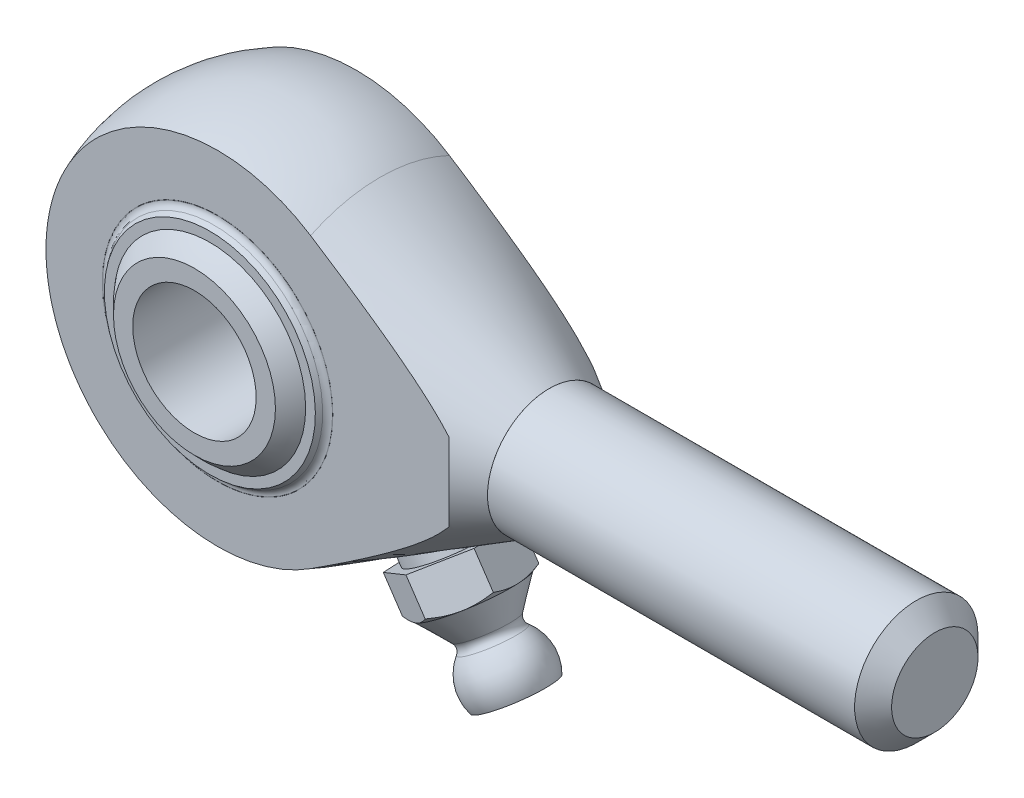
ISO-10303-21;
HEADER;
FILE_DESCRIPTION(('STEP AP214'),'2;1');
FILE_NAME('part.step','',(''),(''),'','','');
FILE_SCHEMA(('AUTOMOTIVE_DESIGN { 1 0 10303 214 1 1 1 1 }'));
ENDSEC;
DATA;
#1=APPLICATION_CONTEXT('core data for automotive mechanical design processes');
#2=APPLICATION_PROTOCOL_DEFINITION('international standard','automotive_design',2000,#1);
#3=PRODUCT_CONTEXT('',#1,'mechanical');
#4=PRODUCT('Part','Part','',(#3));
#5=PRODUCT_RELATED_PRODUCT_CATEGORY('part','',(#4));
#6=PRODUCT_DEFINITION_FORMATION('','',#4);
#7=PRODUCT_DEFINITION_CONTEXT('part definition',#1,'design');
#8=PRODUCT_DEFINITION('design','',#6,#7);
#9=PRODUCT_DEFINITION_SHAPE('','',#8);
#10=(LENGTH_UNIT() NAMED_UNIT(*) SI_UNIT(.MILLI.,.METRE.));
#11=(NAMED_UNIT(*) PLANE_ANGLE_UNIT() SI_UNIT($,.RADIAN.));
#12=(NAMED_UNIT(*) SI_UNIT($,.STERADIAN.) SOLID_ANGLE_UNIT());
#13=UNCERTAINTY_MEASURE_WITH_UNIT(LENGTH_MEASURE(1.E-05),#10,'distance_accuracy_value','');
#14=(GEOMETRIC_REPRESENTATION_CONTEXT(3) GLOBAL_UNCERTAINTY_ASSIGNED_CONTEXT((#13)) GLOBAL_UNIT_ASSIGNED_CONTEXT((#10,
#11,#12)) REPRESENTATION_CONTEXT('',''));
#15=CARTESIAN_POINT('',(0.,0.,0.));
#16=DIRECTION('',(0.,0.,1.));
#17=DIRECTION('',(1.,0.,0.));
#18=AXIS2_PLACEMENT_3D('',#15,#16,#17);
#19=CARTESIAN_POINT('',(-2.58942182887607,-7.9694209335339,1.25233140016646));
#20=DIRECTION('',(0.305622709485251,0.940609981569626,-0.147809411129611));
#21=DIRECTION('',(0.0456756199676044,0.140575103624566,0.989015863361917));
#22=AXIS2_PLACEMENT_3D('',#19,#20,#21);
#23=SPHERICAL_SURFACE('',#22,0.999999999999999);
#24=CARTESIAN_POINT('',(-2.28379911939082,-7.02881095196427,1.10452198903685));
#25=VERTEX_POINT('',#24);
#26=VERTEX_LOOP('',#25);
#27=FACE_BOUND('',#26,.T.);
#28=ADVANCED_FACE('P0_F12',(#27),#23,.T.);
#29=CLOSED_SHELL('',(#28));
#30=MANIFOLD_SOLID_BREP('P0_B1',#29);
#31=CARTESIAN_POINT('',(0.,8.37954506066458,1.25233140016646));
#32=DIRECTION('',(0.,-0.989015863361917,-0.147809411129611));
#33=DIRECTION('',(0.,-0.147809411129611,0.989015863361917));
#34=AXIS2_PLACEMENT_3D('',#31,#32,#33);
#35=SPHERICAL_SURFACE('',#34,0.999999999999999);
#36=CARTESIAN_POINT('',(0.,7.39052919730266,1.10452198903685));
#37=VERTEX_POINT('',#36);
#38=VERTEX_LOOP('',#37);
#39=FACE_BOUND('',#38,.T.);
#40=ADVANCED_FACE('P1_F12',(#39),#35,.T.);
#41=CLOSED_SHELL('',(#40));
#42=MANIFOLD_SOLID_BREP('P1_B1',#41);
#43=CARTESIAN_POINT('',(2.58942182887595,-7.96942093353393,-1.25233140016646));
#44=DIRECTION('',(-0.305622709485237,0.94060998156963,0.147809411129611));
#45=DIRECTION('',(-0.0456756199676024,0.140575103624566,-0.989015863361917));
#46=AXIS2_PLACEMENT_3D('',#43,#44,#45);
#47=SPHERICAL_SURFACE('',#46,0.999999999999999);
#48=CARTESIAN_POINT('',(2.28379911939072,-7.0288109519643,-1.10452198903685));
#49=VERTEX_POINT('',#48);
#50=VERTEX_LOOP('',#49);
#51=FACE_BOUND('',#50,.T.);
#52=ADVANCED_FACE('P2_F12',(#51),#47,.T.);
#53=CLOSED_SHELL('',(#52));
#54=MANIFOLD_SOLID_BREP('P2_B1',#53);
#55=CARTESIAN_POINT('',(0.,0.,0.));
#56=DIRECTION('',(0.,0.,1.));
#57=DIRECTION('',(0.999027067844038,0.044101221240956,0.));
#58=AXIS2_PLACEMENT_3D('',#55,#56,#57);
#59=CYLINDRICAL_SURFACE('',#58,7.47);
#60=CARTESIAN_POINT('',(0.,0.,-4.5));
#61=DIRECTION('',(0.,0.,1.));
#62=DIRECTION('',(0.999027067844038,0.044101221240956,0.));
#63=AXIS2_PLACEMENT_3D('',#60,#61,#62);
#64=CIRCLE('',#63,7.47);
#65=CARTESIAN_POINT('',(7.46273219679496,0.329436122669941,-4.5));
#66=VERTEX_POINT('',#65);
#67=EDGE_CURVE('P3_E34',#66,#66,#64,.T.);
#68=ORIENTED_EDGE('',*,*,#67,.T.);
#69=EDGE_LOOP('',(#68));
#70=FACE_BOUND('',#69,.T.);
#71=CARTESIAN_POINT('',(0.,0.,-4.));
#72=DIRECTION('',(0.,0.,1.));
#73=DIRECTION('',(0.999027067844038,0.044101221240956,0.));
#74=AXIS2_PLACEMENT_3D('',#71,#72,#73);
#75=CIRCLE('',#74,7.47);
#76=CARTESIAN_POINT('',(7.46273219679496,0.329436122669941,-4.));
#77=VERTEX_POINT('',#76);
#78=EDGE_CURVE('P3_E43',#77,#77,#75,.T.);
#79=ORIENTED_EDGE('',*,*,#78,.F.);
#80=EDGE_LOOP('',(#79));
#81=FACE_BOUND('',#80,.T.);
#82=ADVANCED_FACE('P3_F14',(#70,#81),#59,.T.);
#83=CARTESIAN_POINT('',(-0.329436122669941,7.46273219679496,-4.5));
#84=DIRECTION('',(0.,0.,-1.));
#85=DIRECTION('',(-0.999027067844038,-0.044101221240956,0.));
#86=AXIS2_PLACEMENT_3D('',#83,#84,#85);
#87=PLANE('',#86);
#88=CARTESIAN_POINT('',(0.,0.,-4.5));
#89=DIRECTION('',(0.,0.,-1.));
#90=DIRECTION('',(-0.999027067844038,-0.044101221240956,0.));
#91=AXIS2_PLACEMENT_3D('',#88,#89,#90);
#92=CIRCLE('',#91,7.45035024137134);
#93=CARTESIAN_POINT('',(-7.44310155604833,-0.328569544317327,-4.5));
#94=VERTEX_POINT('',#93);
#95=EDGE_CURVE('P3_E21',#94,#94,#92,.F.);
#96=ORIENTED_EDGE('',*,*,#95,.T.);
#97=EDGE_LOOP('',(#96));
#98=FACE_BOUND('',#97,.T.);
#99=ORIENTED_EDGE('',*,*,#67,.F.);
#100=EDGE_LOOP('',(#99));
#101=FACE_BOUND('',#100,.T.);
#102=ADVANCED_FACE('P3_F50',(#98,#101),#87,.T.);
#103=CARTESIAN_POINT('',(0.,0.,0.));
#104=DIRECTION('',(0.,0.,1.));
#105=DIRECTION('',(-0.044101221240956,0.999027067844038,0.));
#106=AXIS2_PLACEMENT_3D('',#103,#104,#105);
#107=SPHERICAL_SURFACE('',#106,8.47260935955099);
#108=CARTESIAN_POINT('',(0.,0.,-4.72137425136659));
#109=DIRECTION('',(0.,0.,1.));
#110=DIRECTION('',(0.999027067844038,0.044101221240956,0.));
#111=AXIS2_PLACEMENT_3D('',#108,#109,#110);
#112=CIRCLE('',#111,7.03517835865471);
#113=CARTESIAN_POINT('',(-0.310259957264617,7.02833360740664,-4.7213742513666));
#114=VERTEX_POINT('',#113);
#115=EDGE_CURVE('P3_E10',#114,#114,#112,.F.);
#116=CARTESIAN_POINT('',(0.,0.,-5.));
#117=DIRECTION('',(0.,0.,1.));
#118=DIRECTION('',(0.999027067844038,0.044101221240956,0.));
#119=AXIS2_PLACEMENT_3D('',#116,#117,#118);
#120=CIRCLE('',#119,6.83996413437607);
#121=CARTESIAN_POINT('',(-0.301650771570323,6.83330931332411,-5.));
#122=VERTEX_POINT('',#121);
#123=EDGE_CURVE('P3_E37',#122,#122,#120,.T.);
#124=CARTESIAN_POINT('',(-0.310259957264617,7.02833360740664,-4.7213742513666));
#125=CARTESIAN_POINT('',(-0.310172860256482,7.02636059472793,-4.72431704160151));
#126=CARTESIAN_POINT('',(-0.31008568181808,7.02438573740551,-4.72725859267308));
#127=CARTESIAN_POINT('',(-0.30991116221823,7.02043233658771,-4.73313921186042));
#128=CARTESIAN_POINT('',(-0.309823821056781,7.01845379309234,-4.7360782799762));
#129=CARTESIAN_POINT('',(-0.309648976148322,7.01449302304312,-4.74195392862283));
#130=CARTESIAN_POINT('',(-0.309561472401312,7.01251079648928,-4.74489050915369));
#131=CARTESIAN_POINT('',(-0.309386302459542,7.00854266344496,-4.75076117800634));
#132=CARTESIAN_POINT('',(-0.309298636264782,7.00655675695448,-4.75369526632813));
#133=CARTESIAN_POINT('',(-0.309123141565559,7.0025812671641,-4.75956094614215));
#134=CARTESIAN_POINT('',(-0.309035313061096,7.00059168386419,-4.76249253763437));
#135=CARTESIAN_POINT('',(-0.308859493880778,6.99660884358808,-4.76835321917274));
#136=CARTESIAN_POINT('',(-0.308771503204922,6.99461558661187,-4.7712823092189));
#137=CARTESIAN_POINT('',(-0.308595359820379,6.990625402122,-4.77713798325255));
#138=CARTESIAN_POINT('',(-0.308507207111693,6.98862847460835,-4.78006456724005));
#139=CARTESIAN_POINT('',(-0.308330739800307,6.98463095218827,-4.78591522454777));
#140=CARTESIAN_POINT('',(-0.308242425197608,6.98263035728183,-4.78883929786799));
#141=CARTESIAN_POINT('',(-0.308065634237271,6.97862550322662,-4.79468492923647));
#142=CARTESIAN_POINT('',(-0.307977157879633,6.97662124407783,-4.79760648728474));
#143=CARTESIAN_POINT('',(-0.307800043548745,6.97260906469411,-4.80344708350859));
#144=CARTESIAN_POINT('',(-0.307711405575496,6.97060114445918,-4.80636612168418));
#145=CARTESIAN_POINT('',(-0.307533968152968,6.96658164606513,-4.81220167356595));
#146=CARTESIAN_POINT('',(-0.30744516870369,6.96457006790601,-4.81511818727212));
#147=CARTESIAN_POINT('',(-0.307267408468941,6.96054325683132,-4.82094868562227));
#148=CARTESIAN_POINT('',(-0.30717844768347,6.95852802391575,-4.82386267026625));
#149=CARTESIAN_POINT('',(-0.307000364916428,6.95449390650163,-4.82968810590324));
#150=CARTESIAN_POINT('',(-0.306911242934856,6.95247502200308,-4.83259955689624));
#151=CARTESIAN_POINT('',(-0.306732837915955,6.94843360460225,-4.83841992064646));
#152=CARTESIAN_POINT('',(-0.306643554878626,6.94641107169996,-4.84132883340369));
#153=CARTESIAN_POINT('',(-0.30646482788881,6.94236236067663,-4.84714411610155));
#154=CARTESIAN_POINT('',(-0.306375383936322,6.94033618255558,-4.85005048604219));
#155=CARTESIAN_POINT('',(-0.30619633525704,6.93628018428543,-4.85586067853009));
#156=CARTESIAN_POINT('',(-0.306106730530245,6.93425036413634,-4.85876450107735));
#157=CARTESIAN_POINT('',(-0.305927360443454,6.93018708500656,-4.86456959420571));
#158=CARTESIAN_POINT('',(-0.305837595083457,6.92815362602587,-4.86747086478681));
#159=CARTESIAN_POINT('',(-0.305657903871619,6.92408307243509,-4.87327084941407));
#160=CARTESIAN_POINT('',(-0.305567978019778,6.922045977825,-4.87616956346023));
#161=CARTESIAN_POINT('',(-0.305387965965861,6.91796815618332,-4.88196443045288));
#162=CARTESIAN_POINT('',(-0.305297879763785,6.91592742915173,-4.88486058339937));
#163=CARTESIAN_POINT('',(-0.305117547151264,6.91184234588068,-4.89065032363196));
#164=CARTESIAN_POINT('',(-0.305027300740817,6.90979798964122,-4.89354391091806));
#165=CARTESIAN_POINT('',(-0.304846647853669,6.90570565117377,-4.89932851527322));
#166=CARTESIAN_POINT('',(-0.304756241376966,6.90365766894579,-4.90221953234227));
#167=CARTESIAN_POINT('',(-0.304575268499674,6.89955808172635,-4.9079989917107));
#168=CARTESIAN_POINT('',(-0.304484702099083,6.89750647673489,-4.91088743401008));
#169=CARTESIAN_POINT('',(-0.304303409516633,6.89339964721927,-4.9166617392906));
#170=CARTESIAN_POINT('',(-0.304212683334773,6.89134442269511,-4.91954760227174));
#171=CARTESIAN_POINT('',(-0.304031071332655,6.88723035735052,-4.92531674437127));
#172=CARTESIAN_POINT('',(-0.303940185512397,6.8851715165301,-4.92820002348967));
#173=CARTESIAN_POINT('',(-0.303758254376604,6.88105022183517,-4.93396399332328));
#174=CARTESIAN_POINT('',(-0.303667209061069,6.87898776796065,-4.93684468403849));
#175=CARTESIAN_POINT('',(-0.303484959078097,6.87485925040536,-4.94260347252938));
#176=CARTESIAN_POINT('',(-0.30339375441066,6.87279318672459,-4.94548157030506));
#177=CARTESIAN_POINT('',(-0.303211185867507,6.86865745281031,-4.9512351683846));
#178=CARTESIAN_POINT('',(-0.303119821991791,6.86658778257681,-4.95411066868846));
#179=CARTESIAN_POINT('',(-0.302936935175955,6.8624448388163,-4.95985906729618));
#180=CARTESIAN_POINT('',(-0.302845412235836,6.86037156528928,-4.96273196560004));
#181=CARTESIAN_POINT('',(-0.302662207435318,6.85622141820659,-4.96847515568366));
#182=CARTESIAN_POINT('',(-0.30257052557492,6.85414454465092,-4.97134544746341));
#183=CARTESIAN_POINT('',(-0.302387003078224,6.84998720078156,-4.9770834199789));
#184=CARTESIAN_POINT('',(-0.302295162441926,6.84790673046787,-4.97995110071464));
#185=CARTESIAN_POINT('',(-0.302111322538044,6.84374219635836,-4.98568384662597));
#186=CARTESIAN_POINT('',(-0.302019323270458,6.84165813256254,-4.98854891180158));
#187=CARTESIAN_POINT('',(-0.301835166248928,6.83748641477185,-4.99427642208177));
#188=CARTESIAN_POINT('',(-0.301743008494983,6.83539876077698,-4.99713886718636));
#189=CARTESIAN_POINT('',(-0.301650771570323,6.83330931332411,-5.));
#190=B_SPLINE_CURVE_WITH_KNOTS('',3,(#124,#125,#126,#127,#128,#129,#130,#131,#132,#133,#134,
#135,#136,#137,#138,#139,#140,#141,#142,#143,#144,#145,#146,#147,#148,#149,#150,#151,#152,#153,
#154,#155,#156,#157,#158,#159,#160,#161,#162,#163,#164,#165,#166,#167,#168,#169,#170,#171,#172,
#173,#174,#175,#176,#177,#178,#179,#180,#181,#182,#183,#184,#185,#186,#187,#188,#189),
.UNSPECIFIED.,.F.,.F.,(4,2,2,2,2,2,2,2,2,2,2,2,2,2,2,2,2,2,2,2,2,2,2,2,2,2,2,2,2,2,2,2,4),(0.,
0.0106321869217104,0.0212643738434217,0.0318965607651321,0.0425287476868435,0.0531609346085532,
0.0637931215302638,0.0744253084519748,0.085057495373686,0.0956896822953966,0.106321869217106,
0.116954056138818,0.127586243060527,0.138218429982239,0.148850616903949,0.15948280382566,
0.170114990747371,0.180747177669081,0.191379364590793,0.202011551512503,0.212643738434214,
0.223275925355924,0.233908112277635,0.244540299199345,0.255172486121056,0.265804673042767,
0.276436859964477,0.287069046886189,0.297701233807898,0.30833342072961,0.31896560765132,
0.329597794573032,0.340229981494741),.UNSPECIFIED.);
#191=EDGE_CURVE('P3_BSEAM57',#114,#122,#190,.T.);
#192=ORIENTED_EDGE('',*,*,#115,.T.);
#193=ORIENTED_EDGE('',*,*,#123,.T.);
#194=ORIENTED_EDGE('',*,*,#191,.T.);
#195=ORIENTED_EDGE('',*,*,#191,.F.);
#196=EDGE_LOOP('',(#192,#194,#193,#195));
#197=FACE_BOUND('',#196,.T.);
#198=ADVANCED_FACE('P3_F57',(#197),#107,.T.);
#199=CARTESIAN_POINT('',(-0.273862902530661,6.20382939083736,-5.));
#200=DIRECTION('',(0.,0.,-1.));
#201=DIRECTION('',(-0.999027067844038,-0.044101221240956,0.));
#202=AXIS2_PLACEMENT_3D('',#199,#200,#201);
#203=PLANE('',#202);
#204=CARTESIAN_POINT('',(0.,0.,-5.));
#205=DIRECTION('',(0.,0.,1.));
#206=DIRECTION('',(0.999027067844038,0.044101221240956,0.));
#207=AXIS2_PLACEMENT_3D('',#204,#205,#206);
#208=CIRCLE('',#207,6.20987117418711);
#209=CARTESIAN_POINT('',(-0.273862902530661,6.20382939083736,-5.));
#210=VERTEX_POINT('',#209);
#211=EDGE_CURVE('P3_E40',#210,#210,#208,.T.);
#212=ORIENTED_EDGE('',*,*,#211,.T.);
#213=EDGE_LOOP('',(#212));
#214=FACE_BOUND('',#213,.T.);
#215=ORIENTED_EDGE('',*,*,#123,.F.);
#216=EDGE_LOOP('',(#215));
#217=FACE_BOUND('',#216,.T.);
#218=ADVANCED_FACE('P3_F77',(#214,#217),#203,.T.);
#219=CARTESIAN_POINT('',(0.,0.,0.));
#220=DIRECTION('',(0.,0.,1.));
#221=DIRECTION('',(-0.044101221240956,0.999027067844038,0.));
#222=AXIS2_PLACEMENT_3D('',#219,#220,#221);
#223=SPHERICAL_SURFACE('',#222,7.97260935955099);
#224=CARTESIAN_POINT('',(0.,0.,-4.23443836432));
#225=DIRECTION('',(0.,0.,1.));
#226=DIRECTION('',(0.999027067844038,0.044101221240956,0.));
#227=AXIS2_PLACEMENT_3D('',#224,#225,#226);
#228=CIRCLE('',#227,6.75514853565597);
#229=CARTESIAN_POINT('',(-0.297910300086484,6.74857623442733,-4.23443836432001));
#230=VERTEX_POINT('',#229);
#231=EDGE_CURVE('P3_E29',#230,#230,#228,.T.);
#232=CARTESIAN_POINT('',(-0.297910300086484,6.74857623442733,-4.23443836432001));
#233=CARTESIAN_POINT('',(-0.297680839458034,6.74337825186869,-4.24273871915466));
#234=CARTESIAN_POINT('',(-0.297450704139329,6.73816498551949,-4.25102948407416));
#235=CARTESIAN_POINT('',(-0.296989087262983,6.72770795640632,-4.26759172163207));
#236=CARTESIAN_POINT('',(-0.296757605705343,6.72246419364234,-4.27586319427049));
#237=CARTESIAN_POINT('',(-0.296293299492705,6.7119462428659,-4.29238673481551));
#238=CARTESIAN_POINT('',(-0.296060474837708,6.70667205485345,-4.3006388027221));
#239=CARTESIAN_POINT('',(-0.295593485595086,6.69609332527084,-4.31712342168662));
#240=CARTESIAN_POINT('',(-0.295359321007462,6.69078878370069,-4.32535597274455));
#241=CARTESIAN_POINT('',(-0.294889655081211,6.68014941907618,-4.3418014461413));
#242=CARTESIAN_POINT('',(-0.294654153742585,6.67481459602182,-4.35001436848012));
#243=CARTESIAN_POINT('',(-0.294181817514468,6.66411474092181,-4.36642047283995));
#244=CARTESIAN_POINT('',(-0.293944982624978,6.65874970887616,-4.37461365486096));
#245=CARTESIAN_POINT('',(-0.293469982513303,6.64798950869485,-4.39098016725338));
#246=CARTESIAN_POINT('',(-0.293231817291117,6.6425943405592,-4.39915349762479));
#247=CARTESIAN_POINT('',(-0.292754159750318,6.63177394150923,-4.41548019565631));
#248=CARTESIAN_POINT('',(-0.292514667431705,6.62634871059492,-4.42363356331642));
#249=CARTESIAN_POINT('',(-0.292034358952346,6.61546825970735,-4.43992022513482));
#250=CARTESIAN_POINT('',(-0.291793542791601,6.61001303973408,-4.4480535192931));
#251=CARTESIAN_POINT('',(-0.291310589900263,6.59907268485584,-4.46429992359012));
#252=CARTESIAN_POINT('',(-0.291068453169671,6.59358754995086,-4.47241303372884));
#253=CARTESIAN_POINT('',(-0.290582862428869,6.58258743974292,-4.48861895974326));
#254=CARTESIAN_POINT('',(-0.290339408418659,6.57707246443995,-4.49671177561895));
#255=CARTESIAN_POINT('',(-0.289851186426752,6.56601274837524,-4.51287700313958));
#256=CARTESIAN_POINT('',(-0.289606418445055,6.5604680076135,-4.52094941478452));
#257=CARTESIAN_POINT('',(-0.289115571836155,6.54934883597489,-4.5370737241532));
#258=CARTESIAN_POINT('',(-0.288869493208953,6.54377440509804,-4.54512562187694));
#259=CARTESIAN_POINT('',(-0.288376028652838,6.53259592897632,-4.56120879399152));
#260=CARTESIAN_POINT('',(-0.288128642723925,6.52699188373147,-4.56924006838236));
#261=CARTESIAN_POINT('',(-0.287632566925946,6.51575425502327,-4.58528188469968));
#262=CARTESIAN_POINT('',(-0.287383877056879,6.51012067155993,-4.59329242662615));
#263=CARTESIAN_POINT('',(-0.286885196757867,6.49882404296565,-4.60929266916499));
#264=CARTESIAN_POINT('',(-0.286635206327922,6.49316099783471,-4.61728236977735));
#265=CARTESIAN_POINT('',(-0.286133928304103,6.48180552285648,-4.6332408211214));
#266=CARTESIAN_POINT('',(-0.285882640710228,6.47611309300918,-4.6412095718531));
#267=CARTESIAN_POINT('',(-0.285378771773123,6.46469892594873,-4.65712601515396));
#268=CARTESIAN_POINT('',(-0.285126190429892,6.45897718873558,-4.66507370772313));
#269=CARTESIAN_POINT('',(-0.284619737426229,6.44750448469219,-4.68094792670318));
#270=CARTESIAN_POINT('',(-0.284365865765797,6.44175351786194,-4.68887445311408));
#271=CARTESIAN_POINT('',(-0.283856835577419,6.43022243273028,-4.70470623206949));
#272=CARTESIAN_POINT('',(-0.283601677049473,6.42444231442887,-4.712611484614));
#273=CARTESIAN_POINT('',(-0.283090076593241,6.41285300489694,-4.7284006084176));
#274=CARTESIAN_POINT('',(-0.282833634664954,6.40704381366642,-4.73628447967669));
#275=CARTESIAN_POINT('',(-0.282319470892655,6.39539643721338,-4.75203073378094));
#276=CARTESIAN_POINT('',(-0.282061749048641,6.38955825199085,-4.75989311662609));
#277=CARTESIAN_POINT('',(-0.281545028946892,6.37785296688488,-4.77559628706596));
#278=CARTESIAN_POINT('',(-0.281286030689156,6.37198586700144,-4.78343707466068));
#279=CARTESIAN_POINT('',(-0.280766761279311,6.36022283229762,-4.79909694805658));
#280=CARTESIAN_POINT('',(-0.280506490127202,6.35432689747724,-4.80691603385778));
#281=CARTESIAN_POINT('',(-0.279984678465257,6.34250627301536,-4.82253239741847));
#282=CARTESIAN_POINT('',(-0.279723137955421,6.33658158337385,-4.83032967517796));
#283=CARTESIAN_POINT('',(-0.279198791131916,6.32470352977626,-4.84590231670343));
#284=CARTESIAN_POINT('',(-0.278935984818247,6.31875016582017,-4.85367768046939));
#285=CARTESIAN_POINT('',(-0.278409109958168,6.3068148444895,-4.86920638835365));
#286=CARTESIAN_POINT('',(-0.278145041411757,6.3008328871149,-4.87695973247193));
#287=CARTESIAN_POINT('',(-0.277615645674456,6.28884046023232,-4.89244429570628));
#288=CARTESIAN_POINT('',(-0.277350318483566,6.28282999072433,-4.90017551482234));
#289=CARTESIAN_POINT('',(-0.276818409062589,6.27078062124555,-4.91561572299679));
#290=CARTESIAN_POINT('',(-0.276551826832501,6.26474172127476,-4.92332471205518));
#291=CARTESIAN_POINT('',(-0.276017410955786,6.25263557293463,-4.93872035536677));
#292=CARTESIAN_POINT('',(-0.275749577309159,6.24656832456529,-4.94640700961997));
#293=CARTESIAN_POINT('',(-0.275212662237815,6.23440556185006,-4.96175787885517));
#294=CARTESIAN_POINT('',(-0.274943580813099,6.22831004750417,-4.96942209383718));
#295=CARTESIAN_POINT('',(-0.274404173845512,6.2160908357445,-4.984727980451));
#296=CARTESIAN_POINT('',(-0.274133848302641,6.20996713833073,-4.9923696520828));
#297=CARTESIAN_POINT('',(-0.273862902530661,6.20382939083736,-5.));
#298=B_SPLINE_CURVE_WITH_KNOTS('',3,(#232,#233,#234,#235,#236,#237,#238,#239,#240,#241,#242,
#243,#244,#245,#246,#247,#248,#249,#250,#251,#252,#253,#254,#255,#256,#257,#258,#259,#260,#261,
#262,#263,#264,#265,#266,#267,#268,#269,#270,#271,#272,#273,#274,#275,#276,#277,#278,#279,#280,
#281,#282,#283,#284,#285,#286,#287,#288,#289,#290,#291,#292,#293,#294,#295,#296,#297),
.UNSPECIFIED.,.F.,.F.,(4,2,2,2,2,2,2,2,2,2,2,2,2,2,2,2,2,2,2,2,2,2,2,2,2,2,2,2,2,2,2,2,4),(0.,
0.0293888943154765,0.0587777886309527,0.0881666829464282,0.117555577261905,0.146944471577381,
0.176333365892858,0.205722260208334,0.235111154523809,0.264500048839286,0.293888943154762,
0.323277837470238,0.352666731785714,0.382055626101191,0.411444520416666,0.440833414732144,
0.470222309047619,0.499611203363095,0.529000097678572,0.558388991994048,0.587777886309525,
0.617166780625,0.646555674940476,0.675944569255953,0.705333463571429,0.734722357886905,
0.764111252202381,0.793500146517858,0.822889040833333,0.85227793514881,0.881666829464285,
0.911055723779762,0.940444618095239),.UNSPECIFIED.);
#299=EDGE_CURVE('P3_BSEAM68',#230,#210,#298,.T.);
#300=ORIENTED_EDGE('',*,*,#231,.T.);
#301=ORIENTED_EDGE('',*,*,#211,.F.);
#302=ORIENTED_EDGE('',*,*,#299,.T.);
#303=ORIENTED_EDGE('',*,*,#299,.F.);
#304=EDGE_LOOP('',(#300,#302,#301,#303));
#305=FACE_BOUND('',#304,.T.);
#306=ADVANCED_FACE('P3_F68',(#305),#223,.F.);
#307=CARTESIAN_POINT('',(-0.329436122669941,7.46273219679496,-4.));
#308=DIRECTION('',(0.,0.,1.));
#309=DIRECTION('',(0.999027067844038,0.044101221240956,0.));
#310=AXIS2_PLACEMENT_3D('',#307,#308,#309);
#311=PLANE('',#310);
#312=CARTESIAN_POINT('',(0.,0.,-4.));
#313=DIRECTION('',(0.,0.,1.));
#314=DIRECTION('',(0.999027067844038,0.044101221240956,0.));
#315=AXIS2_PLACEMENT_3D('',#312,#313,#314);
#316=CIRCLE('',#315,7.17879581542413);
#317=CARTESIAN_POINT('',(7.17181133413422,0.316593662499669,-4.));
#318=VERTEX_POINT('',#317);
#319=EDGE_CURVE('P3_E25',#318,#318,#316,.F.);
#320=ORIENTED_EDGE('',*,*,#319,.T.);
#321=EDGE_LOOP('',(#320));
#322=FACE_BOUND('',#321,.T.);
#323=ORIENTED_EDGE('',*,*,#78,.T.);
#324=EDGE_LOOP('',(#323));
#325=FACE_BOUND('',#324,.T.);
#326=ADVANCED_FACE('P3_F47',(#322,#325),#311,.T.);
#327=CARTESIAN_POINT('',(0.,0.,-4.5));
#328=DIRECTION('',(0.,0.,1.));
#329=DIRECTION('',(0.999027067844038,0.044101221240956,0.));
#330=AXIS2_PLACEMENT_3D('',#327,#328,#329);
#331=TOROIDAL_SURFACE('',#330,7.17879581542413,0.5);
#332=ORIENTED_EDGE('',*,*,#319,.F.);
#333=EDGE_LOOP('',(#332));
#334=FACE_BOUND('',#333,.T.);
#335=ORIENTED_EDGE('',*,*,#231,.F.);
#336=EDGE_LOOP('',(#335));
#337=FACE_BOUND('',#336,.T.);
#338=ADVANCED_FACE('P3_F60',(#334,#337),#331,.T.);
#339=CARTESIAN_POINT('',(0.,0.,-5.));
#340=DIRECTION('',(0.,0.,-1.));
#341=DIRECTION('',(-0.999027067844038,-0.044101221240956,0.));
#342=AXIS2_PLACEMENT_3D('',#339,#340,#341);
#343=TOROIDAL_SURFACE('',#342,7.45035024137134,0.5);
#344=ORIENTED_EDGE('',*,*,#115,.F.);
#345=EDGE_LOOP('',(#344));
#346=FACE_BOUND('',#345,.T.);
#347=ORIENTED_EDGE('',*,*,#95,.F.);
#348=EDGE_LOOP('',(#347));
#349=FACE_BOUND('',#348,.T.);
#350=ADVANCED_FACE('P3_F16',(#346,#349),#343,.F.);
#351=CLOSED_SHELL('',(#82,#102,#198,#218,#306,#326,#338,#350));
#352=MANIFOLD_SOLID_BREP('P3_B1',#351);
#353=CARTESIAN_POINT('',(-4.92537300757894,-6.77919435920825,1.25233140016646));
#354=DIRECTION('',(0.581328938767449,0.800130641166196,-0.147809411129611));
#355=DIRECTION('',(0.0868801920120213,0.119580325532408,0.989015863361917));
#356=AXIS2_PLACEMENT_3D('',#353,#354,#355);
#357=SPHERICAL_SURFACE('',#356,0.999999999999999);
#358=CARTESIAN_POINT('',(-4.34404406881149,-5.97906371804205,1.10452198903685));
#359=VERTEX_POINT('',#358);
#360=VERTEX_LOOP('',#359);
#361=FACE_BOUND('',#360,.T.);
#362=ADVANCED_FACE('P4_F12',(#361),#357,.T.);
#363=CLOSED_SHELL('',(#362));
#364=MANIFOLD_SOLID_BREP('P4_B1',#363);
#365=CARTESIAN_POINT('',(2.58942182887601,7.96942093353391,1.25233140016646));
#366=DIRECTION('',(-0.305622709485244,-0.940609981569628,-0.147809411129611));
#367=DIRECTION('',(-0.0456756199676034,-0.140575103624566,0.989015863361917));
#368=AXIS2_PLACEMENT_3D('',#365,#366,#367);
#369=SPHERICAL_SURFACE('',#368,0.999999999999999);
#370=CARTESIAN_POINT('',(2.28379911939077,7.02881095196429,1.10452198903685));
#371=VERTEX_POINT('',#370);
#372=VERTEX_LOOP('',#371);
#373=FACE_BOUND('',#372,.T.);
#374=ADVANCED_FACE('P5_F12',(#373),#369,.T.);
#375=CLOSED_SHELL('',(#374));
#376=MANIFOLD_SOLID_BREP('P5_B1',#375);
#377=CARTESIAN_POINT('',(0.,-8.37954506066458,-1.25233140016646));
#378=DIRECTION('',(0.,0.989015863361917,0.147809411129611));
#379=DIRECTION('',(0.,0.147809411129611,-0.989015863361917));
#380=AXIS2_PLACEMENT_3D('',#377,#378,#379);
#381=SPHERICAL_SURFACE('',#380,0.999999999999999);
#382=CARTESIAN_POINT('',(0.,-7.39052919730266,-1.10452198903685));
#383=VERTEX_POINT('',#382);
#384=VERTEX_LOOP('',#383);
#385=FACE_BOUND('',#384,.T.);
#386=ADVANCED_FACE('P6_F12',(#385),#381,.T.);
#387=CLOSED_SHELL('',(#386));
#388=MANIFOLD_SOLID_BREP('P6_B1',#387);
#389=CARTESIAN_POINT('',(-6.77919435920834,-4.92537300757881,1.25233140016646));
#390=DIRECTION('',(0.800130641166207,0.581328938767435,-0.147809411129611));
#391=DIRECTION('',(0.11958032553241,0.0868801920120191,0.989015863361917));
#392=AXIS2_PLACEMENT_3D('',#389,#390,#391);
#393=SPHERICAL_SURFACE('',#392,0.999999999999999);
#394=CARTESIAN_POINT('',(-5.97906371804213,-4.34404406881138,1.10452198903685));
#395=VERTEX_POINT('',#394);
#396=VERTEX_LOOP('',#395);
#397=FACE_BOUND('',#396,.T.);
#398=ADVANCED_FACE('P7_F12',(#397),#393,.T.);
#399=CLOSED_SHELL('',(#398));
#400=MANIFOLD_SOLID_BREP('P7_B1',#399);
#401=CARTESIAN_POINT('',(4.92537300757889,6.77919435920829,1.25233140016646));
#402=DIRECTION('',(-0.581328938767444,-0.800130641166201,-0.147809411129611));
#403=DIRECTION('',(-0.0868801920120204,-0.119580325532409,0.989015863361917));
#404=AXIS2_PLACEMENT_3D('',#401,#402,#403);
#405=SPHERICAL_SURFACE('',#404,0.999999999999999);
#406=CARTESIAN_POINT('',(4.34404406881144,5.97906371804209,1.10452198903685));
#407=VERTEX_POINT('',#406);
#408=VERTEX_LOOP('',#407);
#409=FACE_BOUND('',#408,.T.);
#410=ADVANCED_FACE('P8_F12',(#409),#405,.T.);
#411=CLOSED_SHELL('',(#410));
#412=MANIFOLD_SOLID_BREP('P8_B1',#411);
#413=CARTESIAN_POINT('',(-2.58942182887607,-7.9694209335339,-1.25233140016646));
#414=DIRECTION('',(0.305622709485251,0.940609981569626,0.147809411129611));
#415=DIRECTION('',(0.0456756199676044,0.140575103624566,-0.989015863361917));
#416=AXIS2_PLACEMENT_3D('',#413,#414,#415);
#417=SPHERICAL_SURFACE('',#416,0.999999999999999);
#418=CARTESIAN_POINT('',(-2.28379911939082,-7.02881095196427,-1.10452198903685));
#419=VERTEX_POINT('',#418);
#420=VERTEX_LOOP('',#419);
#421=FACE_BOUND('',#420,.T.);
#422=ADVANCED_FACE('P9_F12',(#421),#417,.T.);
#423=CLOSED_SHELL('',(#422));
#424=MANIFOLD_SOLID_BREP('P9_B1',#423);
#425=CARTESIAN_POINT('',(0.,0.,0.));
#426=DIRECTION('',(0.,1.,0.));
#427=DIRECTION('',(1.,0.,0.));
#428=AXIS2_PLACEMENT_3D('',#425,#426,#427);
#429=SPHERICAL_SURFACE('',#428,7.97260935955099);
#430=CARTESIAN_POINT('',(0.,0.,0.));
#431=DIRECTION('',(0.,0.,1.));
#432=DIRECTION('',(1.,0.,0.));
#433=AXIS2_PLACEMENT_3D('',#430,#431,#432);
#434=SPHERICAL_SURFACE('',#433,7.97260935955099);
#435=CARTESIAN_POINT('',(0.,0.,2.00158625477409));
#436=DIRECTION('',(0.,0.,1.));
#437=DIRECTION('',(1.,0.,0.));
#438=AXIS2_PLACEMENT_3D('',#435,#436,#437);
#439=CIRCLE('',#438,7.71726327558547);
#440=CARTESIAN_POINT('',(7.71726327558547,0.,2.00158625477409));
#441=VERTEX_POINT('',#440);
#442=EDGE_CURVE('P10_E18',#441,#441,#439,.F.);
#443=ORIENTED_EDGE('',*,*,#442,.F.);
#444=EDGE_LOOP('',(#443));
#445=FACE_BOUND('',#444,.T.);
#446=CARTESIAN_POINT('',(0.,0.,6.));
#447=DIRECTION('',(0.,0.,-1.));
#448=DIRECTION('',(-1.,0.,0.));
#449=AXIS2_PLACEMENT_3D('',#446,#447,#448);
#450=CIRCLE('',#449,5.25);
#451=CARTESIAN_POINT('',(-5.25,0.,6.));
#452=VERTEX_POINT('',#451);
#453=EDGE_CURVE('P10_E27',#452,#452,#450,.F.);
#454=ORIENTED_EDGE('',*,*,#453,.F.);
#455=EDGE_LOOP('',(#454));
#456=FACE_BOUND('',#455,.T.);
#457=ADVANCED_FACE('P10_F14',(#445,#456),#434,.T.);
#458=CARTESIAN_POINT('',(0.,0.,0.));
#459=DIRECTION('',(0.,0.,-1.));
#460=DIRECTION('',(-1.,0.,0.));
#461=AXIS2_PLACEMENT_3D('',#458,#459,#460);
#462=SPHERICAL_SURFACE('',#461,7.97260935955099);
#463=CARTESIAN_POINT('',(0.,0.,-2.00158625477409));
#464=DIRECTION('',(0.,0.,-1.));
#465=DIRECTION('',(-1.,0.,0.));
#466=AXIS2_PLACEMENT_3D('',#463,#464,#465);
#467=CIRCLE('',#466,7.71726327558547);
#468=CARTESIAN_POINT('',(-7.71726327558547,0.,-2.00158625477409));
#469=VERTEX_POINT('',#468);
#470=EDGE_CURVE('P10_E34',#469,#469,#467,.F.);
#471=ORIENTED_EDGE('',*,*,#470,.F.);
#472=EDGE_LOOP('',(#471));
#473=FACE_BOUND('',#472,.T.);
#474=CARTESIAN_POINT('',(0.,0.,-6.));
#475=DIRECTION('',(0.,0.,1.));
#476=DIRECTION('',(1.,0.,0.));
#477=AXIS2_PLACEMENT_3D('',#474,#475,#476);
#478=CIRCLE('',#477,5.25);
#479=CARTESIAN_POINT('',(5.25,0.,-6.));
#480=VERTEX_POINT('',#479);
#481=EDGE_CURVE('P10_E10',#480,#480,#478,.F.);
#482=ORIENTED_EDGE('',*,*,#481,.F.);
#483=EDGE_LOOP('',(#482));
#484=FACE_BOUND('',#483,.T.);
#485=ADVANCED_FACE('P10_F50',(#473,#484),#462,.T.);
#486=CARTESIAN_POINT('',(0.,0.,0.));
#487=DIRECTION('',(0.,0.,-1.));
#488=DIRECTION('',(-1.,0.,0.));
#489=AXIS2_PLACEMENT_3D('',#486,#487,#488);
#490=SPHERICAL_SURFACE('',#489,7.97260935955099);
#491=CARTESIAN_POINT('',(0.,0.,0.342182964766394));
#492=DIRECTION('',(0.,0.,-1.));
#493=DIRECTION('',(-1.,0.,0.));
#494=AXIS2_PLACEMENT_3D('',#491,#492,#493);
#495=CIRCLE('',#494,7.96526275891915);
#496=CARTESIAN_POINT('',(-7.96526275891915,0.,0.342182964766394));
#497=VERTEX_POINT('',#496);
#498=EDGE_CURVE('P10_E39',#497,#497,#495,.F.);
#499=ORIENTED_EDGE('',*,*,#498,.F.);
#500=EDGE_LOOP('',(#499));
#501=FACE_BOUND('',#500,.T.);
#502=CARTESIAN_POINT('',(0.,0.,-0.342182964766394));
#503=DIRECTION('',(0.,0.,1.));
#504=DIRECTION('',(1.,0.,0.));
#505=AXIS2_PLACEMENT_3D('',#502,#503,#504);
#506=CIRCLE('',#505,7.96526275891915);
#507=CARTESIAN_POINT('',(7.96526275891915,0.,-0.342182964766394));
#508=VERTEX_POINT('',#507);
#509=EDGE_CURVE('P10_E35',#508,#508,#506,.F.);
#510=ORIENTED_EDGE('',*,*,#509,.F.);
#511=EDGE_LOOP('',(#510));
#512=FACE_BOUND('',#511,.T.);
#513=ADVANCED_FACE('P10_F16',(#501,#512),#490,.T.);
#514=CARTESIAN_POINT('',(0.,0.,-7.97260935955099));
#515=DIRECTION('',(0.,0.,1.));
#516=DIRECTION('',(1.,0.,0.));
#517=AXIS2_PLACEMENT_3D('',#514,#515,#516);
#518=CYLINDRICAL_SURFACE('',#517,4.);
#519=CARTESIAN_POINT('',(0.,0.,6.));
#520=DIRECTION('',(0.,0.,-1.));
#521=DIRECTION('',(-1.,0.,0.));
#522=AXIS2_PLACEMENT_3D('',#519,#520,#521);
#523=CIRCLE('',#522,4.);
#524=CARTESIAN_POINT('',(-4.,0.,6.));
#525=VERTEX_POINT('',#524);
#526=EDGE_CURVE('P10_E31',#525,#525,#523,.F.);
#527=ORIENTED_EDGE('',*,*,#526,.T.);
#528=EDGE_LOOP('',(#527));
#529=FACE_BOUND('',#528,.T.);
#530=CARTESIAN_POINT('',(0.,0.,-6.));
#531=DIRECTION('',(0.,0.,1.));
#532=DIRECTION('',(1.,0.,0.));
#533=AXIS2_PLACEMENT_3D('',#530,#531,#532);
#534=CIRCLE('',#533,4.);
#535=CARTESIAN_POINT('',(4.,0.,-6.));
#536=VERTEX_POINT('',#535);
#537=EDGE_CURVE('P10_E22',#536,#536,#534,.F.);
#538=ORIENTED_EDGE('',*,*,#537,.T.);
#539=EDGE_LOOP('',(#538));
#540=FACE_BOUND('',#539,.T.);
#541=ADVANCED_FACE('P10_F62',(#529,#540),#518,.F.);
#542=CARTESIAN_POINT('',(-7.97260935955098,-7.97260935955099,-6.));
#543=DIRECTION('',(0.,0.,1.));
#544=DIRECTION('',(1.,0.,0.));
#545=AXIS2_PLACEMENT_3D('',#542,#543,#544);
#546=PLANE('',#545);
#547=ORIENTED_EDGE('',*,*,#481,.T.);
#548=EDGE_LOOP('',(#547));
#549=FACE_BOUND('',#548,.T.);
#550=ORIENTED_EDGE('',*,*,#537,.F.);
#551=EDGE_LOOP('',(#550));
#552=FACE_BOUND('',#551,.T.);
#553=ADVANCED_FACE('P10_F58',(#549,#552),#546,.F.);
#554=CARTESIAN_POINT('',(-7.97260935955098,-7.97260935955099,6.));
#555=DIRECTION('',(0.,0.,-1.));
#556=DIRECTION('',(-1.,0.,0.));
#557=AXIS2_PLACEMENT_3D('',#554,#555,#556);
#558=PLANE('',#557);
#559=ORIENTED_EDGE('',*,*,#453,.T.);
#560=EDGE_LOOP('',(#559));
#561=FACE_BOUND('',#560,.T.);
#562=ORIENTED_EDGE('',*,*,#526,.F.);
#563=EDGE_LOOP('',(#562));
#564=FACE_BOUND('',#563,.T.);
#565=ADVANCED_FACE('P10_F54',(#561,#564),#558,.F.);
#566=CARTESIAN_POINT('',(0.,0.,-1.25233140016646));
#567=DIRECTION('',(0.,0.,-1.));
#568=DIRECTION('',(-1.,0.,0.));
#569=AXIS2_PLACEMENT_3D('',#566,#567,#568);
#570=TOROIDAL_SURFACE('',#569,8.37954506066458,1.);
#571=ORIENTED_EDGE('',*,*,#470,.T.);
#572=EDGE_LOOP('',(#571));
#573=FACE_BOUND('',#572,.T.);
#574=ORIENTED_EDGE('',*,*,#509,.T.);
#575=EDGE_LOOP('',(#574));
#576=FACE_BOUND('',#575,.T.);
#577=ADVANCED_FACE('P10_F57',(#573,#576),#570,.F.);
#578=CARTESIAN_POINT('',(0.,0.,1.25233140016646));
#579=DIRECTION('',(0.,0.,-1.));
#580=DIRECTION('',(-1.,0.,0.));
#581=AXIS2_PLACEMENT_3D('',#578,#579,#580);
#582=TOROIDAL_SURFACE('',#581,8.37954506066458,1.);
#583=ORIENTED_EDGE('',*,*,#442,.T.);
#584=EDGE_LOOP('',(#583));
#585=FACE_BOUND('',#584,.T.);
#586=ORIENTED_EDGE('',*,*,#498,.T.);
#587=EDGE_LOOP('',(#586));
#588=FACE_BOUND('',#587,.T.);
#589=ADVANCED_FACE('P10_F46',(#585,#588),#582,.F.);
#590=CLOSED_SHELL('',(#457,#485,#513,#541,#553,#565,#577,#589));
#591=MANIFOLD_SOLID_BREP('P10_B1',#590);
#592=CARTESIAN_POINT('',(-7.96942093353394,-2.58942182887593,1.25233140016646));
#593=DIRECTION('',(0.940609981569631,0.305622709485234,-0.147809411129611));
#594=DIRECTION('',(0.140575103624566,0.0456756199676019,0.989015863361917));
#595=AXIS2_PLACEMENT_3D('',#592,#593,#594);
#596=SPHERICAL_SURFACE('',#595,0.999999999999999);
#597=CARTESIAN_POINT('',(-7.02881095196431,-2.28379911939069,1.10452198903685));
#598=VERTEX_POINT('',#597);
#599=VERTEX_LOOP('',#598);
#600=FACE_BOUND('',#599,.T.);
#601=ADVANCED_FACE('P11_F12',(#600),#596,.T.);
#602=CLOSED_SHELL('',(#601));
#603=MANIFOLD_SOLID_BREP('P11_B1',#602);
#604=CARTESIAN_POINT('',(6.7791943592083,4.92537300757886,1.25233140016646));
#605=DIRECTION('',(-0.800130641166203,-0.581328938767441,-0.147809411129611));
#606=DIRECTION('',(-0.119580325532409,-0.08688019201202,0.989015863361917));
#607=AXIS2_PLACEMENT_3D('',#604,#605,#606);
#608=SPHERICAL_SURFACE('',#607,0.999999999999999);
#609=CARTESIAN_POINT('',(5.9790637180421,4.34404406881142,1.10452198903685));
#610=VERTEX_POINT('',#609);
#611=VERTEX_LOOP('',#610);
#612=FACE_BOUND('',#611,.T.);
#613=ADVANCED_FACE('P12_F12',(#612),#608,.T.);
#614=CLOSED_SHELL('',(#613));
#615=MANIFOLD_SOLID_BREP('P12_B1',#614);
#616=CARTESIAN_POINT('',(-4.92537300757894,-6.77919435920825,-1.25233140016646));
#617=DIRECTION('',(0.581328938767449,0.800130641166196,0.147809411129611));
#618=DIRECTION('',(0.0868801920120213,0.119580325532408,-0.989015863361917));
#619=AXIS2_PLACEMENT_3D('',#616,#617,#618);
#620=SPHERICAL_SURFACE('',#619,0.999999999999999);
#621=CARTESIAN_POINT('',(-4.34404406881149,-5.97906371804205,-1.10452198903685));
#622=VERTEX_POINT('',#621);
#623=VERTEX_LOOP('',#622);
#624=FACE_BOUND('',#623,.T.);
#625=ADVANCED_FACE('P13_F12',(#624),#620,.T.);
#626=CLOSED_SHELL('',(#625));
#627=MANIFOLD_SOLID_BREP('P13_B1',#626);
#628=CARTESIAN_POINT('',(0.,8.37954506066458,-1.25233140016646));
#629=DIRECTION('',(0.,-0.989015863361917,0.147809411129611));
#630=DIRECTION('',(0.,-0.147809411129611,-0.989015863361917));
#631=AXIS2_PLACEMENT_3D('',#628,#629,#630);
#632=SPHERICAL_SURFACE('',#631,0.999999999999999);
#633=CARTESIAN_POINT('',(0.,7.39052919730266,-1.10452198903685));
#634=VERTEX_POINT('',#633);
#635=VERTEX_LOOP('',#634);
#636=FACE_BOUND('',#635,.T.);
#637=ADVANCED_FACE('P14_F12',(#636),#632,.T.);
#638=CLOSED_SHELL('',(#637));
#639=MANIFOLD_SOLID_BREP('P14_B1',#638);
#640=CARTESIAN_POINT('',(-8.37954506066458,0.,1.25233140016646));
#641=DIRECTION('',(0.989015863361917,0.,-0.147809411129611));
#642=DIRECTION('',(0.147809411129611,0.,0.989015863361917));
#643=AXIS2_PLACEMENT_3D('',#640,#641,#642);
#644=SPHERICAL_SURFACE('',#643,0.999999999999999);
#645=CARTESIAN_POINT('',(-7.39052919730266,0.,1.10452198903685));
#646=VERTEX_POINT('',#645);
#647=VERTEX_LOOP('',#646);
#648=FACE_BOUND('',#647,.T.);
#649=ADVANCED_FACE('P15_F12',(#648),#644,.T.);
#650=CLOSED_SHELL('',(#649));
#651=MANIFOLD_SOLID_BREP('P15_B1',#650);
#652=CARTESIAN_POINT('',(7.96942093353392,2.58942182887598,1.25233140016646));
#653=DIRECTION('',(-0.940609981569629,-0.305622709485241,-0.147809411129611));
#654=DIRECTION('',(-0.140575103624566,-0.0456756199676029,0.989015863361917));
#655=AXIS2_PLACEMENT_3D('',#652,#653,#654);
#656=SPHERICAL_SURFACE('',#655,0.999999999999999);
#657=CARTESIAN_POINT('',(7.0288109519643,2.28379911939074,1.10452198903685));
#658=VERTEX_POINT('',#657);
#659=VERTEX_LOOP('',#658);
#660=FACE_BOUND('',#659,.T.);
#661=ADVANCED_FACE('P16_F12',(#660),#656,.T.);
#662=CLOSED_SHELL('',(#661));
#663=MANIFOLD_SOLID_BREP('P16_B1',#662);
#664=CARTESIAN_POINT('',(-6.77919435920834,-4.92537300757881,-1.25233140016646));
#665=DIRECTION('',(0.800130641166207,0.581328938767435,0.147809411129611));
#666=DIRECTION('',(0.11958032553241,0.0868801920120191,-0.989015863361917));
#667=AXIS2_PLACEMENT_3D('',#664,#665,#666);
#668=SPHERICAL_SURFACE('',#667,0.999999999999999);
#669=CARTESIAN_POINT('',(-5.97906371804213,-4.34404406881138,-1.10452198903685));
#670=VERTEX_POINT('',#669);
#671=VERTEX_LOOP('',#670);
#672=FACE_BOUND('',#671,.T.);
#673=ADVANCED_FACE('P17_F12',(#672),#668,.T.);
#674=CLOSED_SHELL('',(#673));
#675=MANIFOLD_SOLID_BREP('P17_B1',#674);
#676=CARTESIAN_POINT('',(2.58942182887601,7.96942093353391,-1.25233140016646));
#677=DIRECTION('',(-0.305622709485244,-0.940609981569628,0.147809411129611));
#678=DIRECTION('',(-0.0456756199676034,-0.140575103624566,-0.989015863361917));
#679=AXIS2_PLACEMENT_3D('',#676,#677,#678);
#680=SPHERICAL_SURFACE('',#679,0.999999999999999);
#681=CARTESIAN_POINT('',(2.28379911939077,7.02881095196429,-1.10452198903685));
#682=VERTEX_POINT('',#681);
#683=VERTEX_LOOP('',#682);
#684=FACE_BOUND('',#683,.T.);
#685=ADVANCED_FACE('P18_F12',(#684),#680,.T.);
#686=CLOSED_SHELL('',(#685));
#687=MANIFOLD_SOLID_BREP('P18_B1',#686);
#688=CARTESIAN_POINT('',(-7.96942093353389,2.58942182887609,1.25233140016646));
#689=DIRECTION('',(0.940609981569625,-0.305622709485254,-0.147809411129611));
#690=DIRECTION('',(0.140575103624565,-0.0456756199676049,0.989015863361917));
#691=AXIS2_PLACEMENT_3D('',#688,#689,#690);
#692=SPHERICAL_SURFACE('',#691,0.999999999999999);
#693=CARTESIAN_POINT('',(-7.02881095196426,2.28379911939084,1.10452198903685));
#694=VERTEX_POINT('',#693);
#695=VERTEX_LOOP('',#694);
#696=FACE_BOUND('',#695,.T.);
#697=ADVANCED_FACE('P19_F12',(#696),#692,.T.);
#698=CLOSED_SHELL('',(#697));
#699=MANIFOLD_SOLID_BREP('P19_B1',#698);
#700=CARTESIAN_POINT('',(8.37954506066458,0.,1.25233140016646));
#701=DIRECTION('',(-0.989015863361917,0.,-0.147809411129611));
#702=DIRECTION('',(-0.147809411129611,0.,0.989015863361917));
#703=AXIS2_PLACEMENT_3D('',#700,#701,#702);
#704=SPHERICAL_SURFACE('',#703,0.999999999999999);
#705=CARTESIAN_POINT('',(7.39052919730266,0.,1.10452198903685));
#706=VERTEX_POINT('',#705);
#707=VERTEX_LOOP('',#706);
#708=FACE_BOUND('',#707,.T.);
#709=ADVANCED_FACE('P20_F12',(#708),#704,.T.);
#710=CLOSED_SHELL('',(#709));
#711=MANIFOLD_SOLID_BREP('P20_B1',#710);
#712=CARTESIAN_POINT('',(-7.96942093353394,-2.58942182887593,-1.25233140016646));
#713=DIRECTION('',(0.940609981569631,0.305622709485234,0.147809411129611));
#714=DIRECTION('',(0.140575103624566,0.0456756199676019,-0.989015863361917));
#715=AXIS2_PLACEMENT_3D('',#712,#713,#714);
#716=SPHERICAL_SURFACE('',#715,0.999999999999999);
#717=CARTESIAN_POINT('',(-7.02881095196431,-2.28379911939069,-1.10452198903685));
#718=VERTEX_POINT('',#717);
#719=VERTEX_LOOP('',#718);
#720=FACE_BOUND('',#719,.T.);
#721=ADVANCED_FACE('P21_F12',(#720),#716,.T.);
#722=CLOSED_SHELL('',(#721));
#723=MANIFOLD_SOLID_BREP('P21_B1',#722);
#724=CARTESIAN_POINT('',(4.92537300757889,6.77919435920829,-1.25233140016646));
#725=DIRECTION('',(-0.581328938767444,-0.800130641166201,0.147809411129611));
#726=DIRECTION('',(-0.0868801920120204,-0.119580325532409,-0.989015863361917));
#727=AXIS2_PLACEMENT_3D('',#724,#725,#726);
#728=SPHERICAL_SURFACE('',#727,0.999999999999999);
#729=CARTESIAN_POINT('',(4.34404406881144,5.97906371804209,-1.10452198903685));
#730=VERTEX_POINT('',#729);
#731=VERTEX_LOOP('',#730);
#732=FACE_BOUND('',#731,.T.);
#733=ADVANCED_FACE('P22_F12',(#732),#728,.T.);
#734=CLOSED_SHELL('',(#733));
#735=MANIFOLD_SOLID_BREP('P22_B1',#734);
#736=CARTESIAN_POINT('',(-6.77919435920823,4.92537300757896,1.25233140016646));
#737=DIRECTION('',(0.800130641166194,-0.581328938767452,-0.147809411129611));
#738=DIRECTION('',(0.119580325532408,-0.0868801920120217,0.989015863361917));
#739=AXIS2_PLACEMENT_3D('',#736,#737,#738);
#740=SPHERICAL_SURFACE('',#739,0.999999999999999);
#741=CARTESIAN_POINT('',(-5.97906371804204,4.34404406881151,1.10452198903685));
#742=VERTEX_POINT('',#741);
#743=VERTEX_LOOP('',#742);
#744=FACE_BOUND('',#743,.T.);
#745=ADVANCED_FACE('P23_F12',(#744),#740,.T.);
#746=CLOSED_SHELL('',(#745));
#747=MANIFOLD_SOLID_BREP('P23_B1',#746);
#748=CARTESIAN_POINT('',(7.9694209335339,-2.58942182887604,1.25233140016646));
#749=DIRECTION('',(-0.940609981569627,0.305622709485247,-0.147809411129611));
#750=DIRECTION('',(-0.140575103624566,0.0456756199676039,0.989015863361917));
#751=AXIS2_PLACEMENT_3D('',#748,#749,#750);
#752=SPHERICAL_SURFACE('',#751,0.999999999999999);
#753=CARTESIAN_POINT('',(7.02881095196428,-2.28379911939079,1.10452198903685));
#754=VERTEX_POINT('',#753);
#755=VERTEX_LOOP('',#754);
#756=FACE_BOUND('',#755,.T.);
#757=ADVANCED_FACE('P24_F12',(#756),#752,.T.);
#758=CLOSED_SHELL('',(#757));
#759=MANIFOLD_SOLID_BREP('P24_B1',#758);
#760=CARTESIAN_POINT('',(-8.37954506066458,0.,-1.25233140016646));
#761=DIRECTION('',(0.989015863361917,0.,0.147809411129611));
#762=DIRECTION('',(0.147809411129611,0.,-0.989015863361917));
#763=AXIS2_PLACEMENT_3D('',#760,#761,#762);
#764=SPHERICAL_SURFACE('',#763,0.999999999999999);
#765=CARTESIAN_POINT('',(-7.39052919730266,0.,-1.10452198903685));
#766=VERTEX_POINT('',#765);
#767=VERTEX_LOOP('',#766);
#768=FACE_BOUND('',#767,.T.);
#769=ADVANCED_FACE('P25_F12',(#768),#764,.T.);
#770=CLOSED_SHELL('',(#769));
#771=MANIFOLD_SOLID_BREP('P25_B1',#770);
#772=CARTESIAN_POINT('',(6.7791943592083,4.92537300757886,-1.25233140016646));
#773=DIRECTION('',(-0.800130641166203,-0.581328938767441,0.147809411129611));
#774=DIRECTION('',(-0.119580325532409,-0.08688019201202,-0.989015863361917));
#775=AXIS2_PLACEMENT_3D('',#772,#773,#774);
#776=SPHERICAL_SURFACE('',#775,0.999999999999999);
#777=CARTESIAN_POINT('',(5.9790637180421,4.34404406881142,-1.10452198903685));
#778=VERTEX_POINT('',#777);
#779=VERTEX_LOOP('',#778);
#780=FACE_BOUND('',#779,.T.);
#781=ADVANCED_FACE('P26_F12',(#780),#776,.T.);
#782=CLOSED_SHELL('',(#781));
#783=MANIFOLD_SOLID_BREP('P26_B1',#782);
#784=CARTESIAN_POINT('',(10.6615160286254,-8.0070627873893,0.));
#785=DIRECTION('',(-0.559192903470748,0.829037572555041,0.));
#786=DIRECTION('',(0.291751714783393,0.196789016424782,-0.936031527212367));
#787=AXIS2_PLACEMENT_3D('',#784,#785,#786);
#788=CYLINDRICAL_SURFACE('',#787,2.5);
#789=CARTESIAN_POINT('',(8.70434086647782,-5.10543128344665,0.));
#790=DIRECTION('',(0.559192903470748,-0.829037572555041,0.));
#791=DIRECTION('',(-0.291751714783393,-0.196789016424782,0.936031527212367));
#792=AXIS2_PLACEMENT_3D('',#789,#790,#791);
#793=CIRCLE('',#792,2.5);
#794=CARTESIAN_POINT('',(7.97496157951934,-5.59740382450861,2.34007881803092));
#795=VERTEX_POINT('',#794);
#796=EDGE_CURVE('P27_E207',#795,#795,#793,.T.);
#797=ORIENTED_EDGE('',*,*,#796,.T.);
#798=EDGE_LOOP('',(#797));
#799=FACE_BOUND('',#798,.T.);
#800=CARTESIAN_POINT('',(10.6615160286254,-8.0070627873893,0.));
#801=DIRECTION('',(0.559192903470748,-0.829037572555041,0.));
#802=DIRECTION('',(-0.291751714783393,-0.196789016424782,0.936031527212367));
#803=AXIS2_PLACEMENT_3D('',#800,#801,#802);
#804=CIRCLE('',#803,2.5);
#805=CARTESIAN_POINT('',(9.93213674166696,-8.49903532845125,2.34007881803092));
#806=VERTEX_POINT('',#805);
#807=EDGE_CURVE('P27_E337',#806,#806,#804,.T.);
#808=ORIENTED_EDGE('',*,*,#807,.F.);
#809=EDGE_LOOP('',(#808));
#810=FACE_BOUND('',#809,.T.);
#811=ADVANCED_FACE('P27_F16',(#799,#810),#788,.T.);
#812=CARTESIAN_POINT('',(8.42474441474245,-4.69091249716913,0.));
#813=DIRECTION('',(0.559192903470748,-0.829037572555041,0.));
#814=DIRECTION('',(-0.291751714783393,-0.196789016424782,0.936031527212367));
#815=AXIS2_PLACEMENT_3D('',#812,#813,#814);
#816=PLANE('',#815);
#817=CARTESIAN_POINT('',(8.42474441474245,-4.69091249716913,0.));
#818=DIRECTION('',(0.559192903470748,-0.829037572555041,0.));
#819=DIRECTION('',(-0.291751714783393,-0.196789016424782,0.936031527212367));
#820=AXIS2_PLACEMENT_3D('',#817,#818,#819);
#821=CIRCLE('',#820,2.);
#822=CARTESIAN_POINT('',(7.84124098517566,-5.0844905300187,1.87206305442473));
#823=VERTEX_POINT('',#822);
#824=EDGE_CURVE('P27_E205',#823,#823,#821,.F.);
#825=ORIENTED_EDGE('',*,*,#824,.T.);
#826=EDGE_LOOP('',(#825));
#827=FACE_BOUND('',#826,.T.);
#828=CARTESIAN_POINT('',(8.42474441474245,-4.69091249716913,0.));
#829=DIRECTION('',(0.559192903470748,-0.829037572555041,0.));
#830=DIRECTION('',(-0.291751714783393,-0.196789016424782,0.936031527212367));
#831=AXIS2_PLACEMENT_3D('',#828,#829,#830);
#832=CIRCLE('',#831,1.);
#833=CARTESIAN_POINT('',(8.13299269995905,-4.88770151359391,0.936031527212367));
#834=VERTEX_POINT('',#833);
#835=EDGE_CURVE('P27_E280',#834,#834,#832,.T.);
#836=ORIENTED_EDGE('',*,*,#835,.T.);
#837=EDGE_LOOP('',(#836));
#838=FACE_BOUND('',#837,.T.);
#839=ADVANCED_FACE('P27_F180',(#827,#838),#816,.F.);
#840=CARTESIAN_POINT('',(8.44218026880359,-9.5040236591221,2.19855792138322));
#841=DIRECTION('',(0.559192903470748,-0.829037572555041,0.));
#842=DIRECTION('',(-0.291751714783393,-0.196789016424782,0.936031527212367));
#843=AXIS2_PLACEMENT_3D('',#840,#841,#842);
#844=PLANE('',#843);
#845=DIRECTION('',(-0.776005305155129,-0.523422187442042,-0.351916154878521));
#846=VECTOR('',#845,1.);
#847=CARTESIAN_POINT('',(11.1303414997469,-7.69083601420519,3.41763124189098));
#848=LINE('',#847,#846);
#849=CARTESIAN_POINT('',(11.1303414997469,-7.69083601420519,3.41763124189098));
#850=VERTEX_POINT('',#849);
#851=CARTESIAN_POINT('',(8.44218026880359,-9.5040236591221,2.19855792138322));
#852=VERTEX_POINT('',#851);
#853=EDGE_CURVE('P27_E314',#850,#852,#848,.T.);
#854=ORIENTED_EDGE('',*,*,#853,.F.);
#855=DIRECTION('',(-0.640667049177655,-0.432135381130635,0.634669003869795));
#856=VECTOR('',#855,1.);
#857=CARTESIAN_POINT('',(13.3496772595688,-6.19387514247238,1.21907332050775));
#858=LINE('',#857,#856);
#859=CARTESIAN_POINT('',(13.3496772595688,-6.19387514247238,1.21907332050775));
#860=VERTEX_POINT('',#859);
#861=EDGE_CURVE('P27_E347',#860,#850,#858,.T.);
#862=ORIENTED_EDGE('',*,*,#861,.F.);
#863=DIRECTION('',(0.135338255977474,0.091286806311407,0.986585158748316));
#864=VECTOR('',#863,1.);
#865=CARTESIAN_POINT('',(12.8808517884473,-6.5101019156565,-2.19855792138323));
#866=LINE('',#865,#864);
#867=CARTESIAN_POINT('',(12.8808517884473,-6.5101019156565,-2.19855792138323));
#868=VERTEX_POINT('',#867);
#869=EDGE_CURVE('P27_E349',#868,#860,#866,.T.);
#870=ORIENTED_EDGE('',*,*,#869,.F.);
#871=DIRECTION('',(0.776005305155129,0.523422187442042,0.351916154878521));
#872=VECTOR('',#871,1.);
#873=CARTESIAN_POINT('',(10.1926905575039,-8.32328956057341,-3.41763124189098));
#874=LINE('',#873,#872);
#875=CARTESIAN_POINT('',(10.1926905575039,-8.32328956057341,-3.41763124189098));
#876=VERTEX_POINT('',#875);
#877=EDGE_CURVE('P27_E352',#876,#868,#874,.T.);
#878=ORIENTED_EDGE('',*,*,#877,.F.);
#879=DIRECTION('',(0.640667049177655,0.432135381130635,-0.634669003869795));
#880=VECTOR('',#879,1.);
#881=CARTESIAN_POINT('',(7.97335479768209,-9.82025043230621,-1.21907332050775));
#882=LINE('',#881,#880);
#883=CARTESIAN_POINT('',(7.97335479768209,-9.82025043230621,-1.21907332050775));
#884=VERTEX_POINT('',#883);
#885=EDGE_CURVE('P27_E354',#884,#876,#882,.T.);
#886=ORIENTED_EDGE('',*,*,#885,.F.);
#887=DIRECTION('',(-0.135338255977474,-0.091286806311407,-0.986585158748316));
#888=VECTOR('',#887,1.);
#889=CARTESIAN_POINT('',(8.44218026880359,-9.5040236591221,2.19855792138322));
#890=LINE('',#889,#888);
#891=EDGE_CURVE('P27_E355',#852,#884,#890,.T.);
#892=ORIENTED_EDGE('',*,*,#891,.F.);
#893=EDGE_LOOP('',(#854,#862,#870,#878,#886,#892));
#894=FACE_BOUND('',#893,.T.);
#895=ORIENTED_EDGE('',*,*,#807,.T.);
#896=EDGE_LOOP('',(#895));
#897=FACE_BOUND('',#896,.T.);
#898=ADVANCED_FACE('P27_F147',(#894,#897),#844,.F.);
#899=CARTESIAN_POINT('',(12.5283237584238,-9.76342994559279,3.41763124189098));
#900=DIRECTION('',(0.291751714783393,0.196789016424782,-0.936031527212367));
#901=DIRECTION('',(0.559192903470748,-0.829037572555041,0.));
#902=AXIS2_PLACEMENT_3D('',#899,#900,#901);
#903=PLANE('',#902);
#904=DIRECTION('',(-0.559192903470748,0.829037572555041,0.));
#905=VECTOR('',#904,1.);
#906=CARTESIAN_POINT('',(9.84016252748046,-11.5766175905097,2.19855792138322));
#907=LINE('',#906,#905);
#908=CARTESIAN_POINT('',(9.69032724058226,-11.3544776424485,2.19855792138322));
#909=VERTEX_POINT('',#908);
#910=EDGE_CURVE('P27_E300',#909,#852,#907,.T.);
#911=ORIENTED_EDGE('',*,*,#910,.F.);
#912=CARTESIAN_POINT('',(13.9883286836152,-6.99821898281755,4.45405155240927));
#913=CARTESIAN_POINT('',(13.9221325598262,-7.11978912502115,4.40786026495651));
#914=CARTESIAN_POINT('',(13.8553666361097,-7.24101452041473,4.36156385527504));
#915=CARTESIAN_POINT('',(13.7203821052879,-7.48257745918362,4.26870490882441));
#916=CARTESIAN_POINT('',(13.6521632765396,-7.60291486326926,4.22214233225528));
#917=CARTESIAN_POINT('',(13.513610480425,-7.84310657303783,4.12845947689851));
#918=CARTESIAN_POINT('',(13.4432671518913,-7.96295485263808,4.08133754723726));
#919=CARTESIAN_POINT('',(13.3004049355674,-8.2011947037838,3.98672184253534));
#920=CARTESIAN_POINT('',(13.2278861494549,-8.31958634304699,3.93922808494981));
#921=CARTESIAN_POINT('',(13.0777452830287,-8.55831722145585,3.84224046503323));
#922=CARTESIAN_POINT('',(13.0000339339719,-8.67859456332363,3.79273179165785));
#923=CARTESIAN_POINT('',(12.8409933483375,-8.91652515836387,3.69313846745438));
#924=CARTESIAN_POINT('',(12.7596637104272,-9.03417811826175,3.64305375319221));
#925=CARTESIAN_POINT('',(12.5926573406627,-9.26572541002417,3.5423195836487));
#926=CARTESIAN_POINT('',(12.5069897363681,-9.37962686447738,3.49167147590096));
#927=CARTESIAN_POINT('',(12.3301252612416,-9.60268763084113,3.3896488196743));
#928=CARTESIAN_POINT('',(12.2389301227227,-9.71184841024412,3.33827450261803));
#929=CARTESIAN_POINT('',(12.0503972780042,-9.92332534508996,3.23505028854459));
#930=CARTESIAN_POINT('',(11.9530963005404,-10.0256759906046,3.18320458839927));
#931=CARTESIAN_POINT('',(11.7510027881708,-10.2223796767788,3.0788595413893));
#932=CARTESIAN_POINT('',(11.6462110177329,-10.3167335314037,3.0263602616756));
#933=CARTESIAN_POINT('',(11.4302162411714,-10.4945180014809,2.92165985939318));
#934=CARTESIAN_POINT('',(11.3191169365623,-10.5780771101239,2.86946404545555));
#935=CARTESIAN_POINT('',(11.0896931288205,-10.7346144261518,2.76504489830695));
#936=CARTESIAN_POINT('',(10.9713684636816,-10.8075923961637,2.71282156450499));
#937=CARTESIAN_POINT('',(10.7652566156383,-10.9224578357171,2.62442951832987));
#938=CARTESIAN_POINT('',(10.6790174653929,-10.9670855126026,2.58816721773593));
#939=CARTESIAN_POINT('',(10.5040440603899,-11.0513989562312,2.51590389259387));
#940=CARTESIAN_POINT('',(10.4153094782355,-11.0910840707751,2.47990290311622));
#941=CARTESIAN_POINT('',(10.1459663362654,-11.2033768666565,2.37234315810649));
#942=CARTESIAN_POINT('',(9.9623077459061,-11.2691735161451,2.30126567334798));
#943=CARTESIAN_POINT('',(9.68108772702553,-11.3579407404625,2.19494998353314));
#944=CARTESIAN_POINT('',(9.58528620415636,-11.3861326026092,2.15916261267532));
#945=CARTESIAN_POINT('',(9.3926740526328,-11.4393666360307,2.08793552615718));
#946=CARTESIAN_POINT('',(9.29586341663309,-11.4644087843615,2.0524958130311));
#947=CARTESIAN_POINT('',(9.1015094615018,-11.5118070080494,1.98195273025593));
#948=CARTESIAN_POINT('',(9.00396637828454,-11.5341639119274,1.94684925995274));
#949=CARTESIAN_POINT('',(8.80828913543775,-11.5766119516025,1.87693443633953));
#950=CARTESIAN_POINT('',(8.71015498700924,-11.596703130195,1.84212307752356));
#951=CARTESIAN_POINT('',(8.45478025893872,-11.6463831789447,1.75208070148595));
#952=CARTESIAN_POINT('',(8.29718229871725,-11.6744931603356,1.69704921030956));
#953=CARTESIAN_POINT('',(7.98117608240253,-11.7269772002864,1.58751909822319));
#954=CARTESIAN_POINT('',(7.82276775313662,-11.7513509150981,1.53302052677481));
#955=CARTESIAN_POINT('',(7.50533976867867,-11.7971998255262,1.42444221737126));
#956=CARTESIAN_POINT('',(7.34631994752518,-11.8186741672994,1.3703626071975));
#957=CARTESIAN_POINT('',(7.02786694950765,-11.8593333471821,1.26255588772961));
#958=CARTESIAN_POINT('',(6.86843376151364,-11.8785181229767,1.20882878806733));
#959=CARTESIAN_POINT('',(6.38924046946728,-11.9334157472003,1.04792746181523));
#960=CARTESIAN_POINT('',(6.06902608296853,-11.9664113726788,0.941182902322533));
#961=CARTESIAN_POINT('',(5.42796001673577,-12.0276742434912,0.728489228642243));
#962=CARTESIAN_POINT('',(5.10710845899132,-12.0559423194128,0.622539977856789));
#963=CARTESIAN_POINT('',(4.49664913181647,-12.1065852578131,0.421618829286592));
#964=CARTESIAN_POINT('',(4.20708341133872,-12.129266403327,0.326595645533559));
#965=CARTESIAN_POINT('',(3.62768318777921,-12.172674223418,0.136876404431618));
#966=CARTESIAN_POINT('',(3.33784867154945,-12.193400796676,0.0421803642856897));
#967=CARTESIAN_POINT('',(2.75887572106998,-12.2333204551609,-0.146672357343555));
#968=CARTESIAN_POINT('',(2.46973784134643,-12.2525180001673,-0.240829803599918));
#969=CARTESIAN_POINT('',(1.89134326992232,-12.2897610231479,-0.428939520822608));
#970=CARTESIAN_POINT('',(1.60208658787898,-12.3078065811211,-0.522891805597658));
#971=CARTESIAN_POINT('',(1.31278200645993,-12.3254333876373,-0.616770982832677));
#972=B_SPLINE_CURVE_WITH_KNOTS('',3,(#912,#913,#914,#915,#916,#917,#918,#919,#920,#921,#922,
#923,#924,#925,#926,#927,#928,#929,#930,#931,#932,#933,#934,#935,#936,#937,#938,#939,#940,#941,
#942,#943,#944,#945,#946,#947,#948,#949,#950,#951,#952,#953,#954,#955,#956,#957,#958,#959,#960,
#961,#962,#963,#964,#965,#966,#967,#968,#969,#970,#971),.UNSPECIFIED.,.F.,.F.,(4,2,2,2,2,2,2,2,
2,2,2,2,2,2,2,2,2,2,2,2,2,2,2,2,2,2,2,2,2,4),(0.,0.437788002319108,0.875643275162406,
1.31584036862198,1.75601691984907,2.2105101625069,2.66505394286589,3.11867812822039,
3.5721608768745,4.02313767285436,4.47406851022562,4.91900709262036,5.36395565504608,
5.67476198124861,5.98560927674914,6.6076280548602,6.92584727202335,7.24406880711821,
7.56219190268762,7.88030898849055,8.38808558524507,8.89590887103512,9.40388138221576,
9.91186771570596,10.9292445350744,11.946442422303,12.8632373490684,13.7800797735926,
14.6941418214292,15.608140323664),.UNSPECIFIED.);
#973=CARTESIAN_POINT('',(11.1842431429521,-10.6700237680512,2.8080945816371));
#974=VERTEX_POINT('',#973);
#975=EDGE_CURVE('P27_E119',#909,#974,#972,.F.);
#976=ORIENTED_EDGE('',*,*,#975,.T.);
#977=CARTESIAN_POINT('',(12.3784884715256,-9.54128999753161,3.41763124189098));
#978=VERTEX_POINT('',#977);
#979=EDGE_CURVE('P27_E127',#974,#978,#972,.F.);
#980=ORIENTED_EDGE('',*,*,#979,.T.);
#981=DIRECTION('',(-0.559192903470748,0.829037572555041,0.));
#982=VECTOR('',#981,1.);
#983=CARTESIAN_POINT('',(12.5283237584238,-9.76342994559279,3.41763124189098));
#984=LINE('',#983,#982);
#985=EDGE_CURVE('P27_E292',#978,#850,#984,.T.);
#986=ORIENTED_EDGE('',*,*,#985,.T.);
#987=ORIENTED_EDGE('',*,*,#853,.T.);
#988=EDGE_LOOP('',(#911,#976,#980,#986,#987));
#989=FACE_BOUND('',#988,.T.);
#990=ADVANCED_FACE('P27_F298',(#989),#903,.F.);
#991=CARTESIAN_POINT('',(9.84016252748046,-11.5766175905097,2.19855792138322));
#992=DIRECTION('',(0.817916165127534,0.551691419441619,-0.163247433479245));
#993=DIRECTION('',(0.135338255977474,0.091286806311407,0.986585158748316));
#994=AXIS2_PLACEMENT_3D('',#991,#992,#993);
#995=PLANE('',#994);
#996=DIRECTION('',(-0.559192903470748,0.829037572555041,0.));
#997=VECTOR('',#996,1.);
#998=CARTESIAN_POINT('',(9.37133705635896,-11.8928443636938,-1.21907332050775));
#999=LINE('',#998,#997);
#1000=CARTESIAN_POINT('',(9.22150176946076,-11.6707044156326,-1.21907332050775));
#1001=VERTEX_POINT('',#1000);
#1002=EDGE_CURVE('P27_E308',#1001,#884,#999,.T.);
#1003=ORIENTED_EDGE('',*,*,#1002,.F.);
#1004=CARTESIAN_POINT('',(9.22143323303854,-11.6706702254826,-1.21930116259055));
#1005=CARTESIAN_POINT('',(9.26661912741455,-11.6932198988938,-1.06911312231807));
#1006=CARTESIAN_POINT('',(9.30975725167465,-11.7123500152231,-0.917628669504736));
#1007=CARTESIAN_POINT('',(9.390703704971,-11.7419322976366,-0.612036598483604));
#1008=CARTESIAN_POINT('',(9.4284989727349,-11.7523634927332,-0.457923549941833));
#1009=CARTESIAN_POINT('',(9.49644400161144,-11.7624561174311,-0.151607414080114));
#1010=CARTESIAN_POINT('',(9.52675983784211,-11.762377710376,0.000548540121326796));
#1011=CARTESIAN_POINT('',(9.57987688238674,-11.7508681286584,0.305576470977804));
#1012=CARTESIAN_POINT('',(9.60268727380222,-11.7394508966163,0.458447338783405));
#1013=CARTESIAN_POINT('',(9.63804726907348,-11.7073485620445,0.744100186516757));
#1014=CARTESIAN_POINT('',(9.65154200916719,-11.6880520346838,0.876924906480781));
#1015=CARTESIAN_POINT('',(9.67288557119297,-11.6413446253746,1.14170898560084));
#1016=CARTESIAN_POINT('',(9.68072914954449,-11.61392624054,1.27366742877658));
#1017=CARTESIAN_POINT('',(9.69148157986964,-11.5513552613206,1.53899753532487));
#1018=CARTESIAN_POINT('',(9.69427710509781,-11.5160445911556,1.67233561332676));
#1019=CARTESIAN_POINT('',(9.69541752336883,-11.439413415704,1.93702295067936));
#1020=CARTESIAN_POINT('',(9.69377114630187,-11.3981048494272,2.06837560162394));
#1021=CARTESIAN_POINT('',(9.69032121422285,-11.3544012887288,2.19878576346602));
#1022=B_SPLINE_CURVE_WITH_KNOTS('',3,(#1004,#1005,#1006,#1007,#1008,#1009,#1010,#1011,#1012,
#1013,#1014,#1015,#1016,#1017,#1018,#1019,#1020,#1021),.UNSPECIFIED.,.F.,.F.,(4,2,2,2,2,2,2,2,
4),(0.,0.47553983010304,0.952222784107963,1.41710776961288,1.88142182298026,2.28572436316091,
2.69040156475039,3.10405572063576,3.5168974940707),.UNSPECIFIED.);
#1023=CARTESIAN_POINT('',(9.60574979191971,-11.7347309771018,0.489742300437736));
#1024=VERTEX_POINT('',#1023);
#1025=EDGE_CURVE('P27_E105',#1001,#1024,#1022,.T.);
#1026=ORIENTED_EDGE('',*,*,#1025,.T.);
#1027=EDGE_CURVE('P27_E116',#1024,#909,#1022,.T.);
#1028=ORIENTED_EDGE('',*,*,#1027,.T.);
#1029=ORIENTED_EDGE('',*,*,#910,.T.);
#1030=ORIENTED_EDGE('',*,*,#891,.T.);
#1031=EDGE_LOOP('',(#1003,#1026,#1028,#1029,#1030));
#1032=FACE_BOUND('',#1031,.T.);
#1033=ADVANCED_FACE('P27_F305',(#1032),#995,.F.);
#1034=CARTESIAN_POINT('',(9.37133705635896,-11.8928443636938,-1.21907332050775));
#1035=DIRECTION('',(0.52616445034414,0.354902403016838,0.772784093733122));
#1036=DIRECTION('',(-0.640667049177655,-0.432135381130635,0.634669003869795));
#1037=AXIS2_PLACEMENT_3D('',#1034,#1035,#1036);
#1038=PLANE('',#1037);
#1039=DIRECTION('',(-0.559192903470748,0.829037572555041,0.));
#1040=VECTOR('',#1039,1.);
#1041=CARTESIAN_POINT('',(11.5906728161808,-10.395883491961,-3.41763124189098));
#1042=LINE('',#1041,#1040);
#1043=CARTESIAN_POINT('',(11.4408375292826,-10.1737435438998,-3.41763124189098));
#1044=VERTEX_POINT('',#1043);
#1045=EDGE_CURVE('P27_E341',#1044,#876,#1042,.T.);
#1046=ORIENTED_EDGE('',*,*,#1045,.F.);
#1047=CARTESIAN_POINT('',(11.4409482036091,-10.1735884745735,-3.41777781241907));
#1048=CARTESIAN_POINT('',(11.3680026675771,-10.2758188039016,-3.32116203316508));
#1049=CARTESIAN_POINT('',(11.2919896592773,-10.3753173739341,-3.22371227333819));
#1050=CARTESIAN_POINT('',(11.1325705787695,-10.5670282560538,-3.0271252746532));
#1051=CARTESIAN_POINT('',(11.0491471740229,-10.6592224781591,-2.92798454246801));
#1052=CARTESIAN_POINT('',(10.8761571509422,-10.831827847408,-2.73093175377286));
#1053=CARTESIAN_POINT('',(10.7867936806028,-10.9124741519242,-2.63305001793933));
#1054=CARTESIAN_POINT('',(10.5999889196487,-11.0627938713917,-2.43682592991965));
#1055=CARTESIAN_POINT('',(10.5025576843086,-11.1324806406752,-2.33848429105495));
#1056=CARTESIAN_POINT('',(10.3132354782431,-11.2519283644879,-2.15472416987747));
#1057=CARTESIAN_POINT('',(10.2222560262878,-11.3031005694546,-2.06927819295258));
#1058=CARTESIAN_POINT('',(10.0353318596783,-11.3968715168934,-1.89894292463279));
#1059=CARTESIAN_POINT('',(9.93938262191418,-11.4394622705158,-1.81405422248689));
#1060=CARTESIAN_POINT('',(9.74143784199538,-11.5176593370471,-1.64336769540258));
#1061=CARTESIAN_POINT('',(9.63935538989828,-11.5530897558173,-1.5575914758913));
#1062=CARTESIAN_POINT('',(9.43230417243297,-11.6168856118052,-1.38731844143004));
#1063=CARTESIAN_POINT('',(9.32734146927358,-11.6452647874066,-1.30281944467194));
#1064=CARTESIAN_POINT('',(9.22131653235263,-11.6707489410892,-1.21892674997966));
#1065=B_SPLINE_CURVE_WITH_KNOTS('',3,(#1047,#1048,#1049,#1050,#1051,#1052,#1053,#1054,#1055,
#1056,#1057,#1058,#1059,#1060,#1061,#1062,#1063,#1064),.UNSPECIFIED.,.F.,.F.,(4,2,2,2,2,2,2,2,
4),(0.,0.47553983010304,0.952222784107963,1.41710776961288,1.88142182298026,2.28572436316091,
2.69040156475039,3.10405572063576,3.5168974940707),.UNSPECIFIED.);
#1066=CARTESIAN_POINT('',(10.4810049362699,-11.1443639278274,-2.31835228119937));
#1067=VERTEX_POINT('',#1066);
#1068=EDGE_CURVE('P27_E100',#1044,#1067,#1065,.T.);
#1069=ORIENTED_EDGE('',*,*,#1068,.T.);
#1070=EDGE_CURVE('P27_E104',#1067,#1001,#1065,.T.);
#1071=ORIENTED_EDGE('',*,*,#1070,.T.);
#1072=ORIENTED_EDGE('',*,*,#1002,.T.);
#1073=ORIENTED_EDGE('',*,*,#885,.T.);
#1074=EDGE_LOOP('',(#1046,#1069,#1071,#1072,#1073));
#1075=FACE_BOUND('',#1074,.T.);
#1076=ADVANCED_FACE('P27_F312',(#1075),#1038,.F.);
#1077=CARTESIAN_POINT('',(11.5906728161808,-10.395883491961,-3.41763124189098));
#1078=DIRECTION('',(-0.291751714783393,-0.196789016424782,0.936031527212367));
#1079=DIRECTION('',(-0.776005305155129,-0.523422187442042,-0.351916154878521));
#1080=AXIS2_PLACEMENT_3D('',#1077,#1078,#1079);
#1081=PLANE('',#1080);
#1082=DIRECTION('',(-0.559192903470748,0.829037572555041,0.));
#1083=VECTOR('',#1082,1.);
#1084=CARTESIAN_POINT('',(14.2788340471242,-8.5826958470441,-2.19855792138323));
#1085=LINE('',#1084,#1083);
#1086=CARTESIAN_POINT('',(14.128998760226,-8.36055589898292,-2.19855792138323));
#1087=VERTEX_POINT('',#1086);
#1088=EDGE_CURVE('P27_E115',#1087,#868,#1085,.T.);
#1089=ORIENTED_EDGE('',*,*,#1088,.F.);
#1090=CARTESIAN_POINT('',(15.7388389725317,-5.81748488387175,-1.16213761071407));
#1091=CARTESIAN_POINT('',(15.6726428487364,-5.93905502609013,-1.2083288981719));
#1092=CARTESIAN_POINT('',(15.6058769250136,-6.06028042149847,-1.25462530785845));
#1093=CARTESIAN_POINT('',(15.4708923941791,-6.30184336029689,-1.34748425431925));
#1094=CARTESIAN_POINT('',(15.4026735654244,-6.42218076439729,-1.39404683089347));
#1095=CARTESIAN_POINT('',(15.2641207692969,-6.66237247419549,-1.48772968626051));
#1096=CARTESIAN_POINT('',(15.1937774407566,-6.78222075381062,-1.53485161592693));
#1097=CARTESIAN_POINT('',(15.0509152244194,-7.02046060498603,-1.62946732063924));
#1098=CARTESIAN_POINT('',(14.9783964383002,-7.13885224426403,-1.67696107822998));
#1099=CARTESIAN_POINT('',(14.8282555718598,-7.37758312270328,-1.77394869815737));
#1100=CARTESIAN_POINT('',(14.7505442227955,-7.49786046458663,-1.82345737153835));
#1101=CARTESIAN_POINT('',(14.5915036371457,-7.73579105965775,-1.92305069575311));
#1102=CARTESIAN_POINT('',(14.5101739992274,-7.85344401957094,-1.97313541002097));
#1103=CARTESIAN_POINT('',(14.3431676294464,-8.08499131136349,-2.07386957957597));
#1104=CARTESIAN_POINT('',(14.2575000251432,-8.1988927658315,-2.12451768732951));
#1105=CARTESIAN_POINT('',(14.0806355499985,-8.4219535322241,-2.22654034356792));
#1106=CARTESIAN_POINT('',(13.9894404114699,-8.53111431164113,-2.27791466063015));
#1107=CARTESIAN_POINT('',(13.8009075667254,-8.74259124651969,-2.38113887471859));
#1108=CARTESIAN_POINT('',(13.7036065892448,-8.84494189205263,-2.43298457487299));
#1109=CARTESIAN_POINT('',(13.501513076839,-9.04164557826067,-2.53732962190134));
#1110=CARTESIAN_POINT('',(13.3967213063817,-9.13599943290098,-2.58982890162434));
#1111=CARTESIAN_POINT('',(13.1807265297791,-9.31378390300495,-2.6945293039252));
#1112=CARTESIAN_POINT('',(13.0696272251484,-9.39734301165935,-2.74672511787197));
#1113=CARTESIAN_POINT('',(12.8402034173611,-9.55388032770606,-2.85114426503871));
#1114=CARTESIAN_POINT('',(12.7218787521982,-9.62685829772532,-2.90336759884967));
#1115=CARTESIAN_POINT('',(12.5157669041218,-9.74172373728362,-2.99175964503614));
#1116=CARTESIAN_POINT('',(12.4295277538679,-9.78635141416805,-3.02802194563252));
#1117=CARTESIAN_POINT('',(12.2545543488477,-9.87066485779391,-3.10028527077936));
#1118=CARTESIAN_POINT('',(12.1658197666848,-9.91034997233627,-3.13628626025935));
#1119=CARTESIAN_POINT('',(11.8964766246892,-10.0226427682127,-3.24384600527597));
#1120=CARTESIAN_POINT('',(11.7128180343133,-10.0884394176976,-3.31492349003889));
#1121=CARTESIAN_POINT('',(11.4315980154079,-10.1772066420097,-3.42123917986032));
#1122=CARTESIAN_POINT('',(11.3357964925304,-10.2053985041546,-3.45702655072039));
#1123=CARTESIAN_POINT('',(11.1431843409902,-10.2586325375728,-3.528253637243));
#1124=CARTESIAN_POINT('',(11.0463737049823,-10.283674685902,-3.5636933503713));
#1125=CARTESIAN_POINT('',(10.8520197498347,-10.3310729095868,-3.63423643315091));
#1126=CARTESIAN_POINT('',(10.7544766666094,-10.3534298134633,-3.6693399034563));
#1127=CARTESIAN_POINT('',(10.5587994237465,-10.3958778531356,-3.73925472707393));
#1128=CARTESIAN_POINT('',(10.46066527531,-10.4159690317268,-3.7740660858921));
#1129=CARTESIAN_POINT('',(10.2052905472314,-10.4656490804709,-3.86410846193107));
#1130=CARTESIAN_POINT('',(10.0476925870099,-10.4937590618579,-3.91913995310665));
#1131=CARTESIAN_POINT('',(9.73168637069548,-10.546243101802,-4.02867006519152));
#1132=CARTESIAN_POINT('',(9.57327804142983,-10.5706168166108,-4.0831686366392));
#1133=CARTESIAN_POINT('',(9.25585005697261,-10.6164657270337,-4.19174694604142));
#1134=CARTESIAN_POINT('',(9.09683023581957,-10.6379400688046,-4.24582655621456));
#1135=CARTESIAN_POINT('',(8.77837723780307,-10.6785992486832,-4.35363327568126));
#1136=CARTESIAN_POINT('',(8.61894404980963,-10.6977840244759,-4.40736037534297));
#1137=CARTESIAN_POINT('',(8.13975075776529,-10.7526816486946,-4.56826170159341));
#1138=CARTESIAN_POINT('',(7.81953637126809,-10.7856772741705,-4.67500626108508));
#1139=CARTESIAN_POINT('',(7.17847030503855,-10.8469401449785,-4.88769993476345));
#1140=CARTESIAN_POINT('',(6.85761874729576,-10.8752082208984,-4.99364918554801));
#1141=CARTESIAN_POINT('',(6.24715942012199,-10.9258511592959,-5.1945703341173));
#1142=CARTESIAN_POINT('',(5.95759369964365,-10.9485323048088,-5.28959351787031));
#1143=CARTESIAN_POINT('',(5.37819347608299,-10.9919401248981,-5.47931275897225));
#1144=CARTESIAN_POINT('',(5.08835895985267,-11.0126666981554,-5.5740087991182));
#1145=CARTESIAN_POINT('',(4.50938600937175,-11.052586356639,-5.76286152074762));
#1146=CARTESIAN_POINT('',(4.22024812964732,-11.0717839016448,-5.85701896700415));
#1147=CARTESIAN_POINT('',(3.64185355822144,-11.1090269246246,-6.04512868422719));
#1148=CARTESIAN_POINT('',(3.35259687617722,-11.1270724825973,-6.13908096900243));
#1149=CARTESIAN_POINT('',(3.06329229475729,-11.1446992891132,-6.23296014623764));
#1150=B_SPLINE_CURVE_WITH_KNOTS('',3,(#1090,#1091,#1092,#1093,#1094,#1095,#1096,#1097,#1098,
#1099,#1100,#1101,#1102,#1103,#1104,#1105,#1106,#1107,#1108,#1109,#1110,#1111,#1112,#1113,#1114,
#1115,#1116,#1117,#1118,#1119,#1120,#1121,#1122,#1123,#1124,#1125,#1126,#1127,#1128,#1129,#1130,
#1131,#1132,#1133,#1134,#1135,#1136,#1137,#1138,#1139,#1140,#1141,#1142,#1143,#1144,#1145,#1146,
#1147,#1148,#1149),.UNSPECIFIED.,.F.,.F.,(4,2,2,2,2,2,2,2,2,2,2,2,2,2,2,2,2,2,2,2,2,2,2,2,2,2,2,
2,2,4),(0.,0.437788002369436,0.875643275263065,1.31584036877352,1.75601692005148,
2.21051016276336,2.66505394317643,3.11867812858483,3.57216087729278,4.02313767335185,
4.47406851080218,4.91900709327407,5.36395565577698,5.6747619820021,5.98560927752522,
6.60762805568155,6.9258472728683,7.24406880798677,7.56219190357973,7.88030898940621,
8.38808558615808,8.89590887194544,9.40388138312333,9.91186771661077,10.9292445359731,
11.9464424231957,12.8632373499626,13.7800797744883,14.6941418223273,15.6081403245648),.UNSPECIFIED.);
#1151=CARTESIAN_POINT('',(12.9347534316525,-9.48928966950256,-2.8080945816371));
#1152=VERTEX_POINT('',#1151);
#1153=EDGE_CURVE('P27_E107',#1087,#1152,#1150,.T.);
#1154=ORIENTED_EDGE('',*,*,#1153,.T.);
#1155=EDGE_CURVE('P27_E98',#1152,#1044,#1150,.T.);
#1156=ORIENTED_EDGE('',*,*,#1155,.T.);
#1157=ORIENTED_EDGE('',*,*,#1045,.T.);
#1158=ORIENTED_EDGE('',*,*,#877,.T.);
#1159=EDGE_LOOP('',(#1089,#1154,#1156,#1157,#1158));
#1160=FACE_BOUND('',#1159,.T.);
#1161=ADVANCED_FACE('P27_F113',(#1160),#1081,.F.);
#1162=CARTESIAN_POINT('',(14.2788340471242,-8.5826958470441,-2.19855792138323));
#1163=DIRECTION('',(-0.817916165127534,-0.551691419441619,0.163247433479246));
#1164=DIRECTION('',(-0.135338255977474,-0.091286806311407,-0.986585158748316));
#1165=AXIS2_PLACEMENT_3D('',#1162,#1163,#1164);
#1166=PLANE('',#1165);
#1167=DIRECTION('',(-0.559192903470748,0.829037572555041,0.));
#1168=VECTOR('',#1167,1.);
#1169=CARTESIAN_POINT('',(14.7476595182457,-8.26646907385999,1.21907332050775));
#1170=LINE('',#1169,#1168);
#1171=CARTESIAN_POINT('',(14.5978242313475,-8.04432912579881,1.21907332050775));
#1172=VERTEX_POINT('',#1171);
#1173=EDGE_CURVE('P27_E344',#1172,#860,#1170,.T.);
#1174=ORIENTED_EDGE('',*,*,#1173,.F.);
#1175=CARTESIAN_POINT('',(14.5978182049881,-8.04425277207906,1.21930116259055));
#1176=CARTESIAN_POINT('',(14.6017989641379,-8.09459566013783,1.06911312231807));
#1177=CARTESIAN_POINT('',(14.6033762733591,-8.14175890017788,0.917628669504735));
#1178=CARTESIAN_POINT('',(14.6004814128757,-8.22789286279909,0.612036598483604));
#1179=CARTESIAN_POINT('',(14.5959946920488,-8.26684361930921,0.457923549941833));
#1180=CARTESIAN_POINT('',(14.5798997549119,-8.33362191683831,0.151607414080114));
#1181=CARTESIAN_POINT('',(14.5684705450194,-8.36170089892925,-0.000548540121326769));
#1182=CARTESIAN_POINT('',(14.5379010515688,-8.40663859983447,-0.305576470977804));
#1183=CARTESIAN_POINT('',(14.5187702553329,-8.42351105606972,-0.458447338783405));
#1184=CARTESIAN_POINT('',(14.4757594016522,-8.44427052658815,-0.744100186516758));
#1185=CARTESIAN_POINT('',(14.4528127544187,-8.44955402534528,-0.876924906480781));
#1186=CARTESIAN_POINT('',(14.4015109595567,-8.45184652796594,-1.14170898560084));
#1187=CARTESIAN_POINT('',(14.3731508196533,-8.44884785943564,-1.27366742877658));
#1188=CARTESIAN_POINT('',(14.3111080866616,-8.43537783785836,-1.53899753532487));
#1189=CARTESIAN_POINT('',(14.2773213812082,-8.42474219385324,-1.67233561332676));
#1190=CARTESIAN_POINT('',(14.2058429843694,-8.39709302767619,-1.93702295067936));
#1191=CARTESIAN_POINT('',(14.1681590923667,-8.38009207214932,-2.06837560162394));
#1192=CARTESIAN_POINT('',(14.1289302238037,-8.36052170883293,-2.19878576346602));
#1193=B_SPLINE_CURVE_WITH_KNOTS('',3,(#1175,#1176,#1177,#1178,#1179,#1180,#1181,#1182,#1183,
#1184,#1185,#1186,#1187,#1188,#1189,#1190,#1191,#1192),.UNSPECIFIED.,.F.,.F.,(4,2,2,2,2,2,2,2,
4),(0.,0.47553983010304,0.952222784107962,1.41710776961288,1.88142182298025,2.28572436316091,
2.69040156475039,3.10405572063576,3.5168974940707),.UNSPECIFIED.);
#1194=CARTESIAN_POINT('',(14.5132467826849,-8.42458246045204,-0.489742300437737));
#1195=VERTEX_POINT('',#1194);
#1196=EDGE_CURVE('P27_E37',#1172,#1195,#1193,.T.);
#1197=ORIENTED_EDGE('',*,*,#1196,.T.);
#1198=EDGE_CURVE('P27_E111',#1195,#1087,#1193,.T.);
#1199=ORIENTED_EDGE('',*,*,#1198,.T.);
#1200=ORIENTED_EDGE('',*,*,#1088,.T.);
#1201=ORIENTED_EDGE('',*,*,#869,.T.);
#1202=EDGE_LOOP('',(#1174,#1197,#1199,#1200,#1201));
#1203=FACE_BOUND('',#1202,.T.);
#1204=ADVANCED_FACE('P27_F164',(#1203),#1166,.F.);
#1205=CARTESIAN_POINT('',(14.7476595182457,-8.26646907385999,1.21907332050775));
#1206=DIRECTION('',(-0.52616445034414,-0.354902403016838,-0.772784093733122));
#1207=DIRECTION('',(0.640667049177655,0.432135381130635,-0.634669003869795));
#1208=AXIS2_PLACEMENT_3D('',#1205,#1206,#1207);
#1209=PLANE('',#1208);
#1210=ORIENTED_EDGE('',*,*,#985,.F.);
#1211=CARTESIAN_POINT('',(12.3783032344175,-9.54133452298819,3.41777781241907));
#1212=CARTESIAN_POINT('',(12.5004154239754,-9.51199675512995,3.32116203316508));
#1213=CARTESIAN_POINT('',(12.6211438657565,-9.47879154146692,3.22371227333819));
#1214=CARTESIAN_POINT('',(12.8586145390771,-9.40279690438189,3.0271252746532));
#1215=CARTESIAN_POINT('',(12.9753464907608,-9.35998463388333,2.92798454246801));
#1216=CARTESIAN_POINT('',(13.2001866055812,-9.26425018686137,2.73093175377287));
#1217=CARTESIAN_POINT('',(13.3084367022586,-9.21160445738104,2.63305001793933));
#1218=CARTESIAN_POINT('',(13.5177890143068,-9.09471285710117,2.43682592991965));
#1219=CARTESIAN_POINT('',(13.6188998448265,-9.03048131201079,2.33848429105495));
#1220=CARTESIAN_POINT('',(13.8005711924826,-8.89969072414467,2.15472416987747));
#1221=CARTESIAN_POINT('',(13.8820987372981,-8.83450549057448,2.06927819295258));
#1222=CARTESIAN_POINT('',(14.0390646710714,-8.69631963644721,1.89894292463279));
#1223=CARTESIAN_POINT('',(14.1144973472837,-8.62331182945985,1.81405422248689));
#1224=CARTESIAN_POINT('',(14.2611518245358,-8.46907376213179,1.64336769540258));
#1225=CARTESIAN_POINT('',(14.3322430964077,-8.38769702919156,1.5575914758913));
#1226=CARTESIAN_POINT('',(14.4689563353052,-8.219620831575,1.38731844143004));
#1227=CARTESIAN_POINT('',(14.534588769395,-8.13293213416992,1.30281944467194));
#1228=CARTESIAN_POINT('',(14.597934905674,-8.04417405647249,1.21892674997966));
#1229=B_SPLINE_CURVE_WITH_KNOTS('',3,(#1211,#1212,#1213,#1214,#1215,#1216,#1217,#1218,#1219,
#1220,#1221,#1222,#1223,#1224,#1225,#1226,#1227,#1228),.UNSPECIFIED.,.F.,.F.,(4,2,2,2,2,2,2,2,
4),(0.,0.475539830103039,0.952222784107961,1.41710776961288,1.88142182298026,2.28572436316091,
2.69040156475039,3.10405572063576,3.5168974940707),.UNSPECIFIED.);
#1230=CARTESIAN_POINT('',(13.6379916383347,-9.01494950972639,2.31835228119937));
#1231=VERTEX_POINT('',#1230);
#1232=EDGE_CURVE('P27_E163',#978,#1231,#1229,.T.);
#1233=ORIENTED_EDGE('',*,*,#1232,.T.);
#1234=EDGE_CURVE('P27_E152',#1231,#1172,#1229,.T.);
#1235=ORIENTED_EDGE('',*,*,#1234,.T.);
#1236=ORIENTED_EDGE('',*,*,#1173,.T.);
#1237=ORIENTED_EDGE('',*,*,#861,.T.);
#1238=EDGE_LOOP('',(#1210,#1233,#1235,#1236,#1237));
#1239=FACE_BOUND('',#1238,.T.);
#1240=ADVANCED_FACE('P27_F167',(#1239),#1209,.F.);
#1241=CARTESIAN_POINT('',(11.090947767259,-8.64372152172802,0.));
#1242=DIRECTION('',(-0.559192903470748,0.829037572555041,0.));
#1243=DIRECTION('',(0.291751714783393,0.196789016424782,-0.936031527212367));
#1244=AXIS2_PLACEMENT_3D('',#1241,#1242,#1243);
#1245=CONICAL_SURFACE('',#1244,6.,1.0471975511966);
#1246=CARTESIAN_POINT('',(12.0594982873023,-10.0796567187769,0.));
#1247=DIRECTION('',(0.559192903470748,-0.829037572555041,0.));
#1248=DIRECTION('',(-0.291751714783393,-0.196789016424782,0.936031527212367));
#1249=AXIS2_PLACEMENT_3D('',#1246,#1247,#1248);
#1250=CIRCLE('',#1249,3.);
#1251=EDGE_CURVE('P27_E279',#974,#1024,#1250,.T.);
#1252=ORIENTED_EDGE('',*,*,#1251,.F.);
#1253=ORIENTED_EDGE('',*,*,#975,.F.);
#1254=ORIENTED_EDGE('',*,*,#1027,.F.);
#1255=EDGE_LOOP('',(#1252,#1253,#1254));
#1256=FACE_BOUND('',#1255,.T.);
#1257=ADVANCED_FACE('P27_F171',(#1256),#1245,.T.);
#1258=CARTESIAN_POINT('',(12.0594982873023,-10.0796567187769,0.));
#1259=DIRECTION('',(0.559192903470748,-0.829037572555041,0.));
#1260=DIRECTION('',(-0.291751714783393,-0.196789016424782,0.936031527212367));
#1261=AXIS2_PLACEMENT_3D('',#1258,#1259,#1260);
#1262=CIRCLE('',#1261,3.);
#1263=EDGE_CURVE('P27_E92',#1067,#1024,#1262,.F.);
#1264=ORIENTED_EDGE('',*,*,#1263,.T.);
#1265=ORIENTED_EDGE('',*,*,#1025,.F.);
#1266=ORIENTED_EDGE('',*,*,#1070,.F.);
#1267=EDGE_LOOP('',(#1264,#1265,#1266));
#1268=FACE_BOUND('',#1267,.T.);
#1269=ADVANCED_FACE('P27_F144',(#1268),#1245,.T.);
#1270=ORIENTED_EDGE('',*,*,#1155,.F.);
#1271=EDGE_CURVE('P27_E85',#1152,#1067,#1262,.F.);
#1272=ORIENTED_EDGE('',*,*,#1271,.T.);
#1273=ORIENTED_EDGE('',*,*,#1068,.F.);
#1274=EDGE_LOOP('',(#1270,#1272,#1273));
#1275=FACE_BOUND('',#1274,.T.);
#1276=ADVANCED_FACE('P27_F99',(#1275),#1245,.T.);
#1277=ORIENTED_EDGE('',*,*,#1198,.F.);
#1278=EDGE_CURVE('P27_E89',#1195,#1152,#1262,.F.);
#1279=ORIENTED_EDGE('',*,*,#1278,.T.);
#1280=ORIENTED_EDGE('',*,*,#1153,.F.);
#1281=EDGE_LOOP('',(#1277,#1279,#1280));
#1282=FACE_BOUND('',#1281,.T.);
#1283=ADVANCED_FACE('P27_F109',(#1282),#1245,.T.);
#1284=ORIENTED_EDGE('',*,*,#1234,.F.);
#1285=EDGE_CURVE('P27_E31',#1231,#1195,#1262,.F.);
#1286=ORIENTED_EDGE('',*,*,#1285,.T.);
#1287=ORIENTED_EDGE('',*,*,#1196,.F.);
#1288=EDGE_LOOP('',(#1284,#1286,#1287));
#1289=FACE_BOUND('',#1288,.T.);
#1290=ADVANCED_FACE('P27_F145',(#1289),#1245,.T.);
#1291=EDGE_CURVE('P27_E208',#974,#1231,#1262,.F.);
#1292=ORIENTED_EDGE('',*,*,#1291,.T.);
#1293=ORIENTED_EDGE('',*,*,#1232,.F.);
#1294=ORIENTED_EDGE('',*,*,#979,.F.);
#1295=EDGE_LOOP('',(#1292,#1293,#1294));
#1296=FACE_BOUND('',#1295,.T.);
#1297=ADVANCED_FACE('P27_F219',(#1296),#1245,.T.);
#1298=CARTESIAN_POINT('',(12.0594982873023,-10.0796567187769,0.));
#1299=DIRECTION('',(-0.559192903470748,0.829037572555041,0.));
#1300=DIRECTION('',(0.291751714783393,0.196789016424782,-0.936031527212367));
#1301=AXIS2_PLACEMENT_3D('',#1298,#1299,#1300);
#1302=CONICAL_SURFACE('',#1301,3.,0.643501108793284);
#1303=CARTESIAN_POINT('',(12.9729779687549,-11.4339460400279,0.));
#1304=DIRECTION('',(-0.559192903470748,0.829037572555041,0.));
#1305=DIRECTION('',(0.291751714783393,0.196789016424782,-0.936031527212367));
#1306=AXIS2_PLACEMENT_3D('',#1303,#1304,#1305);
#1307=CIRCLE('',#1306,1.77482393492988);
#1308=CARTESIAN_POINT('',(13.4907858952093,-11.0846801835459,-1.66129115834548));
#1309=VERTEX_POINT('',#1308);
#1310=EDGE_CURVE('P27_E24',#1309,#1309,#1307,.T.);
#1311=ORIENTED_EDGE('',*,*,#1310,.T.);
#1312=EDGE_LOOP('',(#1311));
#1313=FACE_BOUND('',#1312,.T.);
#1314=ORIENTED_EDGE('',*,*,#1271,.F.);
#1315=ORIENTED_EDGE('',*,*,#1278,.F.);
#1316=ORIENTED_EDGE('',*,*,#1285,.F.);
#1317=ORIENTED_EDGE('',*,*,#1291,.F.);
#1318=ORIENTED_EDGE('',*,*,#1251,.T.);
#1319=ORIENTED_EDGE('',*,*,#1263,.F.);
#1320=EDGE_LOOP('',(#1314,#1315,#1316,#1317,#1318,#1319));
#1321=FACE_BOUND('',#1320,.T.);
#1322=ADVANCED_FACE('P27_F87',(#1313,#1321),#1302,.T.);
#1323=CARTESIAN_POINT('',(14.2962699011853,-13.3958070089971,0.));
#1324=DIRECTION('',(-0.559192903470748,0.829037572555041,0.));
#1325=DIRECTION('',(0.291751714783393,0.196789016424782,-0.936031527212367));
#1326=AXIS2_PLACEMENT_3D('',#1323,#1324,#1325);
#1327=SPHERICAL_SURFACE('',#1326,2.5);
#1328=CARTESIAN_POINT('',(13.3333248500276,-11.9681822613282,0.));
#1329=DIRECTION('',(0.559192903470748,-0.829037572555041,0.));
#1330=DIRECTION('',(-0.291751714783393,-0.196789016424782,0.936031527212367));
#1331=AXIS2_PLACEMENT_3D('',#1328,#1329,#1330);
#1332=CIRCLE('',#1331,1.81235327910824);
#1333=CARTESIAN_POINT('',(13.8620820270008,-11.6115310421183,-1.69641980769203));
#1334=VERTEX_POINT('',#1333);
#1335=EDGE_CURVE('P27_E11',#1334,#1334,#1332,.T.);
#1336=CARTESIAN_POINT('',(14.855462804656,-14.2248445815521,0.));
#1337=DIRECTION('',(-0.559192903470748,0.829037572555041,0.));
#1338=DIRECTION('',(0.291751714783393,0.196789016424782,-0.936031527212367));
#1339=AXIS2_PLACEMENT_3D('',#1336,#1337,#1338);
#1340=CIRCLE('',#1339,2.29128784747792);
#1341=CARTESIAN_POINT('',(15.5239499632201,-13.7739442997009,-2.14471766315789));
#1342=VERTEX_POINT('',#1341);
#1343=EDGE_CURVE('P27_E277',#1342,#1342,#1340,.T.);
#1344=CARTESIAN_POINT('',(13.8620820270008,-11.6115310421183,-1.69641980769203));
#1345=CARTESIAN_POINT('',(13.880578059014,-11.6257291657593,-1.71608757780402));
#1346=CARTESIAN_POINT('',(13.8991711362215,-11.6403261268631,-1.73537613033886));
#1347=CARTESIAN_POINT('',(13.9365262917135,-11.6702973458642,-1.7731697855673));
#1348=CARTESIAN_POINT('',(13.9552883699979,-11.6856716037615,-1.7916748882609));
#1349=CARTESIAN_POINT('',(13.992956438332,-11.7171770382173,-1.82787662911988));
#1350=CARTESIAN_POINT('',(14.0118624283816,-11.7333082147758,-1.84557326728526));
#1351=CARTESIAN_POINT('',(14.0497929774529,-11.7663058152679,-1.88013442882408));
#1352=CARTESIAN_POINT('',(14.0688175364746,-11.7831722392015,-1.89699895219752));
#1353=CARTESIAN_POINT('',(14.1069597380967,-11.8176177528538,-1.92987327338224));
#1354=CARTESIAN_POINT('',(14.1260773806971,-11.8351968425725,-1.94588307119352));
#1355=CARTESIAN_POINT('',(14.164380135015,-11.8710441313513,-1.97702649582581));
#1356=CARTESIAN_POINT('',(14.1835652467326,-11.8893123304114,-1.99216012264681));
#1357=CARTESIAN_POINT('',(14.2219772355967,-11.9265133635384,-2.0215309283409));
#1358=CARTESIAN_POINT('',(14.2412041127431,-11.9454461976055,-2.03576810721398));
#1359=CARTESIAN_POINT('',(14.2796738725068,-11.9839511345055,-2.06332694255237));
#1360=CARTESIAN_POINT('',(14.2989167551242,-12.0035232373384,-2.07664859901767));
#1361=CARTESIAN_POINT('',(14.3373927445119,-12.0432804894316,-2.10235854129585));
#1362=CARTESIAN_POINT('',(14.3566258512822,-12.0634656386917,-2.11474682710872));
#1363=CARTESIAN_POINT('',(14.395056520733,-12.1044219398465,-2.13857343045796));
#1364=CARTESIAN_POINT('',(14.4142540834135,-12.1251930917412,-2.15001174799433));
#1365=CARTESIAN_POINT('',(14.452587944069,-12.1672935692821,-2.17192308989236));
#1366=CARTESIAN_POINT('',(14.4717242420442,-12.1886228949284,-2.18239611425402));
#1367=CARTESIAN_POINT('',(14.5099099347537,-12.2318111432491,-2.20236283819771));
#1368=CARTESIAN_POINT('',(14.528959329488,-12.2536700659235,-2.21185653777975));
#1369=CARTESIAN_POINT('',(14.5669456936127,-12.2978882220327,-2.22985189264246));
#1370=CARTESIAN_POINT('',(14.585882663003,-12.3202474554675,-2.23835354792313));
#1371=CARTESIAN_POINT('',(14.6236188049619,-12.3654362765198,-2.25435342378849));
#1372=CARTESIAN_POINT('',(14.6424179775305,-12.3882658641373,-2.26185164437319));
#1373=CARTESIAN_POINT('',(14.6798533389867,-12.4343648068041,-2.27583460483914));
#1374=CARTESIAN_POINT('',(14.6984895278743,-12.4576341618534,-2.28231934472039));
#1375=CARTESIAN_POINT('',(14.7355739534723,-12.5045814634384,-2.29426665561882));
#1376=CARTESIAN_POINT('',(14.7540221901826,-12.5282594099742,-2.29972922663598));
#1377=CARTESIAN_POINT('',(14.7907059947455,-12.5759921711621,-2.30962488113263));
#1378=CARTESIAN_POINT('',(14.8089415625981,-12.6000469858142,-2.3140579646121));
#1379=CARTESIAN_POINT('',(14.8451755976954,-12.6485012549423,-2.32188870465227));
#1380=CARTESIAN_POINT('',(14.8631740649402,-12.6729007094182,-2.32528636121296));
#1381=CARTESIAN_POINT('',(14.8989097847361,-12.7220115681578,-2.33104169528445));
#1382=CARTESIAN_POINT('',(14.9166470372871,-12.7467229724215,-2.33339937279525));
#1383=CARTESIAN_POINT('',(14.9518365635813,-12.7964246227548,-2.33707158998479));
#1384=CARTESIAN_POINT('',(14.9692888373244,-12.8214148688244,-2.33838612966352));
#1385=CARTESIAN_POINT('',(15.0038850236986,-12.8716407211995,-2.33997030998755));
#1386=CARTESIAN_POINT('',(15.0210289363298,-12.896876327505,-2.34023995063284));
#1387=CARTESIAN_POINT('',(15.0549854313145,-12.9475590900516,-2.33973397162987));
#1388=CARTESIAN_POINT('',(15.071798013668,-12.9730062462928,-2.33895835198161));
#1389=CARTESIAN_POINT('',(15.1050693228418,-13.024078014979,-2.33636289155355));
#1390=CARTESIAN_POINT('',(15.121528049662,-13.049702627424,-2.33454305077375));
#1391=CARTESIAN_POINT('',(15.1540695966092,-13.1010949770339,-2.32986158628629));
#1392=CARTESIAN_POINT('',(15.1701524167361,-13.1268627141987,-2.32699996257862));
#1393=CARTESIAN_POINT('',(15.201920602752,-13.1785067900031,-2.32023876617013));
#1394=CARTESIAN_POINT('',(15.217605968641,-13.2043831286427,-2.31633919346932));
#1395=CARTESIAN_POINT('',(15.2485582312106,-13.2562097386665,-2.30750732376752));
#1396=CARTESIAN_POINT('',(15.2638251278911,-13.2821600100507,-2.30257502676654));
#1397=CARTESIAN_POINT('',(15.2939199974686,-13.3340997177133,-2.29168431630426));
#1398=CARTESIAN_POINT('',(15.3087479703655,-13.3600891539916,-2.28572590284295));
#1399=CARTESIAN_POINT('',(15.3379451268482,-13.4120723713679,-2.27279094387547));
#1400=CARTESIAN_POINT('',(15.352314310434,-13.4380661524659,-2.26581439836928));
#1401=CARTESIAN_POINT('',(15.380574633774,-13.4900232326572,-2.25085251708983));
#1402=CARTESIAN_POINT('',(15.3944657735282,-13.5159865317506,-2.24286718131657));
#1403=CARTESIAN_POINT('',(15.4217514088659,-13.5678478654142,-2.22589843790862));
#1404=CARTESIAN_POINT('',(15.4351459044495,-13.5937458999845,-2.21691503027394));
#1405=CARTESIAN_POINT('',(15.4614202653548,-13.6454419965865,-2.19796210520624));
#1406=CARTESIAN_POINT('',(15.4743001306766,-13.6712400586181,-2.18799258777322));
#1407=CARTESIAN_POINT('',(15.4995281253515,-13.7227016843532,-2.16708107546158));
#1408=CARTESIAN_POINT('',(15.5118762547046,-13.7483652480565,-2.15613908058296));
#1409=CARTESIAN_POINT('',(15.5239499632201,-13.7739442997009,-2.14471766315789));
#1410=B_SPLINE_CURVE_WITH_KNOTS('',3,(#1344,#1345,#1346,#1347,#1348,#1349,#1350,#1351,#1352,
#1353,#1354,#1355,#1356,#1357,#1358,#1359,#1360,#1361,#1362,#1363,#1364,#1365,#1366,#1367,#1368,
#1369,#1370,#1371,#1372,#1373,#1374,#1375,#1376,#1377,#1378,#1379,#1380,#1381,#1382,#1383,#1384,
#1385,#1386,#1387,#1388,#1389,#1390,#1391,#1392,#1393,#1394,#1395,#1396,#1397,#1398,#1399,#1400,
#1401,#1402,#1403,#1404,#1405,#1406,#1407,#1408,#1409),.UNSPECIFIED.,.F.,.F.,(4,2,2,2,2,2,2,2,2,
2,2,2,2,2,2,2,2,2,2,2,2,2,2,2,2,2,2,2,2,2,2,2,4),(0.,0.0915077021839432,0.183015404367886,
0.27452310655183,0.366030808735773,0.457538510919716,0.549046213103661,0.640553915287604,
0.732061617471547,0.823569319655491,0.915077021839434,1.00658472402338,1.09809242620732,
1.18960012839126,1.28110783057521,1.37261553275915,1.4641232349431,1.55563093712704,
1.64713863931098,1.73864634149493,1.83015404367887,1.92166174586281,2.01316944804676,
2.1046771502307,2.19618485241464,2.28769255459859,2.37920025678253,2.47070795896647,
2.56221566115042,2.65372336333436,2.7452310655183,2.83673876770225,2.92824646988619),.UNSPECIFIED.);
#1411=EDGE_CURVE('P27_BSEAM218',#1334,#1342,#1410,.T.);
#1412=ORIENTED_EDGE('',*,*,#1335,.T.);
#1413=ORIENTED_EDGE('',*,*,#1343,.T.);
#1414=ORIENTED_EDGE('',*,*,#1411,.T.);
#1415=ORIENTED_EDGE('',*,*,#1411,.F.);
#1416=EDGE_LOOP('',(#1412,#1414,#1413,#1415));
#1417=FACE_BOUND('',#1416,.T.);
#1418=ADVANCED_FACE('P27_F218',(#1417),#1327,.T.);
#1419=CARTESIAN_POINT('',(15.5239499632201,-13.7739442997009,-2.14471766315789));
#1420=DIRECTION('',(0.559192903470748,-0.829037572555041,0.));
#1421=DIRECTION('',(-0.291751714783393,-0.196789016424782,0.936031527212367));
#1422=AXIS2_PLACEMENT_3D('',#1419,#1420,#1421);
#1423=PLANE('',#1422);
#1424=CARTESIAN_POINT('',(14.855462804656,-14.2248445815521,0.));
#1425=DIRECTION('',(0.559192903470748,-0.829037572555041,0.));
#1426=DIRECTION('',(-0.291751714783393,-0.196789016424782,0.936031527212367));
#1427=AXIS2_PLACEMENT_3D('',#1424,#1425,#1426);
#1428=CIRCLE('',#1427,1.);
#1429=CARTESIAN_POINT('',(14.5637110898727,-14.4216335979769,0.936031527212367));
#1430=VERTEX_POINT('',#1429);
#1431=EDGE_CURVE('P27_E274',#1430,#1430,#1428,.T.);
#1432=ORIENTED_EDGE('',*,*,#1431,.F.);
#1433=EDGE_LOOP('',(#1432));
#1434=FACE_BOUND('',#1433,.T.);
#1435=ORIENTED_EDGE('',*,*,#1343,.F.);
#1436=EDGE_LOOP('',(#1435));
#1437=FACE_BOUND('',#1436,.T.);
#1438=ADVANCED_FACE('P27_F199',(#1434,#1437),#1423,.T.);
#1439=CARTESIAN_POINT('',(8.42474441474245,-4.69091249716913,0.));
#1440=DIRECTION('',(0.559192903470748,-0.829037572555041,0.));
#1441=DIRECTION('',(-0.291751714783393,-0.196789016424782,0.936031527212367));
#1442=AXIS2_PLACEMENT_3D('',#1439,#1440,#1441);
#1443=CYLINDRICAL_SURFACE('',#1442,1.);
#1444=ORIENTED_EDGE('',*,*,#835,.F.);
#1445=EDGE_LOOP('',(#1444));
#1446=FACE_BOUND('',#1445,.T.);
#1447=ORIENTED_EDGE('',*,*,#1431,.T.);
#1448=EDGE_LOOP('',(#1447));
#1449=FACE_BOUND('',#1448,.T.);
#1450=ADVANCED_FACE('P27_F192',(#1446,#1449),#1443,.F.);
#1451=CARTESIAN_POINT('',(8.70434086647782,-5.10543128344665,0.));
#1452=DIRECTION('',(0.559192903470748,-0.829037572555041,0.));
#1453=DIRECTION('',(-0.291751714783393,-0.196789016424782,0.936031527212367));
#1454=AXIS2_PLACEMENT_3D('',#1451,#1452,#1453);
#1455=TOROIDAL_SURFACE('',#1454,2.,0.5);
#1456=ORIENTED_EDGE('',*,*,#824,.F.);
#1457=EDGE_LOOP('',(#1456));
#1458=FACE_BOUND('',#1457,.T.);
#1459=ORIENTED_EDGE('',*,*,#796,.F.);
#1460=EDGE_LOOP('',(#1459));
#1461=FACE_BOUND('',#1460,.T.);
#1462=ADVANCED_FACE('P27_F190',(#1458,#1461),#1455,.T.);
#1463=CARTESIAN_POINT('',(13.1407358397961,-11.6826573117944,0.));
#1464=DIRECTION('',(0.559192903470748,-0.829037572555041,0.));
#1465=DIRECTION('',(-0.291751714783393,-0.196789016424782,0.936031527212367));
#1466=AXIS2_PLACEMENT_3D('',#1463,#1464,#1465);
#1467=TOROIDAL_SURFACE('',#1466,2.17482393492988,0.5);
#1468=ORIENTED_EDGE('',*,*,#1335,.F.);
#1469=EDGE_LOOP('',(#1468));
#1470=FACE_BOUND('',#1469,.T.);
#1471=ORIENTED_EDGE('',*,*,#1310,.F.);
#1472=EDGE_LOOP('',(#1471));
#1473=FACE_BOUND('',#1472,.T.);
#1474=ADVANCED_FACE('P27_F18',(#1470,#1473),#1467,.F.);
#1475=CLOSED_SHELL('',(#811,#839,#898,#990,#1033,#1076,#1161,#1204,#1240,#1257,#1269,#1276,
#1283,#1290,#1297,#1322,#1418,#1438,#1450,#1462,#1474));
#1476=MANIFOLD_SOLID_BREP('P27_B1',#1475);
#1477=CARTESIAN_POINT('',(6.77919435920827,-4.92537300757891,1.25233140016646));
#1478=DIRECTION('',(-0.800130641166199,0.581328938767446,-0.147809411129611));
#1479=DIRECTION('',(-0.119580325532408,0.0868801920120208,0.989015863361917));
#1480=AXIS2_PLACEMENT_3D('',#1477,#1478,#1479);
#1481=SPHERICAL_SURFACE('',#1480,0.999999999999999);
#1482=CARTESIAN_POINT('',(5.97906371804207,-4.34404406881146,1.10452198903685));
#1483=VERTEX_POINT('',#1482);
#1484=VERTEX_LOOP('',#1483);
#1485=FACE_BOUND('',#1484,.T.);
#1486=ADVANCED_FACE('P28_F12',(#1485),#1481,.T.);
#1487=CLOSED_SHELL('',(#1486));
#1488=MANIFOLD_SOLID_BREP('P28_B1',#1487);
#1489=CARTESIAN_POINT('',(-7.96942093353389,2.58942182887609,-1.25233140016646));
#1490=DIRECTION('',(0.940609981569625,-0.305622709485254,0.147809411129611));
#1491=DIRECTION('',(0.140575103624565,-0.0456756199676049,-0.989015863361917));
#1492=AXIS2_PLACEMENT_3D('',#1489,#1490,#1491);
#1493=SPHERICAL_SURFACE('',#1492,0.999999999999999);
#1494=CARTESIAN_POINT('',(-7.02881095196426,2.28379911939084,-1.10452198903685));
#1495=VERTEX_POINT('',#1494);
#1496=VERTEX_LOOP('',#1495);
#1497=FACE_BOUND('',#1496,.T.);
#1498=ADVANCED_FACE('P29_F12',(#1497),#1493,.T.);
#1499=CLOSED_SHELL('',(#1498));
#1500=MANIFOLD_SOLID_BREP('P29_B1',#1499);
#1501=CARTESIAN_POINT('',(7.96942093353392,2.58942182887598,-1.25233140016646));
#1502=DIRECTION('',(-0.940609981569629,-0.305622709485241,0.147809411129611));
#1503=DIRECTION('',(-0.140575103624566,-0.0456756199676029,-0.989015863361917));
#1504=AXIS2_PLACEMENT_3D('',#1501,#1502,#1503);
#1505=SPHERICAL_SURFACE('',#1504,0.999999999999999);
#1506=CARTESIAN_POINT('',(7.0288109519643,2.28379911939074,-1.10452198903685));
#1507=VERTEX_POINT('',#1506);
#1508=VERTEX_LOOP('',#1507);
#1509=FACE_BOUND('',#1508,.T.);
#1510=ADVANCED_FACE('P30_F12',(#1509),#1505,.T.);
#1511=CLOSED_SHELL('',(#1510));
#1512=MANIFOLD_SOLID_BREP('P30_B1',#1511);
#1513=CARTESIAN_POINT('',(-6.77919435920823,4.92537300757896,-1.25233140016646));
#1514=DIRECTION('',(0.800130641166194,-0.581328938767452,0.147809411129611));
#1515=DIRECTION('',(0.119580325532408,-0.0868801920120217,-0.989015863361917));
#1516=AXIS2_PLACEMENT_3D('',#1513,#1514,#1515);
#1517=SPHERICAL_SURFACE('',#1516,0.999999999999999);
#1518=CARTESIAN_POINT('',(-5.97906371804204,4.34404406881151,-1.10452198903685));
#1519=VERTEX_POINT('',#1518);
#1520=VERTEX_LOOP('',#1519);
#1521=FACE_BOUND('',#1520,.T.);
#1522=ADVANCED_FACE('P31_F12',(#1521),#1517,.T.);
#1523=CLOSED_SHELL('',(#1522));
#1524=MANIFOLD_SOLID_BREP('P31_B1',#1523);
#1525=CARTESIAN_POINT('',(8.37954506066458,0.,-1.25233140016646));
#1526=DIRECTION('',(-0.989015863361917,0.,0.147809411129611));
#1527=DIRECTION('',(-0.147809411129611,0.,-0.989015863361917));
#1528=AXIS2_PLACEMENT_3D('',#1525,#1526,#1527);
#1529=SPHERICAL_SURFACE('',#1528,0.999999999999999);
#1530=CARTESIAN_POINT('',(7.39052919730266,0.,-1.10452198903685));
#1531=VERTEX_POINT('',#1530);
#1532=VERTEX_LOOP('',#1531);
#1533=FACE_BOUND('',#1532,.T.);
#1534=ADVANCED_FACE('P32_F12',(#1533),#1529,.T.);
#1535=CLOSED_SHELL('',(#1534));
#1536=MANIFOLD_SOLID_BREP('P32_B1',#1535);
#1537=CARTESIAN_POINT('',(7.9694209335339,-2.58942182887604,-1.25233140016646));
#1538=DIRECTION('',(-0.940609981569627,0.305622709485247,0.147809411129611));
#1539=DIRECTION('',(-0.140575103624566,0.0456756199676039,-0.989015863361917));
#1540=AXIS2_PLACEMENT_3D('',#1537,#1538,#1539);
#1541=SPHERICAL_SURFACE('',#1540,0.999999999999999);
#1542=CARTESIAN_POINT('',(7.02881095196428,-2.28379911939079,-1.10452198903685));
#1543=VERTEX_POINT('',#1542);
#1544=VERTEX_LOOP('',#1543);
#1545=FACE_BOUND('',#1544,.T.);
#1546=ADVANCED_FACE('P33_F12',(#1545),#1541,.T.);
#1547=CLOSED_SHELL('',(#1546));
#1548=MANIFOLD_SOLID_BREP('P33_B1',#1547);
#1549=CARTESIAN_POINT('',(6.77919435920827,-4.92537300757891,-1.25233140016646));
#1550=DIRECTION('',(-0.800130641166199,0.581328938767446,0.147809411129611));
#1551=DIRECTION('',(-0.119580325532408,0.0868801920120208,-0.989015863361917));
#1552=AXIS2_PLACEMENT_3D('',#1549,#1550,#1551);
#1553=SPHERICAL_SURFACE('',#1552,0.999999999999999);
#1554=CARTESIAN_POINT('',(5.97906371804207,-4.34404406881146,-1.10452198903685));
#1555=VERTEX_POINT('',#1554);
#1556=VERTEX_LOOP('',#1555);
#1557=FACE_BOUND('',#1556,.T.);
#1558=ADVANCED_FACE('P34_F12',(#1557),#1553,.T.);
#1559=CLOSED_SHELL('',(#1558));
#1560=MANIFOLD_SOLID_BREP('P34_B1',#1559);
#1561=CARTESIAN_POINT('',(0.,0.,0.));
#1562=DIRECTION('',(0.,0.,-1.));
#1563=DIRECTION('',(-0.999027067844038,-0.044101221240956,0.));
#1564=AXIS2_PLACEMENT_3D('',#1561,#1562,#1563);
#1565=CYLINDRICAL_SURFACE('',#1564,7.47);
#1566=CARTESIAN_POINT('',(0.,0.,4.5));
#1567=DIRECTION('',(0.,0.,-1.));
#1568=DIRECTION('',(-0.999027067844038,-0.044101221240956,0.));
#1569=AXIS2_PLACEMENT_3D('',#1566,#1567,#1568);
#1570=CIRCLE('',#1569,7.47);
#1571=CARTESIAN_POINT('',(-7.46273219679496,-0.329436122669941,4.5));
#1572=VERTEX_POINT('',#1571);
#1573=EDGE_CURVE('P35_E34',#1572,#1572,#1570,.T.);
#1574=CARTESIAN_POINT('',(0.,0.,4.));
#1575=DIRECTION('',(0.,0.,-1.));
#1576=DIRECTION('',(-0.999027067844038,-0.044101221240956,0.));
#1577=AXIS2_PLACEMENT_3D('',#1574,#1575,#1576);
#1578=CIRCLE('',#1577,7.47);
#1579=CARTESIAN_POINT('',(-7.46273219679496,-0.329436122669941,4.));
#1580=VERTEX_POINT('',#1579);
#1581=EDGE_CURVE('P35_E43',#1580,#1580,#1578,.T.);
#1582=CARTESIAN_POINT('',(-7.46273219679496,-0.329436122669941,4.5));
#1583=CARTESIAN_POINT('',(-7.46273219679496,-0.329436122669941,4.49479166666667));
#1584=CARTESIAN_POINT('',(-7.46273219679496,-0.329436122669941,4.48958333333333));
#1585=CARTESIAN_POINT('',(-7.46273219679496,-0.329436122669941,4.47916666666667));
#1586=CARTESIAN_POINT('',(-7.46273219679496,-0.329436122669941,4.47395833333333));
#1587=CARTESIAN_POINT('',(-7.46273219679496,-0.329436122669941,4.46354166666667));
#1588=CARTESIAN_POINT('',(-7.46273219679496,-0.329436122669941,4.45833333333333));
#1589=CARTESIAN_POINT('',(-7.46273219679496,-0.329436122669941,4.44791666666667));
#1590=CARTESIAN_POINT('',(-7.46273219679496,-0.329436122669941,4.44270833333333));
#1591=CARTESIAN_POINT('',(-7.46273219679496,-0.329436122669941,4.43229166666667));
#1592=CARTESIAN_POINT('',(-7.46273219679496,-0.329436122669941,4.42708333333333));
#1593=CARTESIAN_POINT('',(-7.46273219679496,-0.329436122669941,4.41666666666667));
#1594=CARTESIAN_POINT('',(-7.46273219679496,-0.329436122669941,4.41145833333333));
#1595=CARTESIAN_POINT('',(-7.46273219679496,-0.329436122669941,4.40104166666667));
#1596=CARTESIAN_POINT('',(-7.46273219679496,-0.329436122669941,4.39583333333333));
#1597=CARTESIAN_POINT('',(-7.46273219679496,-0.329436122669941,4.38541666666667));
#1598=CARTESIAN_POINT('',(-7.46273219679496,-0.329436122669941,4.38020833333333));
#1599=CARTESIAN_POINT('',(-7.46273219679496,-0.329436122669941,4.36979166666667));
#1600=CARTESIAN_POINT('',(-7.46273219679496,-0.329436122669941,4.36458333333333));
#1601=CARTESIAN_POINT('',(-7.46273219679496,-0.329436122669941,4.35416666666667));
#1602=CARTESIAN_POINT('',(-7.46273219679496,-0.329436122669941,4.34895833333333));
#1603=CARTESIAN_POINT('',(-7.46273219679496,-0.329436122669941,4.33854166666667));
#1604=CARTESIAN_POINT('',(-7.46273219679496,-0.329436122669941,4.33333333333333));
#1605=CARTESIAN_POINT('',(-7.46273219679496,-0.329436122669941,4.32291666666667));
#1606=CARTESIAN_POINT('',(-7.46273219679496,-0.329436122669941,4.31770833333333));
#1607=CARTESIAN_POINT('',(-7.46273219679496,-0.329436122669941,4.30729166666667));
#1608=CARTESIAN_POINT('',(-7.46273219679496,-0.329436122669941,4.30208333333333));
#1609=CARTESIAN_POINT('',(-7.46273219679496,-0.329436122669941,4.29166666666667));
#1610=CARTESIAN_POINT('',(-7.46273219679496,-0.329436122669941,4.28645833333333));
#1611=CARTESIAN_POINT('',(-7.46273219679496,-0.329436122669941,4.27604166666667));
#1612=CARTESIAN_POINT('',(-7.46273219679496,-0.329436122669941,4.27083333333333));
#1613=CARTESIAN_POINT('',(-7.46273219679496,-0.329436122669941,4.26041666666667));
#1614=CARTESIAN_POINT('',(-7.46273219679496,-0.329436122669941,4.25520833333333));
#1615=CARTESIAN_POINT('',(-7.46273219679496,-0.329436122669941,4.24479166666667));
#1616=CARTESIAN_POINT('',(-7.46273219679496,-0.329436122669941,4.23958333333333));
#1617=CARTESIAN_POINT('',(-7.46273219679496,-0.329436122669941,4.22916666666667));
#1618=CARTESIAN_POINT('',(-7.46273219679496,-0.329436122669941,4.22395833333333));
#1619=CARTESIAN_POINT('',(-7.46273219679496,-0.329436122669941,4.21354166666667));
#1620=CARTESIAN_POINT('',(-7.46273219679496,-0.329436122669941,4.20833333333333));
#1621=CARTESIAN_POINT('',(-7.46273219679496,-0.329436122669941,4.19791666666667));
#1622=CARTESIAN_POINT('',(-7.46273219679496,-0.329436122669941,4.19270833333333));
#1623=CARTESIAN_POINT('',(-7.46273219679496,-0.329436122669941,4.18229166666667));
#1624=CARTESIAN_POINT('',(-7.46273219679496,-0.329436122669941,4.17708333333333));
#1625=CARTESIAN_POINT('',(-7.46273219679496,-0.329436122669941,4.16666666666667));
#1626=CARTESIAN_POINT('',(-7.46273219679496,-0.329436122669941,4.16145833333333));
#1627=CARTESIAN_POINT('',(-7.46273219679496,-0.329436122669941,4.15104166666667));
#1628=CARTESIAN_POINT('',(-7.46273219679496,-0.329436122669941,4.14583333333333));
#1629=CARTESIAN_POINT('',(-7.46273219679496,-0.329436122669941,4.13541666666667));
#1630=CARTESIAN_POINT('',(-7.46273219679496,-0.329436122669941,4.13020833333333));
#1631=CARTESIAN_POINT('',(-7.46273219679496,-0.329436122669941,4.11979166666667));
#1632=CARTESIAN_POINT('',(-7.46273219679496,-0.329436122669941,4.11458333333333));
#1633=CARTESIAN_POINT('',(-7.46273219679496,-0.329436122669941,4.10416666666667));
#1634=CARTESIAN_POINT('',(-7.46273219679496,-0.329436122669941,4.09895833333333));
#1635=CARTESIAN_POINT('',(-7.46273219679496,-0.329436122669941,4.08854166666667));
#1636=CARTESIAN_POINT('',(-7.46273219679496,-0.329436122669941,4.08333333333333));
#1637=CARTESIAN_POINT('',(-7.46273219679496,-0.329436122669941,4.07291666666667));
#1638=CARTESIAN_POINT('',(-7.46273219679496,-0.329436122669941,4.06770833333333));
#1639=CARTESIAN_POINT('',(-7.46273219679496,-0.329436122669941,4.05729166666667));
#1640=CARTESIAN_POINT('',(-7.46273219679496,-0.329436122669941,4.05208333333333));
#1641=CARTESIAN_POINT('',(-7.46273219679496,-0.329436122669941,4.04166666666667));
#1642=CARTESIAN_POINT('',(-7.46273219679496,-0.329436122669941,4.03645833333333));
#1643=CARTESIAN_POINT('',(-7.46273219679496,-0.329436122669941,4.02604166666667));
#1644=CARTESIAN_POINT('',(-7.46273219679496,-0.329436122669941,4.02083333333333));
#1645=CARTESIAN_POINT('',(-7.46273219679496,-0.329436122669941,4.01041666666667));
#1646=CARTESIAN_POINT('',(-7.46273219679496,-0.329436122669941,4.00520833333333));
#1647=CARTESIAN_POINT('',(-7.46273219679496,-0.329436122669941,4.));
#1648=B_SPLINE_CURVE_WITH_KNOTS('',3,(#1582,#1583,#1584,#1585,#1586,#1587,#1588,#1589,#1590,
#1591,#1592,#1593,#1594,#1595,#1596,#1597,#1598,#1599,#1600,#1601,#1602,#1603,#1604,#1605,#1606,
#1607,#1608,#1609,#1610,#1611,#1612,#1613,#1614,#1615,#1616,#1617,#1618,#1619,#1620,#1621,#1622,
#1623,#1624,#1625,#1626,#1627,#1628,#1629,#1630,#1631,#1632,#1633,#1634,#1635,#1636,#1637,#1638,
#1639,#1640,#1641,#1642,#1643,#1644,#1645,#1646,#1647),.UNSPECIFIED.,.F.,.F.,(4,2,2,2,2,2,2,2,2,
2,2,2,2,2,2,2,2,2,2,2,2,2,2,2,2,2,2,2,2,2,2,2,4),(0.,0.015625,0.03125,0.046875,
0.0625000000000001,0.0781250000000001,0.0937500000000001,0.109375,0.125,0.140624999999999,
0.156249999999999,0.171874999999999,0.187499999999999,0.203124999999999,0.218749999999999,
0.234374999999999,0.249999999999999,0.265624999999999,0.281249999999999,0.296874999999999,
0.312499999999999,0.328124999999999,0.343749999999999,0.359374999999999,0.374999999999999,
0.390624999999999,0.406249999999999,0.421874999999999,0.437499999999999,0.453124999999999,
0.468749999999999,0.484374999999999,0.499999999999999),.UNSPECIFIED.);
#1649=EDGE_CURVE('P35_BSEAM14',#1572,#1580,#1648,.T.);
#1650=ORIENTED_EDGE('',*,*,#1573,.T.);
#1651=ORIENTED_EDGE('',*,*,#1581,.F.);
#1652=ORIENTED_EDGE('',*,*,#1649,.T.);
#1653=ORIENTED_EDGE('',*,*,#1649,.F.);
#1654=EDGE_LOOP('',(#1650,#1652,#1651,#1653));
#1655=FACE_BOUND('',#1654,.T.);
#1656=ADVANCED_FACE('P35_F14',(#1655),#1565,.T.);
#1657=CARTESIAN_POINT('',(-0.329436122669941,7.46273219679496,4.5));
#1658=DIRECTION('',(0.,0.,1.));
#1659=DIRECTION('',(0.999027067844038,0.044101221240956,0.));
#1660=AXIS2_PLACEMENT_3D('',#1657,#1658,#1659);
#1661=PLANE('',#1660);
#1662=CARTESIAN_POINT('',(0.,0.,4.5));
#1663=DIRECTION('',(0.,0.,1.));
#1664=DIRECTION('',(0.999027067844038,0.044101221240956,0.));
#1665=AXIS2_PLACEMENT_3D('',#1662,#1663,#1664);
#1666=CIRCLE('',#1665,7.45035024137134);
#1667=CARTESIAN_POINT('',(7.44310155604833,0.328569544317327,4.5));
#1668=VERTEX_POINT('',#1667);
#1669=EDGE_CURVE('P35_E21',#1668,#1668,#1666,.F.);
#1670=ORIENTED_EDGE('',*,*,#1669,.T.);
#1671=EDGE_LOOP('',(#1670));
#1672=FACE_BOUND('',#1671,.T.);
#1673=ORIENTED_EDGE('',*,*,#1573,.F.);
#1674=EDGE_LOOP('',(#1673));
#1675=FACE_BOUND('',#1674,.T.);
#1676=ADVANCED_FACE('P35_F50',(#1672,#1675),#1661,.T.);
#1677=CARTESIAN_POINT('',(0.,0.,0.));
#1678=DIRECTION('',(0.,0.,-1.));
#1679=DIRECTION('',(-0.044101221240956,0.999027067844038,0.));
#1680=AXIS2_PLACEMENT_3D('',#1677,#1678,#1679);
#1681=SPHERICAL_SURFACE('',#1680,8.47260935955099);
#1682=CARTESIAN_POINT('',(0.,0.,4.72137425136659));
#1683=DIRECTION('',(0.,0.,-1.));
#1684=DIRECTION('',(-0.999027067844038,-0.044101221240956,0.));
#1685=AXIS2_PLACEMENT_3D('',#1682,#1683,#1684);
#1686=CIRCLE('',#1685,7.03517835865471);
#1687=CARTESIAN_POINT('',(-0.310259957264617,7.02833360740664,4.72137425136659));
#1688=VERTEX_POINT('',#1687);
#1689=EDGE_CURVE('P35_E10',#1688,#1688,#1686,.F.);
#1690=CARTESIAN_POINT('',(0.,0.,5.));
#1691=DIRECTION('',(0.,0.,-1.));
#1692=DIRECTION('',(-0.999027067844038,-0.044101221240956,0.));
#1693=AXIS2_PLACEMENT_3D('',#1690,#1691,#1692);
#1694=CIRCLE('',#1693,6.83996413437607);
#1695=CARTESIAN_POINT('',(-0.301650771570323,6.83330931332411,5.));
#1696=VERTEX_POINT('',#1695);
#1697=EDGE_CURVE('P35_E37',#1696,#1696,#1694,.T.);
#1698=CARTESIAN_POINT('',(-0.310259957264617,7.02833360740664,4.72137425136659));
#1699=CARTESIAN_POINT('',(-0.310172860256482,7.02636059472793,4.72431704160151));
#1700=CARTESIAN_POINT('',(-0.31008568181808,7.02438573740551,4.72725859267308));
#1701=CARTESIAN_POINT('',(-0.30991116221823,7.02043233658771,4.73313921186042));
#1702=CARTESIAN_POINT('',(-0.309823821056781,7.01845379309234,4.7360782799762));
#1703=CARTESIAN_POINT('',(-0.309648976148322,7.01449302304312,4.74195392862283));
#1704=CARTESIAN_POINT('',(-0.309561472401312,7.01251079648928,4.74489050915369));
#1705=CARTESIAN_POINT('',(-0.309386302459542,7.00854266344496,4.75076117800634));
#1706=CARTESIAN_POINT('',(-0.309298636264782,7.00655675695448,4.75369526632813));
#1707=CARTESIAN_POINT('',(-0.309123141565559,7.0025812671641,4.75956094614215));
#1708=CARTESIAN_POINT('',(-0.309035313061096,7.00059168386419,4.76249253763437));
#1709=CARTESIAN_POINT('',(-0.308859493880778,6.99660884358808,4.76835321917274));
#1710=CARTESIAN_POINT('',(-0.308771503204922,6.99461558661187,4.7712823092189));
#1711=CARTESIAN_POINT('',(-0.308595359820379,6.990625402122,4.77713798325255));
#1712=CARTESIAN_POINT('',(-0.308507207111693,6.98862847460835,4.78006456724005));
#1713=CARTESIAN_POINT('',(-0.308330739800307,6.98463095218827,4.78591522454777));
#1714=CARTESIAN_POINT('',(-0.308242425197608,6.98263035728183,4.78883929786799));
#1715=CARTESIAN_POINT('',(-0.308065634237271,6.97862550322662,4.79468492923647));
#1716=CARTESIAN_POINT('',(-0.307977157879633,6.97662124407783,4.79760648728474));
#1717=CARTESIAN_POINT('',(-0.307800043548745,6.97260906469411,4.80344708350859));
#1718=CARTESIAN_POINT('',(-0.307711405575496,6.97060114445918,4.80636612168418));
#1719=CARTESIAN_POINT('',(-0.307533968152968,6.96658164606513,4.81220167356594));
#1720=CARTESIAN_POINT('',(-0.30744516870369,6.96457006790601,4.81511818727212));
#1721=CARTESIAN_POINT('',(-0.307267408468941,6.96054325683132,4.82094868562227));
#1722=CARTESIAN_POINT('',(-0.30717844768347,6.95852802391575,4.82386267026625));
#1723=CARTESIAN_POINT('',(-0.307000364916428,6.95449390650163,4.82968810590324));
#1724=CARTESIAN_POINT('',(-0.306911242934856,6.95247502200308,4.83259955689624));
#1725=CARTESIAN_POINT('',(-0.306732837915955,6.94843360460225,4.83841992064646));
#1726=CARTESIAN_POINT('',(-0.306643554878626,6.94641107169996,4.84132883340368));
#1727=CARTESIAN_POINT('',(-0.30646482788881,6.94236236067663,4.84714411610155));
#1728=CARTESIAN_POINT('',(-0.306375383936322,6.94033618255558,4.85005048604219));
#1729=CARTESIAN_POINT('',(-0.30619633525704,6.93628018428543,4.85586067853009));
#1730=CARTESIAN_POINT('',(-0.306106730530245,6.93425036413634,4.85876450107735));
#1731=CARTESIAN_POINT('',(-0.305927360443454,6.93018708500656,4.86456959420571));
#1732=CARTESIAN_POINT('',(-0.305837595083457,6.92815362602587,4.86747086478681));
#1733=CARTESIAN_POINT('',(-0.305657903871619,6.92408307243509,4.87327084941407));
#1734=CARTESIAN_POINT('',(-0.305567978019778,6.922045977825,4.87616956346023));
#1735=CARTESIAN_POINT('',(-0.305387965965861,6.91796815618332,4.88196443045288));
#1736=CARTESIAN_POINT('',(-0.305297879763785,6.91592742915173,4.88486058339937));
#1737=CARTESIAN_POINT('',(-0.305117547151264,6.91184234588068,4.89065032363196));
#1738=CARTESIAN_POINT('',(-0.305027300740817,6.90979798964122,4.89354391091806));
#1739=CARTESIAN_POINT('',(-0.304846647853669,6.90570565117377,4.89932851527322));
#1740=CARTESIAN_POINT('',(-0.304756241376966,6.90365766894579,4.90221953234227));
#1741=CARTESIAN_POINT('',(-0.304575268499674,6.89955808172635,4.9079989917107));
#1742=CARTESIAN_POINT('',(-0.304484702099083,6.89750647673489,4.91088743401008));
#1743=CARTESIAN_POINT('',(-0.304303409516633,6.89339964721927,4.9166617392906));
#1744=CARTESIAN_POINT('',(-0.304212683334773,6.89134442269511,4.91954760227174));
#1745=CARTESIAN_POINT('',(-0.304031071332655,6.88723035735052,4.92531674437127));
#1746=CARTESIAN_POINT('',(-0.303940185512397,6.8851715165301,4.92820002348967));
#1747=CARTESIAN_POINT('',(-0.303758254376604,6.88105022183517,4.93396399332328));
#1748=CARTESIAN_POINT('',(-0.303667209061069,6.87898776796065,4.93684468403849));
#1749=CARTESIAN_POINT('',(-0.303484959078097,6.87485925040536,4.94260347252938));
#1750=CARTESIAN_POINT('',(-0.30339375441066,6.87279318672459,4.94548157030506));
#1751=CARTESIAN_POINT('',(-0.303211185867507,6.86865745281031,4.9512351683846));
#1752=CARTESIAN_POINT('',(-0.303119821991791,6.86658778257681,4.95411066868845));
#1753=CARTESIAN_POINT('',(-0.302936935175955,6.8624448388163,4.95985906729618));
#1754=CARTESIAN_POINT('',(-0.302845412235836,6.86037156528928,4.96273196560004));
#1755=CARTESIAN_POINT('',(-0.302662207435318,6.85622141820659,4.96847515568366));
#1756=CARTESIAN_POINT('',(-0.30257052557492,6.85414454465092,4.97134544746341));
#1757=CARTESIAN_POINT('',(-0.302387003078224,6.84998720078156,4.9770834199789));
#1758=CARTESIAN_POINT('',(-0.302295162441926,6.84790673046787,4.97995110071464));
#1759=CARTESIAN_POINT('',(-0.302111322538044,6.84374219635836,4.98568384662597));
#1760=CARTESIAN_POINT('',(-0.302019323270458,6.84165813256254,4.98854891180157));
#1761=CARTESIAN_POINT('',(-0.301835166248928,6.83748641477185,4.99427642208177));
#1762=CARTESIAN_POINT('',(-0.301743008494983,6.83539876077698,4.99713886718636));
#1763=CARTESIAN_POINT('',(-0.301650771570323,6.83330931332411,5.));
#1764=B_SPLINE_CURVE_WITH_KNOTS('',3,(#1698,#1699,#1700,#1701,#1702,#1703,#1704,#1705,#1706,
#1707,#1708,#1709,#1710,#1711,#1712,#1713,#1714,#1715,#1716,#1717,#1718,#1719,#1720,#1721,#1722,
#1723,#1724,#1725,#1726,#1727,#1728,#1729,#1730,#1731,#1732,#1733,#1734,#1735,#1736,#1737,#1738,
#1739,#1740,#1741,#1742,#1743,#1744,#1745,#1746,#1747,#1748,#1749,#1750,#1751,#1752,#1753,#1754,
#1755,#1756,#1757,#1758,#1759,#1760,#1761,#1762,#1763),.UNSPECIFIED.,.F.,.F.,(4,2,2,2,2,2,2,2,2,
2,2,2,2,2,2,2,2,2,2,2,2,2,2,2,2,2,2,2,2,2,2,2,4),(0.,0.0106321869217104,0.0212643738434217,
0.0318965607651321,0.0425287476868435,0.0531609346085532,0.0637931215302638,0.0744253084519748,
0.085057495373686,0.0956896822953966,0.106321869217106,0.116954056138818,0.127586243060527,
0.138218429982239,0.148850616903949,0.15948280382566,0.170114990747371,0.180747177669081,
0.191379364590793,0.202011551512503,0.212643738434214,0.223275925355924,0.233908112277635,
0.244540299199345,0.255172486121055,0.265804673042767,0.276436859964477,0.287069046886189,
0.297701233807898,0.30833342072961,0.31896560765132,0.329597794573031,0.340229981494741),.UNSPECIFIED.);
#1765=EDGE_CURVE('P35_BSEAM57',#1688,#1696,#1764,.T.);
#1766=ORIENTED_EDGE('',*,*,#1689,.T.);
#1767=ORIENTED_EDGE('',*,*,#1697,.T.);
#1768=ORIENTED_EDGE('',*,*,#1765,.T.);
#1769=ORIENTED_EDGE('',*,*,#1765,.F.);
#1770=EDGE_LOOP('',(#1766,#1768,#1767,#1769));
#1771=FACE_BOUND('',#1770,.T.);
#1772=ADVANCED_FACE('P35_F57',(#1771),#1681,.T.);
#1773=CARTESIAN_POINT('',(-0.273862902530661,6.20382939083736,5.));
#1774=DIRECTION('',(0.,0.,1.));
#1775=DIRECTION('',(0.999027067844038,0.044101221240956,0.));
#1776=AXIS2_PLACEMENT_3D('',#1773,#1774,#1775);
#1777=PLANE('',#1776);
#1778=CARTESIAN_POINT('',(0.,0.,5.));
#1779=DIRECTION('',(0.,0.,-1.));
#1780=DIRECTION('',(-0.999027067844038,-0.044101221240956,0.));
#1781=AXIS2_PLACEMENT_3D('',#1778,#1779,#1780);
#1782=CIRCLE('',#1781,6.20987117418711);
#1783=CARTESIAN_POINT('',(-0.273862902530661,6.20382939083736,5.));
#1784=VERTEX_POINT('',#1783);
#1785=EDGE_CURVE('P35_E40',#1784,#1784,#1782,.T.);
#1786=ORIENTED_EDGE('',*,*,#1785,.T.);
#1787=EDGE_LOOP('',(#1786));
#1788=FACE_BOUND('',#1787,.T.);
#1789=ORIENTED_EDGE('',*,*,#1697,.F.);
#1790=EDGE_LOOP('',(#1789));
#1791=FACE_BOUND('',#1790,.T.);
#1792=ADVANCED_FACE('P35_F77',(#1788,#1791),#1777,.T.);
#1793=CARTESIAN_POINT('',(0.,0.,0.));
#1794=DIRECTION('',(0.,0.,-1.));
#1795=DIRECTION('',(-0.044101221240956,0.999027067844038,0.));
#1796=AXIS2_PLACEMENT_3D('',#1793,#1794,#1795);
#1797=SPHERICAL_SURFACE('',#1796,7.97260935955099);
#1798=CARTESIAN_POINT('',(0.,0.,4.23443836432));
#1799=DIRECTION('',(0.,0.,-1.));
#1800=DIRECTION('',(-0.999027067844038,-0.044101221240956,0.));
#1801=AXIS2_PLACEMENT_3D('',#1798,#1799,#1800);
#1802=CIRCLE('',#1801,6.75514853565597);
#1803=CARTESIAN_POINT('',(-0.297910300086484,6.74857623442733,4.23443836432));
#1804=VERTEX_POINT('',#1803);
#1805=EDGE_CURVE('P35_E29',#1804,#1804,#1802,.T.);
#1806=CARTESIAN_POINT('',(-0.297910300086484,6.74857623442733,4.23443836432));
#1807=CARTESIAN_POINT('',(-0.297680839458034,6.74337825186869,4.24273871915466));
#1808=CARTESIAN_POINT('',(-0.297450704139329,6.73816498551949,4.25102948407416));
#1809=CARTESIAN_POINT('',(-0.296989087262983,6.72770795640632,4.26759172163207));
#1810=CARTESIAN_POINT('',(-0.296757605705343,6.72246419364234,4.27586319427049));
#1811=CARTESIAN_POINT('',(-0.296293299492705,6.7119462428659,4.29238673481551));
#1812=CARTESIAN_POINT('',(-0.296060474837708,6.70667205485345,4.3006388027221));
#1813=CARTESIAN_POINT('',(-0.295593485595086,6.69609332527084,4.31712342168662));
#1814=CARTESIAN_POINT('',(-0.295359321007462,6.69078878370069,4.32535597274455));
#1815=CARTESIAN_POINT('',(-0.294889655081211,6.68014941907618,4.3418014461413));
#1816=CARTESIAN_POINT('',(-0.294654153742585,6.67481459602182,4.35001436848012));
#1817=CARTESIAN_POINT('',(-0.294181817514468,6.66411474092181,4.36642047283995));
#1818=CARTESIAN_POINT('',(-0.293944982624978,6.65874970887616,4.37461365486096));
#1819=CARTESIAN_POINT('',(-0.293469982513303,6.64798950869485,4.39098016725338));
#1820=CARTESIAN_POINT('',(-0.293231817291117,6.6425943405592,4.39915349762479));
#1821=CARTESIAN_POINT('',(-0.292754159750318,6.63177394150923,4.41548019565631));
#1822=CARTESIAN_POINT('',(-0.292514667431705,6.62634871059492,4.42363356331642));
#1823=CARTESIAN_POINT('',(-0.292034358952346,6.61546825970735,4.43992022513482));
#1824=CARTESIAN_POINT('',(-0.291793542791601,6.61001303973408,4.4480535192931));
#1825=CARTESIAN_POINT('',(-0.291310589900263,6.59907268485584,4.46429992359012));
#1826=CARTESIAN_POINT('',(-0.291068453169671,6.59358754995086,4.47241303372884));
#1827=CARTESIAN_POINT('',(-0.290582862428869,6.58258743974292,4.48861895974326));
#1828=CARTESIAN_POINT('',(-0.290339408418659,6.57707246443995,4.49671177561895));
#1829=CARTESIAN_POINT('',(-0.289851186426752,6.56601274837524,4.51287700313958));
#1830=CARTESIAN_POINT('',(-0.289606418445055,6.5604680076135,4.52094941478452));
#1831=CARTESIAN_POINT('',(-0.289115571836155,6.54934883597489,4.5370737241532));
#1832=CARTESIAN_POINT('',(-0.288869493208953,6.54377440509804,4.54512562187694));
#1833=CARTESIAN_POINT('',(-0.288376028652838,6.53259592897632,4.56120879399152));
#1834=CARTESIAN_POINT('',(-0.288128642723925,6.52699188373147,4.56924006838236));
#1835=CARTESIAN_POINT('',(-0.287632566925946,6.51575425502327,4.58528188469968));
#1836=CARTESIAN_POINT('',(-0.287383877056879,6.51012067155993,4.59329242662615));
#1837=CARTESIAN_POINT('',(-0.286885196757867,6.49882404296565,4.60929266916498));
#1838=CARTESIAN_POINT('',(-0.286635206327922,6.49316099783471,4.61728236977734));
#1839=CARTESIAN_POINT('',(-0.286133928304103,6.48180552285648,4.6332408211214));
#1840=CARTESIAN_POINT('',(-0.285882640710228,6.47611309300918,4.6412095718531));
#1841=CARTESIAN_POINT('',(-0.285378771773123,6.46469892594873,4.65712601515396));
#1842=CARTESIAN_POINT('',(-0.285126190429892,6.45897718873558,4.66507370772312));
#1843=CARTESIAN_POINT('',(-0.284619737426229,6.44750448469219,4.68094792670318));
#1844=CARTESIAN_POINT('',(-0.284365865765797,6.44175351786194,4.68887445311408));
#1845=CARTESIAN_POINT('',(-0.283856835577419,6.43022243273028,4.70470623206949));
#1846=CARTESIAN_POINT('',(-0.283601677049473,6.42444231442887,4.712611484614));
#1847=CARTESIAN_POINT('',(-0.283090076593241,6.41285300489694,4.7284006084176));
#1848=CARTESIAN_POINT('',(-0.282833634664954,6.40704381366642,4.73628447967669));
#1849=CARTESIAN_POINT('',(-0.282319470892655,6.39539643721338,4.75203073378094));
#1850=CARTESIAN_POINT('',(-0.282061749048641,6.38955825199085,4.75989311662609));
#1851=CARTESIAN_POINT('',(-0.281545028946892,6.37785296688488,4.77559628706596));
#1852=CARTESIAN_POINT('',(-0.281286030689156,6.37198586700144,4.78343707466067));
#1853=CARTESIAN_POINT('',(-0.280766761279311,6.36022283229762,4.79909694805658));
#1854=CARTESIAN_POINT('',(-0.280506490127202,6.35432689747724,4.80691603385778));
#1855=CARTESIAN_POINT('',(-0.279984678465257,6.34250627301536,4.82253239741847));
#1856=CARTESIAN_POINT('',(-0.279723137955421,6.33658158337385,4.83032967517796));
#1857=CARTESIAN_POINT('',(-0.279198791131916,6.32470352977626,4.84590231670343));
#1858=CARTESIAN_POINT('',(-0.278935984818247,6.31875016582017,4.85367768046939));
#1859=CARTESIAN_POINT('',(-0.278409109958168,6.3068148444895,4.86920638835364));
#1860=CARTESIAN_POINT('',(-0.278145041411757,6.3008328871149,4.87695973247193));
#1861=CARTESIAN_POINT('',(-0.277615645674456,6.28884046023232,4.89244429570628));
#1862=CARTESIAN_POINT('',(-0.277350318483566,6.28282999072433,4.90017551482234));
#1863=CARTESIAN_POINT('',(-0.276818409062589,6.27078062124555,4.91561572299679));
#1864=CARTESIAN_POINT('',(-0.276551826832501,6.26474172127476,4.92332471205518));
#1865=CARTESIAN_POINT('',(-0.276017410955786,6.25263557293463,4.93872035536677));
#1866=CARTESIAN_POINT('',(-0.275749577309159,6.24656832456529,4.94640700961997));
#1867=CARTESIAN_POINT('',(-0.275212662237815,6.23440556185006,4.96175787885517));
#1868=CARTESIAN_POINT('',(-0.274943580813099,6.22831004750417,4.96942209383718));
#1869=CARTESIAN_POINT('',(-0.274404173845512,6.2160908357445,4.984727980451));
#1870=CARTESIAN_POINT('',(-0.274133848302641,6.20996713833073,4.9923696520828));
#1871=CARTESIAN_POINT('',(-0.273862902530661,6.20382939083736,5.));
#1872=B_SPLINE_CURVE_WITH_KNOTS('',3,(#1806,#1807,#1808,#1809,#1810,#1811,#1812,#1813,#1814,
#1815,#1816,#1817,#1818,#1819,#1820,#1821,#1822,#1823,#1824,#1825,#1826,#1827,#1828,#1829,#1830,
#1831,#1832,#1833,#1834,#1835,#1836,#1837,#1838,#1839,#1840,#1841,#1842,#1843,#1844,#1845,#1846,
#1847,#1848,#1849,#1850,#1851,#1852,#1853,#1854,#1855,#1856,#1857,#1858,#1859,#1860,#1861,#1862,
#1863,#1864,#1865,#1866,#1867,#1868,#1869,#1870,#1871),.UNSPECIFIED.,.F.,.F.,(4,2,2,2,2,2,2,2,2,
2,2,2,2,2,2,2,2,2,2,2,2,2,2,2,2,2,2,2,2,2,2,2,4),(0.,0.0293888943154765,0.0587777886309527,
0.0881666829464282,0.117555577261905,0.146944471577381,0.176333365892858,0.205722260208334,
0.235111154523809,0.264500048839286,0.293888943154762,0.323277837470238,0.352666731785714,
0.382055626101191,0.411444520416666,0.440833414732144,0.470222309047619,0.499611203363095,
0.529000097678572,0.558388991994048,0.587777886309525,0.617166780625,0.646555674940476,
0.675944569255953,0.705333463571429,0.734722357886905,0.764111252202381,0.793500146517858,
0.822889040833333,0.85227793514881,0.881666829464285,0.911055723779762,0.940444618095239),.UNSPECIFIED.);
#1873=EDGE_CURVE('P35_BSEAM68',#1804,#1784,#1872,.T.);
#1874=ORIENTED_EDGE('',*,*,#1805,.T.);
#1875=ORIENTED_EDGE('',*,*,#1785,.F.);
#1876=ORIENTED_EDGE('',*,*,#1873,.T.);
#1877=ORIENTED_EDGE('',*,*,#1873,.F.);
#1878=EDGE_LOOP('',(#1874,#1876,#1875,#1877));
#1879=FACE_BOUND('',#1878,.T.);
#1880=ADVANCED_FACE('P35_F68',(#1879),#1797,.F.);
#1881=CARTESIAN_POINT('',(-0.329436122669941,7.46273219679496,4.));
#1882=DIRECTION('',(0.,0.,-1.));
#1883=DIRECTION('',(-0.999027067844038,-0.044101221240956,0.));
#1884=AXIS2_PLACEMENT_3D('',#1881,#1882,#1883);
#1885=PLANE('',#1884);
#1886=CARTESIAN_POINT('',(0.,0.,4.));
#1887=DIRECTION('',(0.,0.,-1.));
#1888=DIRECTION('',(-0.999027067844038,-0.044101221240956,0.));
#1889=AXIS2_PLACEMENT_3D('',#1886,#1887,#1888);
#1890=CIRCLE('',#1889,7.17879581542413);
#1891=CARTESIAN_POINT('',(-7.17181133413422,-0.316593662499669,4.));
#1892=VERTEX_POINT('',#1891);
#1893=EDGE_CURVE('P35_E25',#1892,#1892,#1890,.F.);
#1894=ORIENTED_EDGE('',*,*,#1893,.T.);
#1895=EDGE_LOOP('',(#1894));
#1896=FACE_BOUND('',#1895,.T.);
#1897=ORIENTED_EDGE('',*,*,#1581,.T.);
#1898=EDGE_LOOP('',(#1897));
#1899=FACE_BOUND('',#1898,.T.);
#1900=ADVANCED_FACE('P35_F47',(#1896,#1899),#1885,.T.);
#1901=CARTESIAN_POINT('',(0.,0.,4.5));
#1902=DIRECTION('',(0.,0.,-1.));
#1903=DIRECTION('',(-0.999027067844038,-0.044101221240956,0.));
#1904=AXIS2_PLACEMENT_3D('',#1901,#1902,#1903);
#1905=TOROIDAL_SURFACE('',#1904,7.17879581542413,0.5);
#1906=ORIENTED_EDGE('',*,*,#1893,.F.);
#1907=EDGE_LOOP('',(#1906));
#1908=FACE_BOUND('',#1907,.T.);
#1909=ORIENTED_EDGE('',*,*,#1805,.F.);
#1910=EDGE_LOOP('',(#1909));
#1911=FACE_BOUND('',#1910,.T.);
#1912=ADVANCED_FACE('P35_F60',(#1908,#1911),#1905,.T.);
#1913=CARTESIAN_POINT('',(0.,0.,5.));
#1914=DIRECTION('',(0.,0.,1.));
#1915=DIRECTION('',(0.999027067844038,0.044101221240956,0.));
#1916=AXIS2_PLACEMENT_3D('',#1913,#1914,#1915);
#1917=TOROIDAL_SURFACE('',#1916,7.45035024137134,0.5);
#1918=ORIENTED_EDGE('',*,*,#1689,.F.);
#1919=EDGE_LOOP('',(#1918));
#1920=FACE_BOUND('',#1919,.T.);
#1921=ORIENTED_EDGE('',*,*,#1669,.F.);
#1922=EDGE_LOOP('',(#1921));
#1923=FACE_BOUND('',#1922,.T.);
#1924=ADVANCED_FACE('P35_F16',(#1920,#1923),#1917,.F.);
#1925=CLOSED_SHELL('',(#1656,#1676,#1772,#1792,#1880,#1900,#1912,#1924));
#1926=MANIFOLD_SOLID_BREP('P35_B1',#1925);
#1927=CARTESIAN_POINT('',(-4.92537300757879,6.77919435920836,1.25233140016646));
#1928=DIRECTION('',(0.581328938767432,-0.800130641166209,-0.147809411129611));
#1929=DIRECTION('',(0.0868801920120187,-0.11958032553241,0.989015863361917));
#1930=AXIS2_PLACEMENT_3D('',#1927,#1928,#1929);
#1931=SPHERICAL_SURFACE('',#1930,0.999999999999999);
#1932=CARTESIAN_POINT('',(-4.34404406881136,5.97906371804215,1.10452198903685));
#1933=VERTEX_POINT('',#1932);
#1934=VERTEX_LOOP('',#1933);
#1935=FACE_BOUND('',#1934,.T.);
#1936=ADVANCED_FACE('P36_F12',(#1935),#1931,.T.);
#1937=CLOSED_SHELL('',(#1936));
#1938=MANIFOLD_SOLID_BREP('P36_B1',#1937);
#1939=CARTESIAN_POINT('',(-2.5894218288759,7.96942093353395,1.25233140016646));
#1940=DIRECTION('',(0.305622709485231,-0.940609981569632,-0.147809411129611));
#1941=DIRECTION('',(0.0456756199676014,-0.140575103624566,0.989015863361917));
#1942=AXIS2_PLACEMENT_3D('',#1939,#1940,#1941);
#1943=SPHERICAL_SURFACE('',#1942,0.999999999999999);
#1944=CARTESIAN_POINT('',(-2.28379911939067,7.02881095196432,1.10452198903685));
#1945=VERTEX_POINT('',#1944);
#1946=VERTEX_LOOP('',#1945);
#1947=FACE_BOUND('',#1946,.T.);
#1948=ADVANCED_FACE('P37_F12',(#1947),#1943,.T.);
#1949=CLOSED_SHELL('',(#1948));
#1950=MANIFOLD_SOLID_BREP('P37_B1',#1949);
#1951=CARTESIAN_POINT('',(4.92537300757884,-6.77919435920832,1.25233140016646));
#1952=DIRECTION('',(-0.581328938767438,0.800130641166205,-0.147809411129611));
#1953=DIRECTION('',(-0.0868801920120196,0.119580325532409,0.989015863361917));
#1954=AXIS2_PLACEMENT_3D('',#1951,#1952,#1953);
#1955=SPHERICAL_SURFACE('',#1954,0.999999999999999);
#1956=CARTESIAN_POINT('',(4.3440440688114,-5.97906371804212,1.10452198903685));
#1957=VERTEX_POINT('',#1956);
#1958=VERTEX_LOOP('',#1957);
#1959=FACE_BOUND('',#1958,.T.);
#1960=ADVANCED_FACE('P38_F12',(#1959),#1955,.T.);
#1961=CLOSED_SHELL('',(#1960));
#1962=MANIFOLD_SOLID_BREP('P38_B1',#1961);
#1963=CARTESIAN_POINT('',(17.,0.,0.));
#1964=DIRECTION('',(1.,0.,0.));
#1965=DIRECTION('',(0.,0.,-1.));
#1966=AXIS2_PLACEMENT_3D('',#1963,#1964,#1965);
#1967=CYLINDRICAL_SURFACE('',#1966,4.);
#1968=CARTESIAN_POINT('',(40.8,0.,0.));
#1969=DIRECTION('',(1.,0.,0.));
#1970=DIRECTION('',(0.,0.,-1.));
#1971=AXIS2_PLACEMENT_3D('',#1968,#1969,#1970);
#1972=CIRCLE('',#1971,4.);
#1973=CARTESIAN_POINT('',(40.8,0.,-4.));
#1974=VERTEX_POINT('',#1973);
#1975=EDGE_CURVE('P39_E10',#1974,#1974,#1972,.F.);
#1976=ORIENTED_EDGE('',*,*,#1975,.T.);
#1977=EDGE_LOOP('',(#1976));
#1978=FACE_BOUND('',#1977,.T.);
#1979=CARTESIAN_POINT('',(17.,0.,0.));
#1980=DIRECTION('',(1.,0.,0.));
#1981=DIRECTION('',(0.,0.,-1.));
#1982=AXIS2_PLACEMENT_3D('',#1979,#1980,#1981);
#1983=CIRCLE('',#1982,4.);
#1984=CARTESIAN_POINT('',(17.,0.,-4.));
#1985=VERTEX_POINT('',#1984);
#1986=EDGE_CURVE('P39_E25',#1985,#1985,#1983,.T.);
#1987=ORIENTED_EDGE('',*,*,#1986,.T.);
#1988=EDGE_LOOP('',(#1987));
#1989=FACE_BOUND('',#1988,.T.);
#1990=ADVANCED_FACE('P39_F14',(#1978,#1989),#1967,.T.);
#1991=CARTESIAN_POINT('',(17.,0.,0.));
#1992=DIRECTION('',(1.,0.,0.));
#1993=DIRECTION('',(0.,0.,-1.));
#1994=AXIS2_PLACEMENT_3D('',#1991,#1992,#1993);
#1995=PLANE('',#1994);
#1996=ORIENTED_EDGE('',*,*,#1986,.F.);
#1997=EDGE_LOOP('',(#1996));
#1998=FACE_BOUND('',#1997,.T.);
#1999=ADVANCED_FACE('P39_F33',(#1998),#1995,.F.);
#2000=CARTESIAN_POINT('',(42.,0.,0.));
#2001=DIRECTION('',(1.,0.,0.));
#2002=DIRECTION('',(0.,0.,-1.));
#2003=AXIS2_PLACEMENT_3D('',#2000,#2001,#2002);
#2004=PLANE('',#2003);
#2005=CARTESIAN_POINT('',(42.,0.,0.));
#2006=DIRECTION('',(1.,0.,0.));
#2007=DIRECTION('',(0.,0.,-1.));
#2008=AXIS2_PLACEMENT_3D('',#2005,#2006,#2007);
#2009=CIRCLE('',#2008,2.8);
#2010=CARTESIAN_POINT('',(42.,0.,-2.8));
#2011=VERTEX_POINT('',#2010);
#2012=EDGE_CURVE('P39_E21',#2011,#2011,#2009,.T.);
#2013=ORIENTED_EDGE('',*,*,#2012,.T.);
#2014=EDGE_LOOP('',(#2013));
#2015=FACE_BOUND('',#2014,.T.);
#2016=ADVANCED_FACE('P39_F35',(#2015),#2004,.T.);
#2017=CARTESIAN_POINT('',(42.,0.,0.));
#2018=DIRECTION('',(-1.,0.,0.));
#2019=DIRECTION('',(0.,0.,1.));
#2020=AXIS2_PLACEMENT_3D('',#2017,#2018,#2019);
#2021=CONICAL_SURFACE('',#2020,2.8,0.785398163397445);
#2022=ORIENTED_EDGE('',*,*,#1975,.F.);
#2023=EDGE_LOOP('',(#2022));
#2024=FACE_BOUND('',#2023,.T.);
#2025=ORIENTED_EDGE('',*,*,#2012,.F.);
#2026=EDGE_LOOP('',(#2025));
#2027=FACE_BOUND('',#2026,.T.);
#2028=ADVANCED_FACE('P39_F16',(#2024,#2027),#2021,.T.);
#2029=CLOSED_SHELL('',(#1990,#1999,#2016,#2028));
#2030=MANIFOLD_SOLID_BREP('P39_B1',#2029);
#2031=CARTESIAN_POINT('',(2.58942182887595,-7.96942093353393,1.25233140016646));
#2032=DIRECTION('',(-0.305622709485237,0.94060998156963,-0.147809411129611));
#2033=DIRECTION('',(-0.0456756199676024,0.140575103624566,0.989015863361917));
#2034=AXIS2_PLACEMENT_3D('',#2031,#2032,#2033);
#2035=SPHERICAL_SURFACE('',#2034,0.999999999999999);
#2036=CARTESIAN_POINT('',(2.28379911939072,-7.0288109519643,1.10452198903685));
#2037=VERTEX_POINT('',#2036);
#2038=VERTEX_LOOP('',#2037);
#2039=FACE_BOUND('',#2038,.T.);
#2040=ADVANCED_FACE('P40_F12',(#2039),#2035,.T.);
#2041=CLOSED_SHELL('',(#2040));
#2042=MANIFOLD_SOLID_BREP('P40_B1',#2041);
#2043=CARTESIAN_POINT('',(-4.92537300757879,6.77919435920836,-1.25233140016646));
#2044=DIRECTION('',(0.581328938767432,-0.800130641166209,0.147809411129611));
#2045=DIRECTION('',(0.0868801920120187,-0.11958032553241,-0.989015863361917));
#2046=AXIS2_PLACEMENT_3D('',#2043,#2044,#2045);
#2047=SPHERICAL_SURFACE('',#2046,0.999999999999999);
#2048=CARTESIAN_POINT('',(-4.34404406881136,5.97906371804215,-1.10452198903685));
#2049=VERTEX_POINT('',#2048);
#2050=VERTEX_LOOP('',#2049);
#2051=FACE_BOUND('',#2050,.T.);
#2052=ADVANCED_FACE('P41_F12',(#2051),#2047,.T.);
#2053=CLOSED_SHELL('',(#2052));
#2054=MANIFOLD_SOLID_BREP('P41_B1',#2053);
#2055=CARTESIAN_POINT('',(17.,0.,0.));
#2056=DIRECTION('',(-1.,0.,0.));
#2057=DIRECTION('',(0.,0.,1.));
#2058=AXIS2_PLACEMENT_3D('',#2055,#2056,#2057);
#2059=PLANE('',#2058);
#2060=CARTESIAN_POINT('',(17.,0.,0.));
#2061=DIRECTION('',(-1.,0.,0.));
#2062=DIRECTION('',(0.,0.,1.));
#2063=AXIS2_PLACEMENT_3D('',#2060,#2061,#2062);
#2064=CIRCLE('',#2063,4.);
#2065=CARTESIAN_POINT('',(17.,0.,4.));
#2066=VERTEX_POINT('',#2065);
#2067=EDGE_CURVE('P42_E115',#2066,#2066,#2064,.T.);
#2068=ORIENTED_EDGE('',*,*,#2067,.F.);
#2069=EDGE_LOOP('',(#2068));
#2070=FACE_BOUND('',#2069,.T.);
#2071=ADVANCED_FACE('P42_F16',(#2070),#2059,.F.);
#2072=CARTESIAN_POINT('',(17.,0.,0.));
#2073=DIRECTION('',(-1.,0.,0.));
#2074=DIRECTION('',(0.,0.,1.));
#2075=AXIS2_PLACEMENT_3D('',#2072,#2073,#2074);
#2076=CONICAL_SURFACE('',#2075,4.,0.526424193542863);
#2077=CARTESIAN_POINT('',(8.47713315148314,-8.90201318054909,-0.952626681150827));
#2078=CARTESIAN_POINT('',(8.4380585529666,-8.93856776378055,-0.82442470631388));
#2079=CARTESIAN_POINT('',(8.4070127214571,-8.96798611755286,-0.691712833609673));
#2080=CARTESIAN_POINT('',(8.36160113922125,-9.01118251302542,-0.420969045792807));
#2081=CARTESIAN_POINT('',(8.34723888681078,-9.02495727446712,-0.282936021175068));
#2082=CARTESIAN_POINT('',(8.33549438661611,-9.03621358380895,-0.00547054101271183));
#2083=CARTESIAN_POINT('',(8.33811393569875,-9.03369340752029,0.133962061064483));
#2084=CARTESIAN_POINT('',(8.3602839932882,-9.01247396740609,0.410216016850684));
#2085=CARTESIAN_POINT('',(8.37983389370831,-8.9937752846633,0.547037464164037));
#2086=CARTESIAN_POINT('',(8.43541279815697,-8.94112662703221,0.813946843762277));
#2087=CARTESIAN_POINT('',(8.47140937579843,-8.90720666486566,0.944047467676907));
#2088=CARTESIAN_POINT('',(8.55918337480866,-8.82566116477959,1.19424493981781));
#2089=CARTESIAN_POINT('',(8.61096201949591,-8.7780345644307,1.31434101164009));
#2090=CARTESIAN_POINT('',(8.73004661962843,-8.67055339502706,1.54261675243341));
#2091=CARTESIAN_POINT('',(8.79752357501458,-8.61056505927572,1.65064423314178));
#2092=CARTESIAN_POINT('',(8.94648008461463,-8.48131968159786,1.85026343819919));
#2093=CARTESIAN_POINT('',(9.02796084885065,-8.41206183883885,1.94185374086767));
#2094=CARTESIAN_POINT('',(9.20425788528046,-8.26660812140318,2.10679953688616));
#2095=CARTESIAN_POINT('',(9.29918523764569,-8.19035653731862,2.17998740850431));
#2096=CARTESIAN_POINT('',(9.49999289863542,-8.03475694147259,2.30491404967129));
#2097=CARTESIAN_POINT('',(9.60587215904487,-7.95540922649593,2.35665486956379));
#2098=CARTESIAN_POINT('',(9.82482744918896,-7.79809557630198,2.43655431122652));
#2099=CARTESIAN_POINT('',(9.93778912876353,-7.7201252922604,2.46501721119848));
#2100=CARTESIAN_POINT('',(10.1693983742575,-7.56770489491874,2.4986293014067));
#2101=CARTESIAN_POINT('',(10.2880447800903,-7.4932540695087,2.50378322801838));
#2102=CARTESIAN_POINT('',(10.5249581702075,-7.35233055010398,2.49089706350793));
#2103=CARTESIAN_POINT('',(10.6431679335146,-7.28571095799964,2.47340189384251));
#2104=CARTESIAN_POINT('',(10.8786204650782,-7.16038403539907,2.4169000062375));
#2105=CARTESIAN_POINT('',(10.9958632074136,-7.10167691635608,2.37789271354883));
#2106=CARTESIAN_POINT('',(11.2266341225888,-6.99296038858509,2.27947140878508));
#2107=CARTESIAN_POINT('',(11.3401372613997,-6.94300256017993,2.21994214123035));
#2108=CARTESIAN_POINT('',(11.5593777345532,-6.85245691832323,2.08233657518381));
#2109=CARTESIAN_POINT('',(11.6651129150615,-6.81187169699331,2.00425515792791));
#2110=CARTESIAN_POINT('',(11.8697888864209,-6.73816853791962,1.82791329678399));
#2111=CARTESIAN_POINT('',(11.9682570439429,-6.70543634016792,1.72894241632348));
#2112=CARTESIAN_POINT('',(12.1496867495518,-6.64880439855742,1.51543204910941));
#2113=CARTESIAN_POINT('',(12.2326449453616,-6.62490656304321,1.40088920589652));
#2114=CARTESIAN_POINT('',(12.3808805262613,-6.5844670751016,1.15674021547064));
#2115=CARTESIAN_POINT('',(12.445812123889,-6.56806583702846,1.02689969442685));
#2116=CARTESIAN_POINT('',(12.5525090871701,-6.54215962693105,0.757390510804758));
#2117=CARTESIAN_POINT('',(12.5942865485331,-6.53265105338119,0.617727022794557));
#2118=CARTESIAN_POINT('',(12.6505747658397,-6.5200524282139,0.340382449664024));
#2119=CARTESIAN_POINT('',(12.6664043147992,-6.5166510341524,0.202983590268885));
#2120=CARTESIAN_POINT('',(12.6739661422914,-6.5150112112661,-0.0724881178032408));
#2121=CARTESIAN_POINT('',(12.6657052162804,-6.51677132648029,-0.210560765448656));
#2122=CARTESIAN_POINT('',(12.6266239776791,-6.52538836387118,-0.476323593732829));
#2123=CARTESIAN_POINT('',(12.5969310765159,-6.53199082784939,-0.604190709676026));
#2124=CARTESIAN_POINT('',(12.5178561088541,-6.55048244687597,-0.853268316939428));
#2125=CARTESIAN_POINT('',(12.4684704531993,-6.56237256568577,-0.974477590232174));
#2126=CARTESIAN_POINT('',(12.3504545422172,-6.59264450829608,-1.21111850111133));
#2127=CARTESIAN_POINT('',(12.281263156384,-6.6112204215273,-1.32624459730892));
#2128=CARTESIAN_POINT('',(12.1272185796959,-6.65572209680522,-1.54392303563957));
#2129=CARTESIAN_POINT('',(12.0423599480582,-6.68165041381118,-1.64647098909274));
#2130=CARTESIAN_POINT('',(11.8541327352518,-6.74369127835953,-1.84288615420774));
#2131=CARTESIAN_POINT('',(11.7499295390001,-6.78034722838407,-1.93578468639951));
#2132=CARTESIAN_POINT('',(11.5308246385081,-6.86380204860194,-2.10247388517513));
#2133=CARTESIAN_POINT('',(11.4159225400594,-6.91060129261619,-2.17626384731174));
#2134=CARTESIAN_POINT('',(11.1783974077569,-7.01486119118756,-2.30292271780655));
#2135=CARTESIAN_POINT('',(11.0557270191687,-7.07239244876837,-2.35564536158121));
#2136=CARTESIAN_POINT('',(10.807455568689,-7.19710627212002,-2.43747121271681));
#2137=CARTESIAN_POINT('',(10.6818554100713,-7.26428589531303,-2.4665816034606));
#2138=CARTESIAN_POINT('',(10.4371014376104,-7.40339190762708,-2.49923023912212));
#2139=CARTESIAN_POINT('',(10.3179009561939,-7.47499413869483,-2.50380509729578));
#2140=CARTESIAN_POINT('',(10.0838349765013,-7.62286990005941,-2.48986959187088));
#2141=CARTESIAN_POINT('',(9.96896911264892,-7.69914303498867,-2.47136117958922));
#2142=CARTESIAN_POINT('',(9.74859290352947,-7.85189505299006,-2.41236050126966));
#2143=CARTESIAN_POINT('',(9.64294595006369,-7.92834229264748,-2.37229406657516));
#2144=CARTESIAN_POINT('',(9.44082794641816,-8.07984181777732,-2.27162620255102));
#2145=CARTESIAN_POINT('',(9.34435829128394,-8.15489388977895,-2.21102165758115));
#2146=CARTESIAN_POINT('',(9.16065929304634,-8.30199601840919,-2.06961224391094));
#2147=CARTESIAN_POINT('',(9.0736437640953,-8.37396038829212,-1.9884407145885));
#2148=CARTESIAN_POINT('',(8.91259118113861,-8.51029990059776,-1.80874507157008));
#2149=CARTESIAN_POINT('',(8.83855162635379,-8.57467650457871,-1.7102243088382));
#2150=CARTESIAN_POINT('',(8.70990502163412,-8.68853855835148,-1.50667916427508));
#2151=CARTESIAN_POINT('',(8.65423622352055,-8.73879167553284,-1.40275172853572));
#2152=CARTESIAN_POINT('',(8.55582449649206,-8.82871400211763,-1.18469722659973));
#2153=CARTESIAN_POINT('',(8.51308116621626,-8.86838354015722,-1.07057047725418));
#2154=CARTESIAN_POINT('',(8.47713315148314,-8.90201318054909,-0.952626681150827));
#2155=B_SPLINE_CURVE_WITH_KNOTS('',3,(#2077,#2078,#2079,#2080,#2081,#2082,#2083,#2084,#2085,
#2086,#2087,#2088,#2089,#2090,#2091,#2092,#2093,#2094,#2095,#2096,#2097,#2098,#2099,#2100,#2101,
#2102,#2103,#2104,#2105,#2106,#2107,#2108,#2109,#2110,#2111,#2112,#2113,#2114,#2115,#2116,#2117,
#2118,#2119,#2120,#2121,#2122,#2123,#2124,#2125,#2126,#2127,#2128,#2129,#2130,#2131,#2132,#2133,
#2134,#2135,#2136,#2137,#2138,#2139,#2140,#2141,#2142,#2143,#2144,#2145,#2146,#2147,#2148,#2149,
#2150,#2151,#2152,#2153,#2154),.UNSPECIFIED.,.T.,.F.,(4,2,2,2,2,2,2,2,2,2,2,2,2,2,2,2,2,2,2,2,2,
2,2,2,2,2,2,2,2,2,2,2,2,2,2,2,2,2,4),(0.,0.416312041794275,0.832711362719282,1.24915474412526,
1.6655831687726,2.08119407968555,2.49683721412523,2.91723947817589,3.33767808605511,
3.76181788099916,4.18591711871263,4.60437989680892,5.0227576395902,5.43125413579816,
5.83976154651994,6.25060163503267,6.66155521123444,7.08978854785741,7.51811433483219,
7.95416354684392,8.38998475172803,8.80287885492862,9.21565649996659,9.60816976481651,
10.0007546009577,10.4058015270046,10.8109893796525,11.2419804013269,11.6729873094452,
12.1069366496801,12.5407539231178,12.9560892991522,13.3713895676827,13.7787724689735,
14.1862171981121,14.6015112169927,15.0167251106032,15.399737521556,15.7827380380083),.UNSPECIFIED.);
#2156=CARTESIAN_POINT('',(8.47713315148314,-8.90201318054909,-0.952626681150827));
#2157=VERTEX_POINT('',#2156);
#2158=EDGE_CURVE('P42_E125',#2157,#2157,#2155,.T.);
#2159=ORIENTED_EDGE('',*,*,#2158,.T.);
#2160=EDGE_LOOP('',(#2159));
#2161=FACE_BOUND('',#2160,.T.);
#2162=CARTESIAN_POINT('',(6.02933861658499,0.,0.));
#2163=DIRECTION('',(-1.,0.,0.));
#2164=DIRECTION('',(0.,0.,1.));
#2165=AXIS2_PLACEMENT_3D('',#2162,#2163,#2164);
#2166=CIRCLE('',#2165,10.3753108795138);
#2167=CARTESIAN_POINT('',(6.02933861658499,9.34864032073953,4.5));
#2168=VERTEX_POINT('',#2167);
#2169=CARTESIAN_POINT('',(6.02933861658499,9.34864032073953,-4.5));
#2170=VERTEX_POINT('',#2169);
#2171=EDGE_CURVE('P42_E79',#2168,#2170,#2166,.T.);
#2172=ORIENTED_EDGE('',*,*,#2171,.F.);
#2173=CARTESIAN_POINT('',(-7.53485728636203,17.6945401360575,4.5));
#2174=CARTESIAN_POINT('',(-7.10576940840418,17.4372477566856,4.5));
#2175=CARTESIAN_POINT('',(-6.67682998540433,17.179707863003,4.5));
#2176=CARTESIAN_POINT('',(-5.81929510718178,16.6640549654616,4.5));
#2177=CARTESIAN_POINT('',(-5.39069965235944,16.4059419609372,4.5));
#2178=CARTESIAN_POINT('',(-4.10534958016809,15.6305355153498,4.5));
#2179=CARTESIAN_POINT('',(-3.2491832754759,15.1122657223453,4.5));
#2180=CARTESIAN_POINT('',(-1.53411134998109,14.0692820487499,4.5));
#2181=CARTESIAN_POINT('',(-0.67521781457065,13.5445482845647,4.5));
#2182=CARTESIAN_POINT('',(1.03943577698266,12.4902811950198,4.5));
#2183=CARTESIAN_POINT('',(1.89519631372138,11.9607486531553,4.5));
#2184=CARTESIAN_POINT('',(3.18358202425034,11.1560642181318,4.5));
#2185=CARTESIAN_POINT('',(3.61785304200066,10.8835481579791,4.5));
#2186=CARTESIAN_POINT('',(4.48494304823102,10.3362169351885,4.5));
#2187=CARTESIAN_POINT('',(4.91776204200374,10.0614017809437,4.5));
#2188=CARTESIAN_POINT('',(5.78177846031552,9.50875181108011,4.5));
#2189=CARTESIAN_POINT('',(6.21297495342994,9.23091553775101,4.5));
#2190=CARTESIAN_POINT('',(7.07296017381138,8.6715627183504,4.5));
#2191=CARTESIAN_POINT('',(7.50174897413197,8.39004628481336,4.5));
#2192=CARTESIAN_POINT('',(8.35486979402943,7.82300942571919,4.5));
#2193=CARTESIAN_POINT('',(8.77921117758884,7.53750311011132,4.5));
#2194=CARTESIAN_POINT('',(9.62355556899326,6.95999351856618,4.5));
#2195=CARTESIAN_POINT('',(10.0435580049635,6.66798940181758,4.5));
#2196=CARTESIAN_POINT('',(10.6685597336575,6.22331425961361,4.5));
#2197=CARTESIAN_POINT('',(10.875975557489,6.07404059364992,4.5));
#2198=CARTESIAN_POINT('',(11.2888092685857,5.77275888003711,4.5));
#2199=CARTESIAN_POINT('',(11.4942272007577,5.6207508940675,4.5));
#2200=CARTESIAN_POINT('',(11.9025171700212,5.31344572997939,4.5));
#2201=CARTESIAN_POINT('',(12.1053897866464,5.15814932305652,4.5));
#2202=CARTESIAN_POINT('',(12.5079286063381,4.84346331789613,4.5));
#2203=CARTESIAN_POINT('',(12.7075950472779,4.68407402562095,4.5));
#2204=CARTESIAN_POINT('',(12.9700679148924,4.46888731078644,4.5));
#2205=CARTESIAN_POINT('',(13.0347596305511,4.41538520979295,4.5));
#2206=CARTESIAN_POINT('',(13.1636396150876,4.30777388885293,4.5));
#2207=CARTESIAN_POINT('',(13.2278278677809,4.25366464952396,4.5));
#2208=CARTESIAN_POINT('',(13.4195684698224,4.09034664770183,4.5));
#2209=CARTESIAN_POINT('',(13.5462876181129,3.98015499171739,4.5));
#2210=CARTESIAN_POINT('',(13.7974290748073,3.75627573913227,4.5));
#2211=CARTESIAN_POINT('',(13.9218414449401,3.64257696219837,4.5));
#2212=CARTESIAN_POINT('',(14.1671710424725,3.41146875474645,4.5));
#2213=CARTESIAN_POINT('',(14.2880884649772,3.2940595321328,4.5));
#2214=CARTESIAN_POINT('',(14.5344299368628,3.0457187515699,4.5));
#2215=CARTESIAN_POINT('',(14.6595026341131,2.91443623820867,4.5));
#2216=CARTESIAN_POINT('',(14.9027638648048,2.6454676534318,4.5));
#2217=CARTESIAN_POINT('',(15.0209489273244,2.5077784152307,4.5));
#2218=CARTESIAN_POINT('',(15.2472602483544,2.22519904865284,4.5));
#2219=CARTESIAN_POINT('',(15.3554260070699,2.0803409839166,4.5));
#2220=CARTESIAN_POINT('',(15.5581760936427,1.78154798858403,4.5));
#2221=CARTESIAN_POINT('',(15.6527785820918,1.62762559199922,4.5));
#2222=CARTESIAN_POINT('',(15.8174261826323,1.31912646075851,4.5));
#2223=CARTESIAN_POINT('',(15.888638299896,1.16519455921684,4.5));
#2224=CARTESIAN_POINT('',(15.9778476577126,0.927776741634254,4.5));
#2225=CARTESIAN_POINT('',(16.0046435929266,0.847577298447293,4.5));
#2226=CARTESIAN_POINT('',(16.0515365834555,0.68526009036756,4.5));
#2227=CARTESIAN_POINT('',(16.0716370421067,0.60314332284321,4.5));
#2228=CARTESIAN_POINT('',(16.1045949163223,0.43637906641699,4.5));
#2229=CARTESIAN_POINT('',(16.1173580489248,0.351712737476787,4.5));
#2230=CARTESIAN_POINT('',(16.1346768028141,0.181540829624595,4.5));
#2231=CARTESIAN_POINT('',(16.1392330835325,0.0960353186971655,4.5));
#2232=CARTESIAN_POINT('',(16.1399205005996,-0.0750074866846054,4.5));
#2233=CARTESIAN_POINT('',(16.1360519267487,-0.160544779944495,4.5));
#2234=CARTESIAN_POINT('',(16.1200771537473,-0.330844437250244,4.5));
#2235=CARTESIAN_POINT('',(16.1079700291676,-0.415606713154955,4.5));
#2236=CARTESIAN_POINT('',(16.0746290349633,-0.591185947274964,4.5));
#2237=CARTESIAN_POINT('',(16.0526748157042,-0.681865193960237,4.5));
#2238=CARTESIAN_POINT('',(16.0006373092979,-0.860868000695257,4.5));
#2239=CARTESIAN_POINT('',(15.9705506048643,-0.949190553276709,4.5));
#2240=CARTESIAN_POINT('',(15.903336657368,-1.12327077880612,4.5));
#2241=CARTESIAN_POINT('',(15.8661968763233,-1.20902356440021,4.5));
#2242=CARTESIAN_POINT('',(15.7860183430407,-1.37769489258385,4.5));
#2243=CARTESIAN_POINT('',(15.7429795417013,-1.46061341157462,4.5));
#2244=CARTESIAN_POINT('',(15.5930375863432,-1.72943224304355,4.5));
#2245=CARTESIAN_POINT('',(15.4756663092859,-1.90949888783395,4.5));
#2246=CARTESIAN_POINT('',(15.2240715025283,-2.25750911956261,4.5));
#2247=CARTESIAN_POINT('',(15.08981716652,-2.4254296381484,4.5));
#2248=CARTESIAN_POINT('',(14.8794997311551,-2.67052182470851,4.5));
#2249=CARTESIAN_POINT('',(14.807638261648,-2.75135761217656,4.5));
#2250=CARTESIAN_POINT('',(14.661510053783,-2.91083032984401,4.5));
#2251=CARTESIAN_POINT('',(14.5872432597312,-2.98946720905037,4.5));
#2252=CARTESIAN_POINT('',(14.4367780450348,-3.14471852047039,4.5));
#2253=CARTESIAN_POINT('',(14.3605815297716,-3.22133480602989,4.5));
#2254=CARTESIAN_POINT('',(14.2064965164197,-3.37283688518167,4.5));
#2255=CARTESIAN_POINT('',(14.1286080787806,-3.44772274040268,4.5));
#2256=CARTESIAN_POINT('',(13.8799156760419,-3.68222395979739,4.5));
#2257=CARTESIAN_POINT('',(13.7064604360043,-3.83903064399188,4.5));
#2258=CARTESIAN_POINT('',(13.3546429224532,-4.14705820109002,4.5));
#2259=CARTESIAN_POINT('',(13.176279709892,-4.29827799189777,4.5));
#2260=CARTESIAN_POINT('',(12.8157551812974,-4.59632981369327,4.5));
#2261=CARTESIAN_POINT('',(12.6335916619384,-4.74315917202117,4.5));
#2262=CARTESIAN_POINT('',(12.2663969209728,-5.03319535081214,4.5));
#2263=CARTESIAN_POINT('',(12.0813655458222,-5.17640197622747,4.5));
#2264=CARTESIAN_POINT('',(11.7086073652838,-5.46016338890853,4.5));
#2265=CARTESIAN_POINT('',(11.5208753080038,-5.60071126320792,4.5));
#2266=CARTESIAN_POINT('',(11.1435701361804,-5.87931664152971,4.5));
#2267=CARTESIAN_POINT('',(10.953996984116,-6.01737409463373,4.5));
#2268=CARTESIAN_POINT('',(10.3831757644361,-6.42832214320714,4.5));
#2269=CARTESIAN_POINT('',(9.99968385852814,-6.69809550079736,4.5));
#2270=CARTESIAN_POINT('',(9.22843057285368,-7.23168365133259,4.5));
#2271=CARTESIAN_POINT('',(8.84066795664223,-7.49549664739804,4.5));
#2272=CARTESIAN_POINT('',(8.06205531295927,-8.01859035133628,4.5));
#2273=CARTESIAN_POINT('',(7.67120502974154,-8.27787067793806,4.5));
#2274=CARTESIAN_POINT('',(6.88773608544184,-8.79256145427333,4.5));
#2275=CARTESIAN_POINT('',(6.49512058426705,-9.04797672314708,4.5));
#2276=CARTESIAN_POINT('',(5.70810045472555,-9.55603748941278,4.5));
#2277=CARTESIAN_POINT('',(5.31369581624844,-9.80868297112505,4.5));
#2278=CARTESIAN_POINT('',(4.40314322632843,-10.3883534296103,4.5));
#2279=CARTESIAN_POINT('',(3.88649887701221,-10.7145981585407,4.5));
#2280=CARTESIAN_POINT('',(2.8513824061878,-11.364182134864,4.5));
#2281=CARTESIAN_POINT('',(2.33291026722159,-11.6875213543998,4.5));
#2282=CARTESIAN_POINT('',(1.29428921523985,-12.3320666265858,4.5));
#2283=CARTESIAN_POINT('',(0.774139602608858,-12.6532715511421,4.5));
#2284=CARTESIAN_POINT('',(-0.267290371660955,-13.293842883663,4.5));
#2285=CARTESIAN_POINT('',(-0.788570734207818,-13.6132092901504,4.5));
#2286=CARTESIAN_POINT('',(-1.82774135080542,-14.2478159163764,4.5));
#2287=CARTESIAN_POINT('',(-2.34562409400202,-14.5630684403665,4.5));
#2288=CARTESIAN_POINT('',(-3.38212973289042,-15.1923555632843,4.5));
#2289=CARTESIAN_POINT('',(-3.90075262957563,-15.5063901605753,4.5));
#2290=CARTESIAN_POINT('',(-4.93832753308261,-16.133269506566,4.5));
#2291=CARTESIAN_POINT('',(-5.45727920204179,-16.4461148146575,4.5));
#2292=CARTESIAN_POINT('',(-6.49570173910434,-17.0709391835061,4.5));
#2293=CARTESIAN_POINT('',(-7.01517260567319,-17.3829182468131,4.5));
#2294=CARTESIAN_POINT('',(-7.53485728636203,-17.6945401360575,4.5));
#2295=B_SPLINE_CURVE_WITH_KNOTS('',3,(#2173,#2174,#2175,#2176,#2177,#2178,#2179,#2180,#2181,
#2182,#2183,#2184,#2185,#2186,#2187,#2188,#2189,#2190,#2191,#2192,#2193,#2194,#2195,#2196,#2197,
#2198,#2199,#2200,#2201,#2202,#2203,#2204,#2205,#2206,#2207,#2208,#2209,#2210,#2211,#2212,#2213,
#2214,#2215,#2216,#2217,#2218,#2219,#2220,#2221,#2222,#2223,#2224,#2225,#2226,#2227,#2228,#2229,
#2230,#2231,#2232,#2233,#2234,#2235,#2236,#2237,#2238,#2239,#2240,#2241,#2242,#2243,#2244,#2245,
#2246,#2247,#2248,#2249,#2250,#2251,#2252,#2253,#2254,#2255,#2256,#2257,#2258,#2259,#2260,#2261,
#2262,#2263,#2264,#2265,#2266,#2267,#2268,#2269,#2270,#2271,#2272,#2273,#2274,#2275,#2276,#2277,
#2278,#2279,#2280,#2281,#2282,#2283,#2284,#2285,#2286,#2287,#2288,#2289,#2290,#2291,#2292,#2293,
#2294),.UNSPECIFIED.,.F.,.F.,(4,2,2,2,2,2,2,2,2,2,2,2,2,2,2,2,2,2,2,2,2,2,2,2,2,2,2,2,2,2,2,2,2,
2,2,2,2,2,2,2,2,2,2,2,2,2,2,2,2,2,2,2,2,2,2,2,2,2,2,2,4),(0.,1.50094681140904,3.00189536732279,
6.00432412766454,9.02381644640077,12.0428243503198,13.5809043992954,15.118978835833,
16.6578316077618,18.1966374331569,19.7309450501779,21.2654523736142,22.0320745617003,
22.7986794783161,23.5651065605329,24.3314765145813,24.5833214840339,24.8351745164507,
25.3389156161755,25.8444744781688,26.3500050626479,26.893789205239,27.4378450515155,
27.9796555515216,28.5207336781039,29.0279216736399,29.2813548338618,29.5346589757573,
29.7911491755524,30.0476187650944,30.3040795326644,30.5605691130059,30.8400324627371,
31.1196134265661,31.3996961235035,31.6797811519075,32.32292342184,32.9672567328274,
33.2916936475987,33.6161380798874,33.9402737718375,34.2643979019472,34.9656986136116,
35.6671344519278,36.3689889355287,37.0708811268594,37.7743995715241,38.4779323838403,
39.8844644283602,41.2914149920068,42.6984833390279,44.1036221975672,45.5087690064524,
47.341844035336,49.1749366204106,51.0089313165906,52.8429274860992,54.6617933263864,
56.4806616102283,58.2985295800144,60.1163921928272),.UNSPECIFIED.);
#2296=CARTESIAN_POINT('',(15.,2.5295844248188,4.5));
#2297=VERTEX_POINT('',#2296);
#2298=EDGE_CURVE('P42_E36',#2168,#2297,#2295,.T.);
#2299=ORIENTED_EDGE('',*,*,#2298,.T.);
#2300=CARTESIAN_POINT('',(3.67589107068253,0.,-6.82410892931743));
#2301=DIRECTION('',(0.707106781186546,0.,-0.707106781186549));
#2302=DIRECTION('',(-0.707106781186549,0.,-0.707106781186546));
#2303=AXIS2_PLACEMENT_3D('',#2300,#2301,#2302);
#2304=ELLIPSE('',#2303,16.6070461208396,9.55659603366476);
#2305=CARTESIAN_POINT('',(15.,-2.5295844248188,4.5));
#2306=VERTEX_POINT('',#2305);
#2307=EDGE_CURVE('P42_E11',#2297,#2306,#2304,.T.);
#2308=ORIENTED_EDGE('',*,*,#2307,.T.);
#2309=CARTESIAN_POINT('',(6.02933861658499,-9.34864032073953,4.5));
#2310=VERTEX_POINT('',#2309);
#2311=EDGE_CURVE('P42_E63',#2306,#2310,#2295,.T.);
#2312=ORIENTED_EDGE('',*,*,#2311,.T.);
#2313=CARTESIAN_POINT('',(6.02933861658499,-9.34864032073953,-4.5));
#2314=VERTEX_POINT('',#2313);
#2315=EDGE_CURVE('P42_E113',#2314,#2310,#2166,.T.);
#2316=ORIENTED_EDGE('',*,*,#2315,.F.);
#2317=CARTESIAN_POINT('',(-7.53485728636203,-17.6945401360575,-4.5));
#2318=CARTESIAN_POINT('',(-7.10576940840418,-17.4372477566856,-4.5));
#2319=CARTESIAN_POINT('',(-6.67682998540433,-17.179707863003,-4.5));
#2320=CARTESIAN_POINT('',(-5.81929510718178,-16.6640549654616,-4.5));
#2321=CARTESIAN_POINT('',(-5.39069965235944,-16.4059419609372,-4.5));
#2322=CARTESIAN_POINT('',(-4.10534958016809,-15.6305355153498,-4.5));
#2323=CARTESIAN_POINT('',(-3.2491832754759,-15.1122657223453,-4.5));
#2324=CARTESIAN_POINT('',(-1.53411134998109,-14.0692820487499,-4.5));
#2325=CARTESIAN_POINT('',(-0.675217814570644,-13.5445482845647,-4.5));
#2326=CARTESIAN_POINT('',(1.03943577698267,-12.4902811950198,-4.5));
#2327=CARTESIAN_POINT('',(1.89519631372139,-11.9607486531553,-4.5));
#2328=CARTESIAN_POINT('',(3.18358202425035,-11.1560642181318,-4.5));
#2329=CARTESIAN_POINT('',(3.61785304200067,-10.8835481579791,-4.5));
#2330=CARTESIAN_POINT('',(4.48494304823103,-10.3362169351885,-4.5));
#2331=CARTESIAN_POINT('',(4.91776204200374,-10.0614017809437,-4.5));
#2332=CARTESIAN_POINT('',(5.78177846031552,-9.50875181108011,-4.5));
#2333=CARTESIAN_POINT('',(6.21297495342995,-9.230915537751,-4.5));
#2334=CARTESIAN_POINT('',(7.07296017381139,-8.67156271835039,-4.5));
#2335=CARTESIAN_POINT('',(7.50174897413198,-8.39004628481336,-4.5));
#2336=CARTESIAN_POINT('',(8.35486979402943,-7.82300942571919,-4.5));
#2337=CARTESIAN_POINT('',(8.77921117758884,-7.53750311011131,-4.5));
#2338=CARTESIAN_POINT('',(9.62355556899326,-6.95999351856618,-4.5));
#2339=CARTESIAN_POINT('',(10.0435580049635,-6.66798940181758,-4.5));
#2340=CARTESIAN_POINT('',(10.6685597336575,-6.22331425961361,-4.5));
#2341=CARTESIAN_POINT('',(10.875975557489,-6.07404059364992,-4.5));
#2342=CARTESIAN_POINT('',(11.2888092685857,-5.77275888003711,-4.5));
#2343=CARTESIAN_POINT('',(11.4942272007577,-5.6207508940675,-4.5));
#2344=CARTESIAN_POINT('',(11.9025171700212,-5.3134457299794,-4.5));
#2345=CARTESIAN_POINT('',(12.1053897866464,-5.15814932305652,-4.5));
#2346=CARTESIAN_POINT('',(12.507928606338,-4.84346331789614,-4.5));
#2347=CARTESIAN_POINT('',(12.7075950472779,-4.68407402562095,-4.5));
#2348=CARTESIAN_POINT('',(12.9700679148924,-4.46888731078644,-4.5));
#2349=CARTESIAN_POINT('',(13.0347596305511,-4.41538520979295,-4.5));
#2350=CARTESIAN_POINT('',(13.1636396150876,-4.30777388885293,-4.5));
#2351=CARTESIAN_POINT('',(13.2278278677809,-4.25366464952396,-4.5));
#2352=CARTESIAN_POINT('',(13.4195684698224,-4.09034664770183,-4.5));
#2353=CARTESIAN_POINT('',(13.5462876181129,-3.98015499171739,-4.5));
#2354=CARTESIAN_POINT('',(13.7974290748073,-3.75627573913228,-4.5));
#2355=CARTESIAN_POINT('',(13.9218414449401,-3.64257696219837,-4.5));
#2356=CARTESIAN_POINT('',(14.1671710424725,-3.41146875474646,-4.5));
#2357=CARTESIAN_POINT('',(14.2880884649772,-3.2940595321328,-4.5));
#2358=CARTESIAN_POINT('',(14.5344299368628,-3.04571875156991,-4.5));
#2359=CARTESIAN_POINT('',(14.6595026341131,-2.91443623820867,-4.5));
#2360=CARTESIAN_POINT('',(14.9027638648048,-2.6454676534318,-4.5));
#2361=CARTESIAN_POINT('',(15.0209489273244,-2.50777841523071,-4.5));
#2362=CARTESIAN_POINT('',(15.2472602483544,-2.22519904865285,-4.5));
#2363=CARTESIAN_POINT('',(15.3554260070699,-2.08034098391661,-4.5));
#2364=CARTESIAN_POINT('',(15.5581760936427,-1.78154798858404,-4.5));
#2365=CARTESIAN_POINT('',(15.6527785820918,-1.62762559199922,-4.5));
#2366=CARTESIAN_POINT('',(15.8174261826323,-1.31912646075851,-4.5));
#2367=CARTESIAN_POINT('',(15.888638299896,-1.16519455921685,-4.5));
#2368=CARTESIAN_POINT('',(15.9778476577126,-0.927776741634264,-4.5));
#2369=CARTESIAN_POINT('',(16.0046435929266,-0.847577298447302,-4.5));
#2370=CARTESIAN_POINT('',(16.0515365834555,-0.685260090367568,-4.5));
#2371=CARTESIAN_POINT('',(16.0716370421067,-0.603143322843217,-4.5));
#2372=CARTESIAN_POINT('',(16.1045949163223,-0.436379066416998,-4.5));
#2373=CARTESIAN_POINT('',(16.1173580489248,-0.351712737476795,-4.5));
#2374=CARTESIAN_POINT('',(16.1346768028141,-0.181540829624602,-4.5));
#2375=CARTESIAN_POINT('',(16.1392330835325,-0.0960353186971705,-4.5));
#2376=CARTESIAN_POINT('',(16.1399205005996,0.0750074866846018,-4.5));
#2377=CARTESIAN_POINT('',(16.1360519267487,0.160544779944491,-4.5));
#2378=CARTESIAN_POINT('',(16.1200771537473,0.330844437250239,-4.5));
#2379=CARTESIAN_POINT('',(16.1079700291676,0.415606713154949,-4.5));
#2380=CARTESIAN_POINT('',(16.0746290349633,0.591185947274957,-4.5));
#2381=CARTESIAN_POINT('',(16.0526748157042,0.681865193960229,-4.5));
#2382=CARTESIAN_POINT('',(16.0006373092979,0.860868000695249,-4.5));
#2383=CARTESIAN_POINT('',(15.9705506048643,0.949190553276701,-4.5));
#2384=CARTESIAN_POINT('',(15.903336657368,1.12327077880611,-4.5));
#2385=CARTESIAN_POINT('',(15.8661968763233,1.2090235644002,-4.5));
#2386=CARTESIAN_POINT('',(15.7860183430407,1.37769489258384,-4.5));
#2387=CARTESIAN_POINT('',(15.7429795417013,1.46061341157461,-4.5));
#2388=CARTESIAN_POINT('',(15.5930375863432,1.72943224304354,-4.5));
#2389=CARTESIAN_POINT('',(15.4756663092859,1.90949888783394,-4.5));
#2390=CARTESIAN_POINT('',(15.2240715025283,2.2575091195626,-4.5));
#2391=CARTESIAN_POINT('',(15.08981716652,2.42542963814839,-4.5));
#2392=CARTESIAN_POINT('',(14.8794997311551,2.6705218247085,-4.5));
#2393=CARTESIAN_POINT('',(14.807638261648,2.75135761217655,-4.5));
#2394=CARTESIAN_POINT('',(14.661510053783,2.910830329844,-4.5));
#2395=CARTESIAN_POINT('',(14.5872432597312,2.98946720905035,-4.5));
#2396=CARTESIAN_POINT('',(14.4367780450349,3.14471852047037,-4.5));
#2397=CARTESIAN_POINT('',(14.3605815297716,3.22133480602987,-4.5));
#2398=CARTESIAN_POINT('',(14.2064965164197,3.37283688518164,-4.5));
#2399=CARTESIAN_POINT('',(14.1286080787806,3.44772274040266,-4.5));
#2400=CARTESIAN_POINT('',(13.879915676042,3.68222395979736,-4.5));
#2401=CARTESIAN_POINT('',(13.7064604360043,3.83903064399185,-4.5));
#2402=CARTESIAN_POINT('',(13.3546429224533,4.14705820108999,-4.5));
#2403=CARTESIAN_POINT('',(13.1762797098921,4.29827799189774,-4.5));
#2404=CARTESIAN_POINT('',(12.8157551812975,4.59632981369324,-4.5));
#2405=CARTESIAN_POINT('',(12.6335916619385,4.74315917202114,-4.5));
#2406=CARTESIAN_POINT('',(12.2663969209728,5.03319535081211,-4.5));
#2407=CARTESIAN_POINT('',(12.0813655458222,5.17640197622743,-4.5));
#2408=CARTESIAN_POINT('',(11.7086073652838,5.46016338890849,-4.5));
#2409=CARTESIAN_POINT('',(11.5208753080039,5.60071126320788,-4.5));
#2410=CARTESIAN_POINT('',(11.1435701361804,5.87931664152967,-4.5));
#2411=CARTESIAN_POINT('',(10.9539969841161,6.01737409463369,-4.5));
#2412=CARTESIAN_POINT('',(10.3831757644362,6.42832214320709,-4.5));
#2413=CARTESIAN_POINT('',(9.99968385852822,6.69809550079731,-4.5));
#2414=CARTESIAN_POINT('',(9.22843057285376,7.23168365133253,-4.5));
#2415=CARTESIAN_POINT('',(8.84066795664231,7.49549664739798,-4.5));
#2416=CARTESIAN_POINT('',(8.06205531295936,8.01859035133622,-4.5));
#2417=CARTESIAN_POINT('',(7.67120502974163,8.277870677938,-4.5));
#2418=CARTESIAN_POINT('',(6.88773608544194,8.79256145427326,-4.5));
#2419=CARTESIAN_POINT('',(6.49512058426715,9.04797672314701,-4.5));
#2420=CARTESIAN_POINT('',(5.70810045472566,9.55603748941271,-4.5));
#2421=CARTESIAN_POINT('',(5.31369581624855,9.80868297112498,-4.5));
#2422=CARTESIAN_POINT('',(4.40314322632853,10.3883534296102,-4.5));
#2423=CARTESIAN_POINT('',(3.88649887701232,10.7145981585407,-4.5));
#2424=CARTESIAN_POINT('',(2.85138240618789,11.364182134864,-4.5));
#2425=CARTESIAN_POINT('',(2.33291026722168,11.6875213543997,-4.5));
#2426=CARTESIAN_POINT('',(1.29428921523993,12.3320666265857,-4.5));
#2427=CARTESIAN_POINT('',(0.77413960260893,12.6532715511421,-4.5));
#2428=CARTESIAN_POINT('',(-0.267290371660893,13.293842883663,-4.5));
#2429=CARTESIAN_POINT('',(-0.788570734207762,13.6132092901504,-4.5));
#2430=CARTESIAN_POINT('',(-1.82774135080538,14.2478159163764,-4.5));
#2431=CARTESIAN_POINT('',(-2.34562409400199,14.5630684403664,-4.5));
#2432=CARTESIAN_POINT('',(-3.38212973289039,15.1923555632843,-4.5));
#2433=CARTESIAN_POINT('',(-3.9007526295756,15.5063901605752,-4.5));
#2434=CARTESIAN_POINT('',(-4.9383275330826,16.133269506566,-4.5));
#2435=CARTESIAN_POINT('',(-5.45727920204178,16.4461148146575,-4.5));
#2436=CARTESIAN_POINT('',(-6.49570173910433,17.0709391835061,-4.5));
#2437=CARTESIAN_POINT('',(-7.01517260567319,17.3829182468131,-4.5));
#2438=CARTESIAN_POINT('',(-7.53485728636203,17.6945401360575,-4.5));
#2439=B_SPLINE_CURVE_WITH_KNOTS('',3,(#2317,#2318,#2319,#2320,#2321,#2322,#2323,#2324,#2325,
#2326,#2327,#2328,#2329,#2330,#2331,#2332,#2333,#2334,#2335,#2336,#2337,#2338,#2339,#2340,#2341,
#2342,#2343,#2344,#2345,#2346,#2347,#2348,#2349,#2350,#2351,#2352,#2353,#2354,#2355,#2356,#2357,
#2358,#2359,#2360,#2361,#2362,#2363,#2364,#2365,#2366,#2367,#2368,#2369,#2370,#2371,#2372,#2373,
#2374,#2375,#2376,#2377,#2378,#2379,#2380,#2381,#2382,#2383,#2384,#2385,#2386,#2387,#2388,#2389,
#2390,#2391,#2392,#2393,#2394,#2395,#2396,#2397,#2398,#2399,#2400,#2401,#2402,#2403,#2404,#2405,
#2406,#2407,#2408,#2409,#2410,#2411,#2412,#2413,#2414,#2415,#2416,#2417,#2418,#2419,#2420,#2421,
#2422,#2423,#2424,#2425,#2426,#2427,#2428,#2429,#2430,#2431,#2432,#2433,#2434,#2435,#2436,#2437,
#2438),.UNSPECIFIED.,.F.,.F.,(4,2,2,2,2,2,2,2,2,2,2,2,2,2,2,2,2,2,2,2,2,2,2,2,2,2,2,2,2,2,2,2,2,
2,2,2,2,2,2,2,2,2,2,2,2,2,2,2,2,2,2,2,2,2,2,2,2,2,2,2,4),(0.,1.50094681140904,3.00189536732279,
6.00432412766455,9.02381644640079,12.0428243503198,13.5809043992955,15.1189788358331,
16.6578316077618,18.1966374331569,19.7309450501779,21.2654523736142,22.0320745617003,
22.7986794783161,23.5651065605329,24.3314765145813,24.5833214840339,24.8351745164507,
25.3389156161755,25.8444744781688,26.3500050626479,26.893789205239,27.4378450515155,
27.9796555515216,28.5207336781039,29.0279216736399,29.2813548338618,29.5346589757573,
29.7911491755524,30.0476187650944,30.3040795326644,30.5605691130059,30.8400324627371,
31.1196134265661,31.3996961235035,31.6797811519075,32.32292342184,32.9672567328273,
33.2916936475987,33.6161380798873,33.9402737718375,34.2643979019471,34.9656986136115,
35.6671344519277,36.3689889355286,37.0708811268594,37.774399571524,38.4779323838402,
39.8844644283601,41.2914149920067,42.6984833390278,44.103622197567,45.5087690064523,
47.3418440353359,49.1749366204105,51.0089313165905,52.8429274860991,54.6617933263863,
56.4806616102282,58.2985295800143,60.1163921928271),.UNSPECIFIED.);
#2440=CARTESIAN_POINT('',(15.,-2.5295844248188,-4.5));
#2441=VERTEX_POINT('',#2440);
#2442=EDGE_CURVE('P42_E44',#2314,#2441,#2439,.T.);
#2443=ORIENTED_EDGE('',*,*,#2442,.T.);
#2444=CARTESIAN_POINT('',(3.67589107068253,0.,6.82410892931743));
#2445=DIRECTION('',(0.707106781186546,0.,0.707106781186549));
#2446=DIRECTION('',(-0.707106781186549,0.,0.707106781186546));
#2447=AXIS2_PLACEMENT_3D('',#2444,#2445,#2446);
#2448=ELLIPSE('',#2447,16.6070461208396,9.55659603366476);
#2449=CARTESIAN_POINT('',(15.,2.5295844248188,-4.5));
#2450=VERTEX_POINT('',#2449);
#2451=EDGE_CURVE('P42_E120',#2441,#2450,#2448,.T.);
#2452=ORIENTED_EDGE('',*,*,#2451,.T.);
#2453=EDGE_CURVE('P42_E82',#2450,#2170,#2439,.T.);
#2454=ORIENTED_EDGE('',*,*,#2453,.T.);
#2455=EDGE_LOOP('',(#2172,#2299,#2308,#2312,#2316,#2443,#2452,#2454));
#2456=FACE_BOUND('',#2455,.T.);
#2457=ORIENTED_EDGE('',*,*,#2067,.T.);
#2458=EDGE_LOOP('',(#2457));
#2459=FACE_BOUND('',#2458,.T.);
#2460=ADVANCED_FACE('P42_F76',(#2161,#2456,#2459),#2076,.T.);
#2461=CARTESIAN_POINT('',(0.,0.,0.));
#2462=DIRECTION('',(-1.,0.,0.));
#2463=DIRECTION('',(0.,1.,0.));
#2464=AXIS2_PLACEMENT_3D('',#2461,#2462,#2463);
#2465=SPHERICAL_SURFACE('',#2464,12.);
#2466=ORIENTED_EDGE('',*,*,#2315,.T.);
#2467=CARTESIAN_POINT('',(0.,0.,4.5));
#2468=DIRECTION('',(0.,0.,-1.));
#2469=DIRECTION('',(-1.,0.,0.));
#2470=AXIS2_PLACEMENT_3D('',#2467,#2468,#2469);
#2471=CIRCLE('',#2470,11.1242977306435);
#2472=EDGE_CURVE('P42_E28',#2310,#2168,#2471,.T.);
#2473=ORIENTED_EDGE('',*,*,#2472,.T.);
#2474=ORIENTED_EDGE('',*,*,#2171,.T.);
#2475=CARTESIAN_POINT('',(0.,0.,-4.5));
#2476=DIRECTION('',(0.,0.,1.));
#2477=DIRECTION('',(1.,0.,0.));
#2478=AXIS2_PLACEMENT_3D('',#2475,#2476,#2477);
#2479=CIRCLE('',#2478,11.1242977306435);
#2480=EDGE_CURVE('P42_E118',#2170,#2314,#2479,.T.);
#2481=ORIENTED_EDGE('',*,*,#2480,.T.);
#2482=EDGE_LOOP('',(#2466,#2473,#2474,#2481));
#2483=FACE_BOUND('',#2482,.T.);
#2484=ADVANCED_FACE('P42_F104',(#2483),#2465,.T.);
#2485=CARTESIAN_POINT('',(15.,-12.,-4.5));
#2486=DIRECTION('',(0.707106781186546,0.,0.707106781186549));
#2487=DIRECTION('',(0.707106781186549,0.,-0.707106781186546));
#2488=AXIS2_PLACEMENT_3D('',#2485,#2486,#2487);
#2489=PLANE('',#2488);
#2490=DIRECTION('',(0.,1.,0.));
#2491=VECTOR('',#2490,1.);
#2492=CARTESIAN_POINT('',(15.,-12.,-4.5));
#2493=LINE('',#2492,#2491);
#2494=EDGE_CURVE('P42_E80',#2441,#2450,#2493,.T.);
#2495=ORIENTED_EDGE('',*,*,#2494,.T.);
#2496=ORIENTED_EDGE('',*,*,#2451,.F.);
#2497=EDGE_LOOP('',(#2495,#2496));
#2498=FACE_BOUND('',#2497,.T.);
#2499=ADVANCED_FACE('P42_F101',(#2498),#2489,.F.);
#2500=CARTESIAN_POINT('',(-15.,-12.,-4.5));
#2501=DIRECTION('',(0.,0.,1.));
#2502=DIRECTION('',(1.,0.,0.));
#2503=AXIS2_PLACEMENT_3D('',#2500,#2501,#2502);
#2504=PLANE('',#2503);
#2505=CARTESIAN_POINT('',(0.,0.,-4.5));
#2506=DIRECTION('',(0.,0.,1.));
#2507=DIRECTION('',(1.,0.,0.));
#2508=AXIS2_PLACEMENT_3D('',#2505,#2506,#2507);
#2509=CIRCLE('',#2508,7.47220944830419);
#2510=CARTESIAN_POINT('',(7.4722094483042,0.,-4.5));
#2511=VERTEX_POINT('',#2510);
#2512=EDGE_CURVE('P42_E73',#2511,#2511,#2509,.T.);
#2513=ORIENTED_EDGE('',*,*,#2512,.T.);
#2514=EDGE_LOOP('',(#2513));
#2515=FACE_BOUND('',#2514,.T.);
#2516=ORIENTED_EDGE('',*,*,#2480,.F.);
#2517=ORIENTED_EDGE('',*,*,#2453,.F.);
#2518=ORIENTED_EDGE('',*,*,#2494,.F.);
#2519=ORIENTED_EDGE('',*,*,#2442,.F.);
#2520=EDGE_LOOP('',(#2516,#2517,#2518,#2519));
#2521=FACE_BOUND('',#2520,.T.);
#2522=ADVANCED_FACE('P42_F100',(#2515,#2521),#2504,.F.);
#2523=CARTESIAN_POINT('',(15.,-12.,4.5));
#2524=DIRECTION('',(0.707106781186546,0.,-0.707106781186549));
#2525=DIRECTION('',(-0.707106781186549,0.,-0.707106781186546));
#2526=AXIS2_PLACEMENT_3D('',#2523,#2524,#2525);
#2527=PLANE('',#2526);
#2528=DIRECTION('',(0.,1.,0.));
#2529=VECTOR('',#2528,1.);
#2530=CARTESIAN_POINT('',(15.,-12.,4.5));
#2531=LINE('',#2530,#2529);
#2532=EDGE_CURVE('P42_E66',#2306,#2297,#2531,.T.);
#2533=ORIENTED_EDGE('',*,*,#2532,.F.);
#2534=ORIENTED_EDGE('',*,*,#2307,.F.);
#2535=EDGE_LOOP('',(#2533,#2534));
#2536=FACE_BOUND('',#2535,.T.);
#2537=ADVANCED_FACE('P42_F72',(#2536),#2527,.F.);
#2538=CARTESIAN_POINT('',(-15.,-12.,4.5));
#2539=DIRECTION('',(0.,0.,-1.));
#2540=DIRECTION('',(-1.,0.,0.));
#2541=AXIS2_PLACEMENT_3D('',#2538,#2539,#2540);
#2542=PLANE('',#2541);
#2543=CARTESIAN_POINT('',(0.,0.,4.5));
#2544=DIRECTION('',(0.,0.,-1.));
#2545=DIRECTION('',(-1.,0.,0.));
#2546=AXIS2_PLACEMENT_3D('',#2543,#2544,#2545);
#2547=CIRCLE('',#2546,7.47220944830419);
#2548=CARTESIAN_POINT('',(-7.47220944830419,0.,4.5));
#2549=VERTEX_POINT('',#2548);
#2550=EDGE_CURVE('P42_E123',#2549,#2549,#2547,.T.);
#2551=ORIENTED_EDGE('',*,*,#2550,.T.);
#2552=EDGE_LOOP('',(#2551));
#2553=FACE_BOUND('',#2552,.T.);
#2554=ORIENTED_EDGE('',*,*,#2472,.F.);
#2555=ORIENTED_EDGE('',*,*,#2311,.F.);
#2556=ORIENTED_EDGE('',*,*,#2532,.T.);
#2557=ORIENTED_EDGE('',*,*,#2298,.F.);
#2558=EDGE_LOOP('',(#2554,#2555,#2556,#2557));
#2559=FACE_BOUND('',#2558,.T.);
#2560=ADVANCED_FACE('P42_F65',(#2553,#2559),#2542,.F.);
#2561=CARTESIAN_POINT('',(0.,0.,0.));
#2562=DIRECTION('',(0.,1.,0.));
#2563=DIRECTION('',(1.,0.,0.));
#2564=AXIS2_PLACEMENT_3D('',#2561,#2562,#2563);
#2565=SPHERICAL_SURFACE('',#2564,8.72260935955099);
#2566=CARTESIAN_POINT('',(6.40826655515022,-5.84202422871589,-0.942754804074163));
#2567=CARTESIAN_POINT('',(6.43659797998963,-5.79013842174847,-1.07167996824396));
#2568=CARTESIAN_POINT('',(6.47048821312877,-5.72783339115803,-1.19529309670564));
#2569=CARTESIAN_POINT('',(6.54754383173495,-5.58509928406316,-1.42845465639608));
#2570=CARTESIAN_POINT('',(6.59072343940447,-5.50464240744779,-1.53798110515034));
#2571=CARTESIAN_POINT('',(6.68405377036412,-5.32910927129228,-1.74009321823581));
#2572=CARTESIAN_POINT('',(6.73417061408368,-5.2341038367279,-1.83275643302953));
#2573=CARTESIAN_POINT('',(6.83950022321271,-5.03223543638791,-2.00043989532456));
#2574=CARTESIAN_POINT('',(6.89471230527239,-4.92537406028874,-2.07546250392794));
#2575=CARTESIAN_POINT('',(7.01337237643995,-4.69280526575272,-2.2130820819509));
#2576=CARTESIAN_POINT('',(7.07711810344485,-4.56626695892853,-2.27401409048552));
#2577=CARTESIAN_POINT('',(7.20633878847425,-4.30573323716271,-2.37422513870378));
#2578=CARTESIAN_POINT('',(7.27181461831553,-4.17173402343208,-2.41349303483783));
#2579=CARTESIAN_POINT('',(7.41076145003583,-3.88237175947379,-2.47418045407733));
#2580=CARTESIAN_POINT('',(7.48422120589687,-3.7264140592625,-2.49279679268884));
#2581=CARTESIAN_POINT('',(7.62886311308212,-3.41254191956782,-2.50376663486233));
#2582=CARTESIAN_POINT('',(7.70004431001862,-3.25462669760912,-2.49610927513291));
#2583=CARTESIAN_POINT('',(7.84508916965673,-2.92498927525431,-2.45334587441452));
#2584=CARTESIAN_POINT('',(7.91854049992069,-2.75341784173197,-2.41564286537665));
#2585=CARTESIAN_POINT('',(8.05866612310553,-2.4165221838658,-2.31048079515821));
#2586=CARTESIAN_POINT('',(8.12533377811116,-2.25120417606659,-2.24299292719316));
#2587=CARTESIAN_POINT('',(8.25172602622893,-1.9280154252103,-2.07692783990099));
#2588=CARTESIAN_POINT('',(8.31123338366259,-1.77043723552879,-1.97761020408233));
#2589=CARTESIAN_POINT('',(8.41951529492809,-1.47437633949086,-1.74916994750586));
#2590=CARTESIAN_POINT('',(8.46831197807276,-1.33585448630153,-1.62010993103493));
#2591=CARTESIAN_POINT('',(8.53981296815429,-1.12686452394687,-1.3795808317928));
#2592=CARTESIAN_POINT('',(8.56587241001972,-1.04879439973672,-1.27566849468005));
#2593=CARTESIAN_POINT('',(8.61160660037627,-0.90936276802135,-1.05574558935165));
#2594=CARTESIAN_POINT('',(8.63128650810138,-0.847987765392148,-0.939744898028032));
#2595=CARTESIAN_POINT('',(8.65557388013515,-0.771278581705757,-0.757994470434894));
#2596=CARTESIAN_POINT('',(8.66282076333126,-0.748190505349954,-0.695784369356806));
#2597=CARTESIAN_POINT('',(8.67543946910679,-0.707771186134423,-0.569349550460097));
#2598=CARTESIAN_POINT('',(8.68081230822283,-0.690436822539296,-0.505125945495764));
#2599=CARTESIAN_POINT('',(8.68961417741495,-0.661938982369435,-0.375226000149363));
#2600=CARTESIAN_POINT('',(8.69304435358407,-0.650771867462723,-0.309550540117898));
#2601=CARTESIAN_POINT('',(8.69792132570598,-0.634868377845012,-0.177376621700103));
#2602=CARTESIAN_POINT('',(8.69936843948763,-0.630130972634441,-0.110878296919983));
#2603=CARTESIAN_POINT('',(8.7005697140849,-0.62620910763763,0.0700281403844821));
#2604=CARTESIAN_POINT('',(8.69837059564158,-0.633426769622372,0.184658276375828));
#2605=CARTESIAN_POINT('',(8.68813813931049,-0.666734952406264,0.410782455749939));
#2606=CARTESIAN_POINT('',(8.68010450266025,-0.692826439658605,0.522276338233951));
#2607=CARTESIAN_POINT('',(8.65880130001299,-0.76106729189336,0.736375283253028));
#2608=CARTESIAN_POINT('',(8.6456751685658,-0.802775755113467,0.839137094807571));
#2609=CARTESIAN_POINT('',(8.61457221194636,-0.899956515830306,1.03708766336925));
#2610=CARTESIAN_POINT('',(8.59659393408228,-0.955432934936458,1.13227414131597));
#2611=CARTESIAN_POINT('',(8.5534038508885,-1.08618233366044,1.32643920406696));
#2612=CARTESIAN_POINT('',(8.52753743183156,-1.16312830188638,1.42414050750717));
#2613=CARTESIAN_POINT('',(8.47059509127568,-1.32860021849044,1.60743266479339));
#2614=CARTESIAN_POINT('',(8.43951588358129,-1.41713346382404,1.6930158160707));
#2615=CARTESIAN_POINT('',(8.36579020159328,-1.62223636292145,1.86791671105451));
#2616=CARTESIAN_POINT('',(8.32207834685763,-1.74083424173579,1.95440862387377));
#2617=CARTESIAN_POINT('',(8.22863990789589,-1.98736488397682,2.10883057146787));
#2618=CARTESIAN_POINT('',(8.17890931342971,-2.11530384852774,2.17674813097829));
#2619=CARTESIAN_POINT('',(8.06490668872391,-2.40096979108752,2.30411137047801));
#2620=CARTESIAN_POINT('',(7.99962305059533,-2.55993993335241,2.35988581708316));
#2621=CARTESIAN_POINT('',(7.86331624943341,-2.88256888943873,2.44447789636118));
#2622=CARTESIAN_POINT('',(7.79228999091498,-3.0462302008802,2.47328088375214));
#2623=CARTESIAN_POINT('',(7.64031248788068,-3.38766366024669,2.50423401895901));
#2624=CARTESIAN_POINT('',(7.55902317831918,-3.56550614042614,2.5040391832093));
#2625=CARTESIAN_POINT('',(7.39445123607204,-3.91708601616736,2.46990027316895));
#2626=CARTESIAN_POINT('',(7.31116848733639,-4.09082317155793,2.43595422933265));
#2627=CARTESIAN_POINT('',(7.14870404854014,-4.42297973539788,2.33509854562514));
#2628=CARTESIAN_POINT('',(7.06947786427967,-4.58171582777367,2.26931732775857));
#2629=CARTESIAN_POINT('',(6.91606203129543,-4.88418000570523,2.10528506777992));
#2630=CARTESIAN_POINT('',(6.84186855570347,-5.02791954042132,2.00705903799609));
#2631=CARTESIAN_POINT('',(6.71072945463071,-5.27878253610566,1.79229629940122));
#2632=CARTESIAN_POINT('',(6.65278201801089,-5.3882098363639,1.67909920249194));
#2633=CARTESIAN_POINT('',(6.57397094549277,-5.53576966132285,1.49300354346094));
#2634=CARTESIAN_POINT('',(6.54904997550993,-5.58219693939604,1.42824697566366));
#2635=CARTESIAN_POINT('',(6.50229274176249,-5.66897373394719,1.29375006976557));
#2636=CARTESIAN_POINT('',(6.48045598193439,-5.70932422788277,1.22401053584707));
#2637=CARTESIAN_POINT('',(6.42561396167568,-5.81034921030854,1.02760995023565));
#2638=CARTESIAN_POINT('',(6.39605198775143,-5.86443291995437,0.896472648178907));
#2639=CARTESIAN_POINT('',(6.34916182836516,-5.94997416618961,0.625028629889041));
#2640=CARTESIAN_POINT('',(6.33182627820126,-5.98144532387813,0.48472748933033));
#2641=CARTESIAN_POINT('',(6.31152264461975,-6.0182787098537,0.213991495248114));
#2642=CARTESIAN_POINT('',(6.30730120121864,-6.02591888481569,0.0839564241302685));
#2643=CARTESIAN_POINT('',(6.30989139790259,-6.02122673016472,-0.175551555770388));
#2644=CARTESIAN_POINT('',(6.31669117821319,-6.00891586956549,-0.305024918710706));
#2645=CARTESIAN_POINT('',(6.33716385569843,-5.97174278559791,-0.520207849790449));
#2646=CARTESIAN_POINT('',(6.34807046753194,-5.95192208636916,-0.607100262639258));
#2647=CARTESIAN_POINT('',(6.37466645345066,-5.90346354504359,-0.777620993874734));
#2648=CARTESIAN_POINT('',(6.39035567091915,-5.87482599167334,-0.861249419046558));
#2649=CARTESIAN_POINT('',(6.40826655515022,-5.84202422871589,-0.942754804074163));
#2650=B_SPLINE_CURVE_WITH_KNOTS('',3,(#2566,#2567,#2568,#2569,#2570,#2571,#2572,#2573,#2574,
#2575,#2576,#2577,#2578,#2579,#2580,#2581,#2582,#2583,#2584,#2585,#2586,#2587,#2588,#2589,#2590,
#2591,#2592,#2593,#2594,#2595,#2596,#2597,#2598,#2599,#2600,#2601,#2602,#2603,#2604,#2605,#2606,
#2607,#2608,#2609,#2610,#2611,#2612,#2613,#2614,#2615,#2616,#2617,#2618,#2619,#2620,#2621,#2622,
#2623,#2624,#2625,#2626,#2627,#2628,#2629,#2630,#2631,#2632,#2633,#2634,#2635,#2636,#2637,#2638,
#2639,#2640,#2641,#2642,#2643,#2644,#2645,#2646,#2647,#2648,#2649),.UNSPECIFIED.,.T.,.F.,(4,2,2,
2,2,2,2,2,2,2,2,2,2,2,2,2,2,2,2,2,2,2,2,2,2,2,2,2,2,2,2,2,2,2,2,2,2,2,2,2,2,4),(0.,
0.425133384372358,0.850922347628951,1.27470078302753,1.69842246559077,2.15927491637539,
2.62036419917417,3.13839778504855,3.65664558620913,4.22529306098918,4.79449171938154,
5.3780305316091,5.96035210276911,6.35659886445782,6.75252437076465,6.95252323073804,
7.1524134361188,7.35218559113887,7.55192572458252,7.89464018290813,8.23737219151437,
8.57107988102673,8.9048875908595,9.28458008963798,9.66451285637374,10.1222686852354,
10.58033121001,11.1200878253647,11.6601373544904,12.2438813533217,12.8276594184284,
13.3921121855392,13.9561308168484,14.4561892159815,14.7062733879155,14.9563172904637,
15.3884031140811,15.8202284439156,16.2092680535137,16.5978893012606,16.8666637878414,
17.1354294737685),.UNSPECIFIED.);
#2651=CARTESIAN_POINT('',(6.40826655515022,-5.84202422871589,-0.942754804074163));
#2652=VERTEX_POINT('',#2651);
#2653=EDGE_CURVE('P42_E19',#2652,#2652,#2650,.T.);
#2654=ORIENTED_EDGE('',*,*,#2653,.T.);
#2655=EDGE_LOOP('',(#2654));
#2656=FACE_BOUND('',#2655,.T.);
#2657=ORIENTED_EDGE('',*,*,#2550,.F.);
#2658=EDGE_LOOP('',(#2657));
#2659=FACE_BOUND('',#2658,.T.);
#2660=ORIENTED_EDGE('',*,*,#2512,.F.);
#2661=EDGE_LOOP('',(#2660));
#2662=FACE_BOUND('',#2661,.T.);
#2663=ADVANCED_FACE('P42_F95',(#2656,#2659,#2662),#2565,.F.);
#2664=CARTESIAN_POINT('',(22.3120501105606,-25.2796898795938,0.));
#2665=DIRECTION('',(-0.559192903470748,0.829037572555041,0.));
#2666=DIRECTION('',(-0.829037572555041,-0.559192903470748,0.));
#2667=AXIS2_PLACEMENT_3D('',#2664,#2665,#2666);
#2668=CYLINDRICAL_SURFACE('',#2667,2.5);
#2669=ORIENTED_EDGE('',*,*,#2653,.F.);
#2670=EDGE_LOOP('',(#2669));
#2671=FACE_BOUND('',#2670,.T.);
#2672=ORIENTED_EDGE('',*,*,#2158,.F.);
#2673=EDGE_LOOP('',(#2672));
#2674=FACE_BOUND('',#2673,.T.);
#2675=ADVANCED_FACE('P42_F135',(#2671,#2674),#2668,.F.);
#2676=CLOSED_SHELL('',(#2071,#2460,#2484,#2499,#2522,#2537,#2560,#2663,#2675));
#2677=MANIFOLD_SOLID_BREP('P42_B1',#2676);
#2678=CARTESIAN_POINT('',(0.,-8.37954506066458,1.25233140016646));
#2679=DIRECTION('',(0.,0.989015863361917,-0.147809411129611));
#2680=DIRECTION('',(0.,0.147809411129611,0.989015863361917));
#2681=AXIS2_PLACEMENT_3D('',#2678,#2679,#2680);
#2682=SPHERICAL_SURFACE('',#2681,0.999999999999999);
#2683=CARTESIAN_POINT('',(0.,-7.39052919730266,1.10452198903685));
#2684=VERTEX_POINT('',#2683);
#2685=VERTEX_LOOP('',#2684);
#2686=FACE_BOUND('',#2685,.T.);
#2687=ADVANCED_FACE('P43_F12',(#2686),#2682,.T.);
#2688=CLOSED_SHELL('',(#2687));
#2689=MANIFOLD_SOLID_BREP('P43_B1',#2688);
#2690=CARTESIAN_POINT('',(-2.5894218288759,7.96942093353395,-1.25233140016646));
#2691=DIRECTION('',(0.305622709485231,-0.940609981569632,0.147809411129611));
#2692=DIRECTION('',(0.0456756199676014,-0.140575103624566,-0.989015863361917));
#2693=AXIS2_PLACEMENT_3D('',#2690,#2691,#2692);
#2694=SPHERICAL_SURFACE('',#2693,0.999999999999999);
#2695=CARTESIAN_POINT('',(-2.28379911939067,7.02881095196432,-1.10452198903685));
#2696=VERTEX_POINT('',#2695);
#2697=VERTEX_LOOP('',#2696);
#2698=FACE_BOUND('',#2697,.T.);
#2699=ADVANCED_FACE('P44_F12',(#2698),#2694,.T.);
#2700=CLOSED_SHELL('',(#2699));
#2701=MANIFOLD_SOLID_BREP('P44_B1',#2700);
#2702=CARTESIAN_POINT('',(4.92537300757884,-6.77919435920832,-1.25233140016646));
#2703=DIRECTION('',(-0.581328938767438,0.800130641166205,0.147809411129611));
#2704=DIRECTION('',(-0.0868801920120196,0.119580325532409,-0.989015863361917));
#2705=AXIS2_PLACEMENT_3D('',#2702,#2703,#2704);
#2706=SPHERICAL_SURFACE('',#2705,0.999999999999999);
#2707=CARTESIAN_POINT('',(4.3440440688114,-5.97906371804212,-1.10452198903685));
#2708=VERTEX_POINT('',#2707);
#2709=VERTEX_LOOP('',#2708);
#2710=FACE_BOUND('',#2709,.T.);
#2711=ADVANCED_FACE('P45_F11',(#2710),#2706,.T.);
#2712=CLOSED_SHELL('',(#2711));
#2713=MANIFOLD_SOLID_BREP('P45_B1',#2712);
#2714=ADVANCED_BREP_SHAPE_REPRESENTATION('',(#18,#30,#42,#54,#352,#364,#376,#388,#400,#412,#424,
#591,#603,#615,#627,#639,#651,#663,#675,#687,#699,#711,#723,#735,#747,#759,#771,#783,#1476,
#1488,#1500,#1512,#1524,#1536,#1548,#1560,#1926,#1938,#1950,#1962,#2030,#2042,#2054,#2677,#2689,
#2701,#2713),#14);
#2715=SHAPE_DEFINITION_REPRESENTATION(#9,#2714);
ENDSEC;
END-ISO-10303-21;
